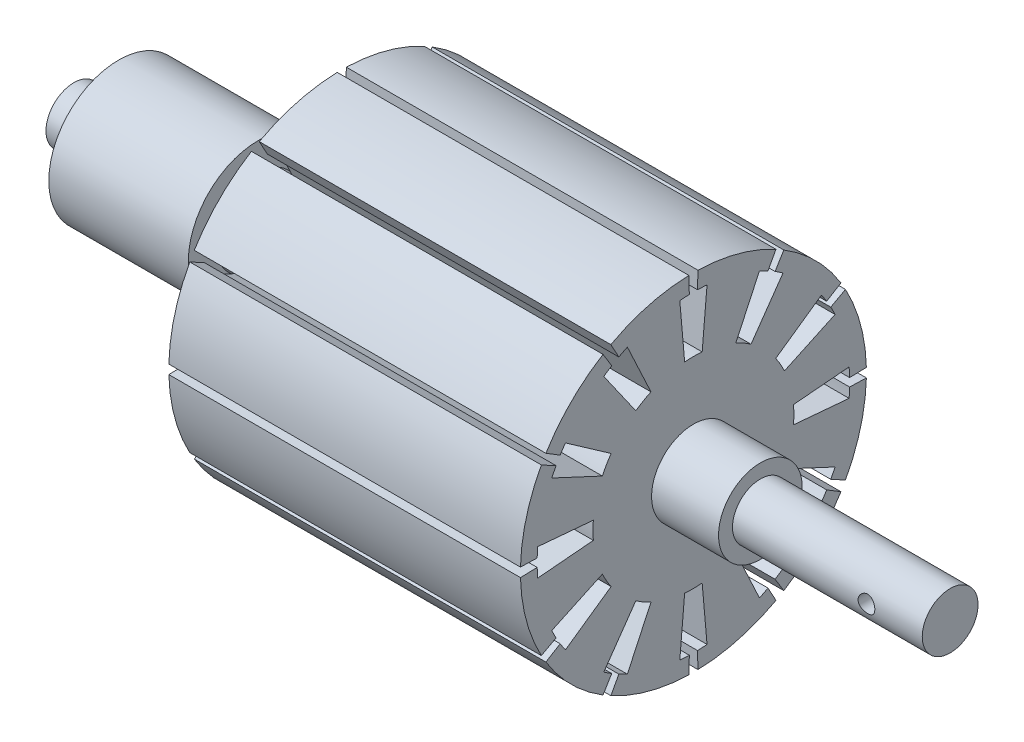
ISO-10303-21;
HEADER;
FILE_DESCRIPTION(('STEP AP214'),'2;1');
FILE_NAME('part.step','',(''),(''),'','','');
FILE_SCHEMA(('AUTOMOTIVE_DESIGN { 1 0 10303 214 1 1 1 1 }'));
ENDSEC;
DATA;
#1=APPLICATION_CONTEXT('core data for automotive mechanical design processes');
#2=APPLICATION_PROTOCOL_DEFINITION('international standard','automotive_design',2000,#1);
#3=PRODUCT_CONTEXT('',#1,'mechanical');
#4=PRODUCT('Part','Part','',(#3));
#5=PRODUCT_RELATED_PRODUCT_CATEGORY('part','',(#4));
#6=PRODUCT_DEFINITION_FORMATION('','',#4);
#7=PRODUCT_DEFINITION_CONTEXT('part definition',#1,'design');
#8=PRODUCT_DEFINITION('design','',#6,#7);
#9=PRODUCT_DEFINITION_SHAPE('','',#8);
#10=(LENGTH_UNIT() NAMED_UNIT(*) SI_UNIT(.MILLI.,.METRE.));
#11=(NAMED_UNIT(*) PLANE_ANGLE_UNIT() SI_UNIT($,.RADIAN.));
#12=(NAMED_UNIT(*) SI_UNIT($,.STERADIAN.) SOLID_ANGLE_UNIT());
#13=UNCERTAINTY_MEASURE_WITH_UNIT(LENGTH_MEASURE(1.E-05),#10,'distance_accuracy_value','');
#14=(GEOMETRIC_REPRESENTATION_CONTEXT(3) GLOBAL_UNCERTAINTY_ASSIGNED_CONTEXT((#13)) GLOBAL_UNIT_ASSIGNED_CONTEXT((#10,
#11,#12)) REPRESENTATION_CONTEXT('',''));
#15=CARTESIAN_POINT('',(0.,0.,0.));
#16=DIRECTION('',(0.,0.,1.));
#17=DIRECTION('',(1.,0.,0.));
#18=AXIS2_PLACEMENT_3D('',#15,#16,#17);
#19=CARTESIAN_POINT('',(-48.,0.,0.));
#20=DIRECTION('',(-1.,0.,0.));
#21=DIRECTION('',(0.,0.,1.));
#22=AXIS2_PLACEMENT_3D('',#19,#20,#21);
#23=CYLINDRICAL_SURFACE('',#22,31.);
#24=CARTESIAN_POINT('',(63.,0.,0.));
#25=DIRECTION('',(-1.,0.,0.));
#26=DIRECTION('',(0.,0.,1.));
#27=AXIS2_PLACEMENT_3D('',#24,#25,#26);
#28=CIRCLE('',#27,31.);
#29=CARTESIAN_POINT('',(63.,16.1974555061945,26.4318450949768));
#30=VERTEX_POINT('',#29);
#31=CARTESIAN_POINT('',(63.,26.4318450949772,16.1974555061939));
#32=VERTEX_POINT('',#31);
#33=EDGE_CURVE('E1787',#30,#32,#28,.T.);
#34=ORIENTED_EDGE('',*,*,#33,.T.);
#35=DIRECTION('',(-1.,0.,0.));
#36=VECTOR('',#35,1.);
#37=CARTESIAN_POINT('',(-48.,26.4318450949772,16.1974555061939));
#38=LINE('',#37,#36);
#39=CARTESIAN_POINT('',(0.,26.4318450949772,16.1974555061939));
#40=VERTEX_POINT('',#39);
#41=EDGE_CURVE('E669',#32,#40,#38,.T.);
#42=ORIENTED_EDGE('',*,*,#41,.T.);
#43=CARTESIAN_POINT('',(0.,0.,0.));
#44=DIRECTION('',(-1.,0.,0.));
#45=DIRECTION('',(0.,0.,1.));
#46=AXIS2_PLACEMENT_3D('',#43,#44,#45);
#47=CIRCLE('',#46,31.);
#48=CARTESIAN_POINT('',(0.,16.1974555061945,26.4318450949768));
#49=VERTEX_POINT('',#48);
#50=EDGE_CURVE('E1853',#49,#40,#47,.T.);
#51=ORIENTED_EDGE('',*,*,#50,.F.);
#52=DIRECTION('',(-1.,0.,0.));
#53=VECTOR('',#52,1.);
#54=CARTESIAN_POINT('',(-48.,16.1974555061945,26.4318450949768));
#55=LINE('',#54,#53);
#56=EDGE_CURVE('E705',#49,#30,#55,.F.);
#57=ORIENTED_EDGE('',*,*,#56,.T.);
#58=EDGE_LOOP('',(#34,#42,#51,#57));
#59=FACE_BOUND('',#58,.T.);
#60=ADVANCED_FACE('F33',(#59),#23,.T.);
#61=CARTESIAN_POINT('',(63.,0.811485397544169,30.9893770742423));
#62=VERTEX_POINT('',#61);
#63=CARTESIAN_POINT('',(63.,14.7919215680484,27.2433304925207));
#64=VERTEX_POINT('',#63);
#65=EDGE_CURVE('E1788',#62,#64,#28,.T.);
#66=ORIENTED_EDGE('',*,*,#65,.T.);
#67=DIRECTION('',(-1.,0.,0.));
#68=VECTOR('',#67,1.);
#69=CARTESIAN_POINT('',(-48.,14.7919215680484,27.2433304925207));
#70=LINE('',#69,#68);
#71=CARTESIAN_POINT('',(0.,14.7919215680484,27.2433304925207));
#72=VERTEX_POINT('',#71);
#73=EDGE_CURVE('E720',#64,#72,#70,.T.);
#74=ORIENTED_EDGE('',*,*,#73,.T.);
#75=CARTESIAN_POINT('',(0.,0.811485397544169,30.9893770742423));
#76=VERTEX_POINT('',#75);
#77=EDGE_CURVE('E1850',#76,#72,#47,.T.);
#78=ORIENTED_EDGE('',*,*,#77,.F.);
#79=DIRECTION('',(-1.,0.,0.));
#80=VECTOR('',#79,1.);
#81=CARTESIAN_POINT('',(-48.,0.811485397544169,30.9893770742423));
#82=LINE('',#81,#80);
#83=EDGE_CURVE('E760',#76,#62,#82,.F.);
#84=ORIENTED_EDGE('',*,*,#83,.T.);
#85=EDGE_LOOP('',(#66,#74,#78,#84));
#86=FACE_BOUND('',#85,.T.);
#87=ADVANCED_FACE('F1729',(#86),#23,.T.);
#88=CARTESIAN_POINT('',(63.,-14.7919215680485,27.2433304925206));
#89=VERTEX_POINT('',#88);
#90=CARTESIAN_POINT('',(63.,-0.811485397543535,30.9893770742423));
#91=VERTEX_POINT('',#90);
#92=EDGE_CURVE('E1791',#89,#91,#28,.T.);
#93=ORIENTED_EDGE('',*,*,#92,.T.);
#94=DIRECTION('',(-1.,0.,0.));
#95=VECTOR('',#94,1.);
#96=CARTESIAN_POINT('',(-48.,-0.811485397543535,30.9893770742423));
#97=LINE('',#96,#95);
#98=CARTESIAN_POINT('',(0.,-0.811485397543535,30.9893770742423));
#99=VERTEX_POINT('',#98);
#100=EDGE_CURVE('E776',#91,#99,#97,.T.);
#101=ORIENTED_EDGE('',*,*,#100,.T.);
#102=CARTESIAN_POINT('',(0.,-14.7919215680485,27.2433304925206));
#103=VERTEX_POINT('',#102);
#104=EDGE_CURVE('E1847',#103,#99,#47,.T.);
#105=ORIENTED_EDGE('',*,*,#104,.F.);
#106=DIRECTION('',(-1.,0.,0.));
#107=VECTOR('',#106,1.);
#108=CARTESIAN_POINT('',(-48.,-14.7919215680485,27.2433304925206));
#109=LINE('',#108,#107);
#110=EDGE_CURVE('E814',#103,#89,#109,.F.);
#111=ORIENTED_EDGE('',*,*,#110,.T.);
#112=EDGE_LOOP('',(#93,#101,#105,#111));
#113=FACE_BOUND('',#112,.T.);
#114=ADVANCED_FACE('F1736',(#113),#23,.T.);
#115=CARTESIAN_POINT('',(63.,-26.4318450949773,16.1974555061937));
#116=VERTEX_POINT('',#115);
#117=CARTESIAN_POINT('',(63.,-16.1974555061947,26.4318450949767));
#118=VERTEX_POINT('',#117);
#119=EDGE_CURVE('E1794',#116,#118,#28,.T.);
#120=ORIENTED_EDGE('',*,*,#119,.T.);
#121=DIRECTION('',(-1.,0.,0.));
#122=VECTOR('',#121,1.);
#123=CARTESIAN_POINT('',(-48.,-16.1974555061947,26.4318450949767));
#124=LINE('',#123,#122);
#125=CARTESIAN_POINT('',(0.,-16.1974555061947,26.4318450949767));
#126=VERTEX_POINT('',#125);
#127=EDGE_CURVE('E832',#118,#126,#124,.T.);
#128=ORIENTED_EDGE('',*,*,#127,.T.);
#129=CARTESIAN_POINT('',(0.,-26.4318450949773,16.1974555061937));
#130=VERTEX_POINT('',#129);
#131=EDGE_CURVE('E1844',#130,#126,#47,.T.);
#132=ORIENTED_EDGE('',*,*,#131,.F.);
#133=DIRECTION('',(-1.,0.,0.));
#134=VECTOR('',#133,1.);
#135=CARTESIAN_POINT('',(-48.,-26.4318450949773,16.1974555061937));
#136=LINE('',#135,#134);
#137=EDGE_CURVE('E872',#130,#116,#136,.F.);
#138=ORIENTED_EDGE('',*,*,#137,.T.);
#139=EDGE_LOOP('',(#120,#128,#132,#138));
#140=FACE_BOUND('',#139,.T.);
#141=ADVANCED_FACE('F1900',(#140),#23,.T.);
#142=CARTESIAN_POINT('',(63.,-30.9893770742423,0.811485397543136));
#143=VERTEX_POINT('',#142);
#144=CARTESIAN_POINT('',(63.,-27.2433304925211,14.7919215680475));
#145=VERTEX_POINT('',#144);
#146=EDGE_CURVE('E1798',#143,#145,#28,.T.);
#147=ORIENTED_EDGE('',*,*,#146,.T.);
#148=DIRECTION('',(-1.,0.,0.));
#149=VECTOR('',#148,1.);
#150=CARTESIAN_POINT('',(-48.,-27.2433304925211,14.7919215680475));
#151=LINE('',#150,#149);
#152=CARTESIAN_POINT('',(0.,-27.2433304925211,14.7919215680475));
#153=VERTEX_POINT('',#152);
#154=EDGE_CURVE('E888',#145,#153,#151,.T.);
#155=ORIENTED_EDGE('',*,*,#154,.T.);
#156=CARTESIAN_POINT('',(0.,-30.9893770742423,0.811485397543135));
#157=VERTEX_POINT('',#156);
#158=EDGE_CURVE('E1841',#157,#153,#47,.T.);
#159=ORIENTED_EDGE('',*,*,#158,.F.);
#160=DIRECTION('',(-1.,0.,0.));
#161=VECTOR('',#160,1.);
#162=CARTESIAN_POINT('',(-48.,-30.9893770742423,0.811485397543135));
#163=LINE('',#162,#161);
#164=EDGE_CURVE('E928',#157,#143,#163,.F.);
#165=ORIENTED_EDGE('',*,*,#164,.T.);
#166=EDGE_LOOP('',(#147,#155,#159,#165));
#167=FACE_BOUND('',#166,.T.);
#168=ADVANCED_FACE('F1904',(#167),#23,.T.);
#169=CARTESIAN_POINT('',(63.,-27.2433304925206,-14.7919215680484));
#170=VERTEX_POINT('',#169);
#171=CARTESIAN_POINT('',(63.,-30.9893770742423,-0.81148539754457));
#172=VERTEX_POINT('',#171);
#173=EDGE_CURVE('E1802',#170,#172,#28,.T.);
#174=ORIENTED_EDGE('',*,*,#173,.T.);
#175=DIRECTION('',(-1.,0.,0.));
#176=VECTOR('',#175,1.);
#177=CARTESIAN_POINT('',(-48.,-30.9893770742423,-0.811485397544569));
#178=LINE('',#177,#176);
#179=CARTESIAN_POINT('',(0.,-30.9893770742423,-0.811485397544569));
#180=VERTEX_POINT('',#179);
#181=EDGE_CURVE('E944',#172,#180,#178,.T.);
#182=ORIENTED_EDGE('',*,*,#181,.T.);
#183=CARTESIAN_POINT('',(0.,-27.2433304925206,-14.7919215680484));
#184=VERTEX_POINT('',#183);
#185=EDGE_CURVE('E1838',#184,#180,#47,.T.);
#186=ORIENTED_EDGE('',*,*,#185,.F.);
#187=DIRECTION('',(-1.,0.,0.));
#188=VECTOR('',#187,1.);
#189=CARTESIAN_POINT('',(-48.,-27.2433304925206,-14.7919215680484));
#190=LINE('',#189,#188);
#191=EDGE_CURVE('E982',#184,#170,#190,.F.);
#192=ORIENTED_EDGE('',*,*,#191,.T.);
#193=EDGE_LOOP('',(#174,#182,#186,#192));
#194=FACE_BOUND('',#193,.T.);
#195=ADVANCED_FACE('F1908',(#194),#23,.T.);
#196=CARTESIAN_POINT('',(63.,-16.1974555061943,-26.4318450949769));
#197=VERTEX_POINT('',#196);
#198=CARTESIAN_POINT('',(63.,-26.4318450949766,-16.1974555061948));
#199=VERTEX_POINT('',#198);
#200=EDGE_CURVE('E1806',#197,#199,#28,.T.);
#201=ORIENTED_EDGE('',*,*,#200,.T.);
#202=DIRECTION('',(-1.,0.,0.));
#203=VECTOR('',#202,1.);
#204=CARTESIAN_POINT('',(-48.,-26.4318450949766,-16.1974555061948));
#205=LINE('',#204,#203);
#206=CARTESIAN_POINT('',(0.,-26.4318450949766,-16.1974555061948));
#207=VERTEX_POINT('',#206);
#208=EDGE_CURVE('E1000',#199,#207,#205,.T.);
#209=ORIENTED_EDGE('',*,*,#208,.T.);
#210=CARTESIAN_POINT('',(0.,-16.1974555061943,-26.4318450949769));
#211=VERTEX_POINT('',#210);
#212=EDGE_CURVE('E1835',#211,#207,#47,.T.);
#213=ORIENTED_EDGE('',*,*,#212,.F.);
#214=DIRECTION('',(-1.,0.,0.));
#215=VECTOR('',#214,1.);
#216=CARTESIAN_POINT('',(-48.,-16.1974555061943,-26.4318450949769));
#217=LINE('',#216,#215);
#218=EDGE_CURVE('E1040',#211,#197,#217,.F.);
#219=ORIENTED_EDGE('',*,*,#218,.T.);
#220=EDGE_LOOP('',(#201,#209,#213,#219));
#221=FACE_BOUND('',#220,.T.);
#222=ADVANCED_FACE('F1912',(#221),#23,.T.);
#223=CARTESIAN_POINT('',(63.,-0.811485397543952,-30.9893770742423));
#224=VERTEX_POINT('',#223);
#225=CARTESIAN_POINT('',(63.,-14.7919215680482,-27.2433304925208));
#226=VERTEX_POINT('',#225);
#227=EDGE_CURVE('E1810',#224,#226,#28,.T.);
#228=ORIENTED_EDGE('',*,*,#227,.T.);
#229=DIRECTION('',(-1.,0.,0.));
#230=VECTOR('',#229,1.);
#231=CARTESIAN_POINT('',(-48.,-14.7919215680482,-27.2433304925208));
#232=LINE('',#231,#230);
#233=CARTESIAN_POINT('',(0.,-14.7919215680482,-27.2433304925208));
#234=VERTEX_POINT('',#233);
#235=EDGE_CURVE('E1056',#226,#234,#232,.T.);
#236=ORIENTED_EDGE('',*,*,#235,.T.);
#237=CARTESIAN_POINT('',(0.,-0.811485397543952,-30.9893770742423));
#238=VERTEX_POINT('',#237);
#239=EDGE_CURVE('E1832',#238,#234,#47,.T.);
#240=ORIENTED_EDGE('',*,*,#239,.F.);
#241=DIRECTION('',(-1.,0.,0.));
#242=VECTOR('',#241,1.);
#243=CARTESIAN_POINT('',(-48.,-0.811485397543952,-30.9893770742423));
#244=LINE('',#243,#242);
#245=EDGE_CURVE('E1096',#238,#224,#244,.F.);
#246=ORIENTED_EDGE('',*,*,#245,.T.);
#247=EDGE_LOOP('',(#228,#236,#240,#246));
#248=FACE_BOUND('',#247,.T.);
#249=ADVANCED_FACE('F1916',(#248),#23,.T.);
#250=CARTESIAN_POINT('',(63.,14.791921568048,-27.2433304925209));
#251=VERTEX_POINT('',#250);
#252=CARTESIAN_POINT('',(63.,0.811485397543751,-30.9893770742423));
#253=VERTEX_POINT('',#252);
#254=EDGE_CURVE('E1814',#251,#253,#28,.T.);
#255=ORIENTED_EDGE('',*,*,#254,.T.);
#256=DIRECTION('',(-1.,0.,0.));
#257=VECTOR('',#256,1.);
#258=CARTESIAN_POINT('',(-48.,0.811485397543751,-30.9893770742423));
#259=LINE('',#258,#257);
#260=CARTESIAN_POINT('',(0.,0.811485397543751,-30.9893770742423));
#261=VERTEX_POINT('',#260);
#262=EDGE_CURVE('E1112',#253,#261,#259,.T.);
#263=ORIENTED_EDGE('',*,*,#262,.T.);
#264=CARTESIAN_POINT('',(0.,14.791921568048,-27.2433304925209));
#265=VERTEX_POINT('',#264);
#266=EDGE_CURVE('E1830',#265,#261,#47,.T.);
#267=ORIENTED_EDGE('',*,*,#266,.F.);
#268=DIRECTION('',(-1.,0.,0.));
#269=VECTOR('',#268,1.);
#270=CARTESIAN_POINT('',(-48.,14.791921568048,-27.2433304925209));
#271=LINE('',#270,#269);
#272=EDGE_CURVE('E1150',#265,#251,#271,.F.);
#273=ORIENTED_EDGE('',*,*,#272,.T.);
#274=EDGE_LOOP('',(#255,#263,#267,#273));
#275=FACE_BOUND('',#274,.T.);
#276=ADVANCED_FACE('F1762',(#275),#23,.T.);
#277=CARTESIAN_POINT('',(63.,26.431845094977,-16.1974555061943));
#278=VERTEX_POINT('',#277);
#279=CARTESIAN_POINT('',(63.,16.1974555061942,-26.431845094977));
#280=VERTEX_POINT('',#279);
#281=EDGE_CURVE('E1318',#278,#280,#28,.T.);
#282=ORIENTED_EDGE('',*,*,#281,.T.);
#283=DIRECTION('',(-1.,0.,0.));
#284=VECTOR('',#283,1.);
#285=CARTESIAN_POINT('',(-48.,16.1974555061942,-26.431845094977));
#286=LINE('',#285,#284);
#287=CARTESIAN_POINT('',(0.,16.1974555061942,-26.431845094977));
#288=VERTEX_POINT('',#287);
#289=EDGE_CURVE('E1168',#280,#288,#286,.T.);
#290=ORIENTED_EDGE('',*,*,#289,.T.);
#291=CARTESIAN_POINT('',(0.,26.431845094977,-16.1974555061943));
#292=VERTEX_POINT('',#291);
#293=EDGE_CURVE('E1323',#292,#288,#47,.T.);
#294=ORIENTED_EDGE('',*,*,#293,.F.);
#295=DIRECTION('',(-1.,0.,0.));
#296=VECTOR('',#295,1.);
#297=CARTESIAN_POINT('',(-48.,26.431845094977,-16.1974555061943));
#298=LINE('',#297,#296);
#299=EDGE_CURVE('E1208',#292,#278,#298,.F.);
#300=ORIENTED_EDGE('',*,*,#299,.T.);
#301=EDGE_LOOP('',(#282,#290,#294,#300));
#302=FACE_BOUND('',#301,.T.);
#303=ADVANCED_FACE('F1754',(#302),#23,.T.);
#304=CARTESIAN_POINT('',(63.,30.9893770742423,-0.811485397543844));
#305=VERTEX_POINT('',#304);
#306=CARTESIAN_POINT('',(63.,27.2433304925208,-14.7919215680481));
#307=VERTEX_POINT('',#306);
#308=EDGE_CURVE('E1314',#305,#307,#28,.T.);
#309=ORIENTED_EDGE('',*,*,#308,.T.);
#310=DIRECTION('',(-1.,0.,0.));
#311=VECTOR('',#310,1.);
#312=CARTESIAN_POINT('',(-48.,27.2433304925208,-14.7919215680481));
#313=LINE('',#312,#311);
#314=CARTESIAN_POINT('',(0.,27.2433304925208,-14.7919215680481));
#315=VERTEX_POINT('',#314);
#316=EDGE_CURVE('E1224',#307,#315,#313,.T.);
#317=ORIENTED_EDGE('',*,*,#316,.T.);
#318=CARTESIAN_POINT('',(0.,30.9893770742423,-0.811485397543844));
#319=VERTEX_POINT('',#318);
#320=EDGE_CURVE('E1319',#319,#315,#47,.T.);
#321=ORIENTED_EDGE('',*,*,#320,.F.);
#322=DIRECTION('',(-1.,0.,0.));
#323=VECTOR('',#322,1.);
#324=CARTESIAN_POINT('',(-48.,30.9893770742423,-0.811485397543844));
#325=LINE('',#324,#323);
#326=EDGE_CURVE('E1264',#319,#305,#325,.F.);
#327=ORIENTED_EDGE('',*,*,#326,.T.);
#328=EDGE_LOOP('',(#309,#317,#321,#327));
#329=FACE_BOUND('',#328,.T.);
#330=ADVANCED_FACE('F1744',(#329),#23,.T.);
#331=CARTESIAN_POINT('',(-48.,0.,0.));
#332=DIRECTION('',(1.,0.,0.));
#333=DIRECTION('',(0.,0.,-1.));
#334=AXIS2_PLACEMENT_3D('',#331,#332,#333);
#335=PLANE('',#334);
#336=CARTESIAN_POINT('',(-48.,0.,0.));
#337=DIRECTION('',(-1.,0.,0.));
#338=DIRECTION('',(0.,0.,1.));
#339=AXIS2_PLACEMENT_3D('',#336,#337,#338);
#340=CIRCLE('',#339,5.);
#341=CARTESIAN_POINT('',(-48.,0.,5.));
#342=VERTEX_POINT('',#341);
#343=EDGE_CURVE('E1338',#342,#342,#340,.T.);
#344=ORIENTED_EDGE('',*,*,#343,.T.);
#345=EDGE_LOOP('',(#344));
#346=FACE_BOUND('',#345,.T.);
#347=ADVANCED_FACE('F35',(#346),#335,.F.);
#348=CARTESIAN_POINT('',(-48.,0.,0.));
#349=DIRECTION('',(-1.,0.,0.));
#350=DIRECTION('',(0.,0.,1.));
#351=AXIS2_PLACEMENT_3D('',#348,#349,#350);
#352=CYLINDRICAL_SURFACE('',#351,5.);
#353=ORIENTED_EDGE('',*,*,#343,.F.);
#354=EDGE_LOOP('',(#353));
#355=FACE_BOUND('',#354,.T.);
#356=CARTESIAN_POINT('',(-40.,0.,0.));
#357=DIRECTION('',(-1.,0.,0.));
#358=DIRECTION('',(0.,0.,1.));
#359=AXIS2_PLACEMENT_3D('',#356,#357,#358);
#360=CIRCLE('',#359,5.);
#361=CARTESIAN_POINT('',(-40.,0.,5.));
#362=VERTEX_POINT('',#361);
#363=EDGE_CURVE('E1335',#362,#362,#360,.T.);
#364=ORIENTED_EDGE('',*,*,#363,.T.);
#365=EDGE_LOOP('',(#364));
#366=FACE_BOUND('',#365,.T.);
#367=ADVANCED_FACE('F1760',(#355,#366),#352,.T.);
#368=CARTESIAN_POINT('',(-40.,5.,0.));
#369=DIRECTION('',(1.,0.,0.));
#370=DIRECTION('',(0.,0.,-1.));
#371=AXIS2_PLACEMENT_3D('',#368,#369,#370);
#372=PLANE('',#371);
#373=ORIENTED_EDGE('',*,*,#363,.F.);
#374=EDGE_LOOP('',(#373));
#375=FACE_BOUND('',#374,.T.);
#376=CARTESIAN_POINT('',(-40.,0.,0.));
#377=DIRECTION('',(-1.,0.,0.));
#378=DIRECTION('',(0.,0.,1.));
#379=AXIS2_PLACEMENT_3D('',#376,#377,#378);
#380=CIRCLE('',#379,12.5);
#381=CARTESIAN_POINT('',(-40.,0.,12.5));
#382=VERTEX_POINT('',#381);
#383=EDGE_CURVE('E1332',#382,#382,#380,.T.);
#384=ORIENTED_EDGE('',*,*,#383,.T.);
#385=EDGE_LOOP('',(#384));
#386=FACE_BOUND('',#385,.T.);
#387=ADVANCED_FACE('F1954',(#375,#386),#372,.F.);
#388=CARTESIAN_POINT('',(-48.,0.,0.));
#389=DIRECTION('',(-1.,0.,0.));
#390=DIRECTION('',(0.,0.,1.));
#391=AXIS2_PLACEMENT_3D('',#388,#389,#390);
#392=CYLINDRICAL_SURFACE('',#391,12.5);
#393=ORIENTED_EDGE('',*,*,#383,.F.);
#394=EDGE_LOOP('',(#393));
#395=FACE_BOUND('',#394,.T.);
#396=CARTESIAN_POINT('',(-15.,0.,0.));
#397=DIRECTION('',(-1.,0.,0.));
#398=DIRECTION('',(0.,0.,1.));
#399=AXIS2_PLACEMENT_3D('',#396,#397,#398);
#400=CIRCLE('',#399,12.5);
#401=CARTESIAN_POINT('',(-15.,0.,12.5));
#402=VERTEX_POINT('',#401);
#403=EDGE_CURVE('E1329',#402,#402,#400,.T.);
#404=ORIENTED_EDGE('',*,*,#403,.T.);
#405=EDGE_LOOP('',(#404));
#406=FACE_BOUND('',#405,.T.);
#407=ADVANCED_FACE('F1963',(#395,#406),#392,.T.);
#408=CARTESIAN_POINT('',(-15.,12.5,0.));
#409=DIRECTION('',(-1.,0.,0.));
#410=DIRECTION('',(0.,0.,1.));
#411=AXIS2_PLACEMENT_3D('',#408,#409,#410);
#412=PLANE('',#411);
#413=ORIENTED_EDGE('',*,*,#403,.F.);
#414=EDGE_LOOP('',(#413));
#415=FACE_BOUND('',#414,.T.);
#416=CARTESIAN_POINT('',(-15.,0.,0.));
#417=DIRECTION('',(-1.,0.,0.));
#418=DIRECTION('',(0.,0.,1.));
#419=AXIS2_PLACEMENT_3D('',#416,#417,#418);
#420=CIRCLE('',#419,7.5);
#421=CARTESIAN_POINT('',(-15.,0.,7.5));
#422=VERTEX_POINT('',#421);
#423=EDGE_CURVE('E1326',#422,#422,#420,.T.);
#424=ORIENTED_EDGE('',*,*,#423,.T.);
#425=EDGE_LOOP('',(#424));
#426=FACE_BOUND('',#425,.T.);
#427=ADVANCED_FACE('F1973',(#415,#426),#412,.F.);
#428=CARTESIAN_POINT('',(-48.,0.,0.));
#429=DIRECTION('',(-1.,0.,0.));
#430=DIRECTION('',(0.,0.,1.));
#431=AXIS2_PLACEMENT_3D('',#428,#429,#430);
#432=CYLINDRICAL_SURFACE('',#431,7.5);
#433=ORIENTED_EDGE('',*,*,#423,.F.);
#434=EDGE_LOOP('',(#433));
#435=FACE_BOUND('',#434,.T.);
#436=CARTESIAN_POINT('',(0.,0.,0.));
#437=DIRECTION('',(-1.,0.,0.));
#438=DIRECTION('',(0.,0.,1.));
#439=AXIS2_PLACEMENT_3D('',#436,#437,#438);
#440=CIRCLE('',#439,7.5);
#441=CARTESIAN_POINT('',(0.,0.,7.5));
#442=VERTEX_POINT('',#441);
#443=EDGE_CURVE('E1322',#442,#442,#440,.T.);
#444=ORIENTED_EDGE('',*,*,#443,.T.);
#445=EDGE_LOOP('',(#444));
#446=FACE_BOUND('',#445,.T.);
#447=ADVANCED_FACE('F1750',(#435,#446),#432,.T.);
#448=CARTESIAN_POINT('',(0.,7.5,0.));
#449=DIRECTION('',(1.,0.,0.));
#450=DIRECTION('',(0.,0.,-1.));
#451=AXIS2_PLACEMENT_3D('',#448,#449,#450);
#452=PLANE('',#451);
#453=ORIENTED_EDGE('',*,*,#443,.F.);
#454=EDGE_LOOP('',(#453));
#455=FACE_BOUND('',#454,.T.);
#456=ORIENTED_EDGE('',*,*,#50,.T.);
#457=DIRECTION('',(0.,-0.852640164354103,-0.522498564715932));
#458=VECTOR('',#457,1.);
#459=CARTESIAN_POINT('',(0.,5.45246437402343,3.34127446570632));
#460=LINE('',#459,#458);
#461=CARTESIAN_POINT('',(0.,23.8739246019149,14.6299598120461));
#462=VERTEX_POINT('',#461);
#463=EDGE_CURVE('E672',#40,#462,#460,.T.);
#464=ORIENTED_EDGE('',*,*,#463,.T.);
#465=CARTESIAN_POINT('',(0.,0.,0.));
#466=DIRECTION('',(1.,0.,0.));
#467=DIRECTION('',(0.,0.,-1.));
#468=AXIS2_PLACEMENT_3D('',#465,#466,#467);
#469=CIRCLE('',#468,28.);
#470=CARTESIAN_POINT('',(0.,22.9362572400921,16.0601402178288));
#471=VERTEX_POINT('',#470);
#472=EDGE_CURVE('E675',#462,#471,#469,.T.);
#473=ORIENTED_EDGE('',*,*,#472,.T.);
#474=DIRECTION('',(0.,-0.819152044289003,-0.57357643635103));
#475=VECTOR('',#474,1.);
#476=CARTESIAN_POINT('',(0.,5.03257553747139,3.52384732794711));
#477=LINE('',#476,#475);
#478=CARTESIAN_POINT('',(0.,14.7447367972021,10.3243758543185));
#479=VERTEX_POINT('',#478);
#480=EDGE_CURVE('E678',#471,#479,#477,.T.);
#481=ORIENTED_EDGE('',*,*,#480,.T.);
#482=CARTESIAN_POINT('',(0.,0.,0.));
#483=DIRECTION('',(1.,0.,0.));
#484=DIRECTION('',(0.,0.,-1.));
#485=AXIS2_PLACEMENT_3D('',#482,#483,#484);
#486=CIRCLE('',#485,18.);
#487=CARTESIAN_POINT('',(0.,16.3135401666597,7.60712871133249));
#488=VERTEX_POINT('',#487);
#489=EDGE_CURVE('E681',#479,#488,#486,.F.);
#490=ORIENTED_EDGE('',*,*,#489,.T.);
#491=DIRECTION('',(0.,0.906307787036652,0.422618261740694));
#492=VECTOR('',#491,1.);
#493=CARTESIAN_POINT('',(0.,6.16045353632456,2.87266666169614));
#494=LINE('',#493,#492);
#495=CARTESIAN_POINT('',(0.,25.3766180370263,11.8333113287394));
#496=VERTEX_POINT('',#495);
#497=EDGE_CURVE('E684',#488,#496,#494,.T.);
#498=ORIENTED_EDGE('',*,*,#497,.T.);
#499=CARTESIAN_POINT('',(0.,0.,0.));
#500=DIRECTION('',(1.,0.,0.));
#501=DIRECTION('',(0.,0.,-1.));
#502=AXIS2_PLACEMENT_3D('',#499,#500,#501);
#503=CIRCLE('',#502,28.);
#504=CARTESIAN_POINT('',(0.,24.6068791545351,13.3604452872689));
#505=VERTEX_POINT('',#504);
#506=EDGE_CURVE('E634',#496,#505,#503,.T.);
#507=ORIENTED_EDGE('',*,*,#506,.T.);
#508=DIRECTION('',(0.,0.878817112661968,0.477158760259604));
#509=VECTOR('',#508,1.);
#510=CARTESIAN_POINT('',(0.,5.79239638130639,3.14501462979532));
#511=LINE('',#510,#509);
#512=CARTESIAN_POINT('',(0.,27.243330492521,14.7919215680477));
#513=VERTEX_POINT('',#512);
#514=EDGE_CURVE('E666',#505,#513,#511,.T.);
#515=ORIENTED_EDGE('',*,*,#514,.T.);
#516=CARTESIAN_POINT('',(0.,30.9893770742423,0.81148539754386));
#517=VERTEX_POINT('',#516);
#518=EDGE_CURVE('E1317',#513,#517,#47,.T.);
#519=ORIENTED_EDGE('',*,*,#518,.T.);
#520=DIRECTION('',(0.,-0.999657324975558,-0.0261769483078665));
#521=VECTOR('',#520,1.);
#522=CARTESIAN_POINT('',(0.,7.49486075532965,0.196259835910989));
#523=LINE('',#522,#521);
#524=CARTESIAN_POINT('',(0.,27.9904050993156,0.73295455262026));
#525=VERTEX_POINT('',#524);
#526=EDGE_CURVE('E1283',#517,#525,#523,.T.);
#527=ORIENTED_EDGE('',*,*,#526,.T.);
#528=CARTESIAN_POINT('',(0.,0.,0.));
#529=DIRECTION('',(1.,0.,0.));
#530=DIRECTION('',(0.,0.,-1.));
#531=AXIS2_PLACEMENT_3D('',#528,#529,#530);
#532=CIRCLE('',#531,28.);
#533=CARTESIAN_POINT('',(0.,27.8934515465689,2.44036079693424));
#534=VERTEX_POINT('',#533);
#535=EDGE_CURVE('E1286',#525,#534,#532,.T.);
#536=ORIENTED_EDGE('',*,*,#535,.T.);
#537=DIRECTION('',(0.,-0.996194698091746,-0.0871557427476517));
#538=VECTOR('',#537,1.);
#539=CARTESIAN_POINT('',(0.,7.44302907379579,0.65118066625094));
#540=LINE('',#539,#538);
#541=CARTESIAN_POINT('',(0.,17.9315045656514,1.56880336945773));
#542=VERTEX_POINT('',#541);
#543=EDGE_CURVE('E1289',#534,#542,#540,.T.);
#544=ORIENTED_EDGE('',*,*,#543,.T.);
#545=CARTESIAN_POINT('',(0.,0.,0.));
#546=DIRECTION('',(1.,0.,0.));
#547=DIRECTION('',(0.,0.,-1.));
#548=AXIS2_PLACEMENT_3D('',#545,#546,#547);
#549=CIRCLE('',#548,18.);
#550=CARTESIAN_POINT('',(0.,17.9315045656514,-1.56880336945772));
#551=VERTEX_POINT('',#550);
#552=EDGE_CURVE('E1292',#542,#551,#549,.F.);
#553=ORIENTED_EDGE('',*,*,#552,.T.);
#554=DIRECTION('',(0.,0.996194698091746,-0.0871557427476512));
#555=VECTOR('',#554,1.);
#556=CARTESIAN_POINT('',(0.,7.44302907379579,-0.651180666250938));
#557=LINE('',#556,#555);
#558=CARTESIAN_POINT('',(0.,27.8934515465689,-2.44036079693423));
#559=VERTEX_POINT('',#558);
#560=EDGE_CURVE('E1295',#551,#559,#557,.T.);
#561=ORIENTED_EDGE('',*,*,#560,.T.);
#562=CARTESIAN_POINT('',(0.,0.,0.));
#563=DIRECTION('',(1.,0.,0.));
#564=DIRECTION('',(0.,0.,-1.));
#565=AXIS2_PLACEMENT_3D('',#562,#563,#564);
#566=CIRCLE('',#565,28.);
#567=CARTESIAN_POINT('',(0.,27.9904050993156,-0.732954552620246));
#568=VERTEX_POINT('',#567);
#569=EDGE_CURVE('E1298',#559,#568,#566,.T.);
#570=ORIENTED_EDGE('',*,*,#569,.T.);
#571=DIRECTION('',(0.,0.999657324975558,-0.026176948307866));
#572=VECTOR('',#571,1.);
#573=CARTESIAN_POINT('',(0.,7.49486075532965,-0.196259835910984));
#574=LINE('',#573,#572);
#575=EDGE_CURVE('E1277',#568,#319,#574,.T.);
#576=ORIENTED_EDGE('',*,*,#575,.T.);
#577=ORIENTED_EDGE('',*,*,#320,.T.);
#578=DIRECTION('',(0.,-0.878817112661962,0.477158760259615));
#579=VECTOR('',#578,1.);
#580=CARTESIAN_POINT('',(0.,5.7923963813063,-3.14501462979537));
#581=LINE('',#580,#579);
#582=CARTESIAN_POINT('',(0.,24.6068791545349,-13.3604452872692));
#583=VERTEX_POINT('',#582);
#584=EDGE_CURVE('E1227',#315,#583,#581,.T.);
#585=ORIENTED_EDGE('',*,*,#584,.T.);
#586=CARTESIAN_POINT('',(0.,0.,0.));
#587=DIRECTION('',(1.,0.,0.));
#588=DIRECTION('',(0.,0.,-1.));
#589=AXIS2_PLACEMENT_3D('',#586,#587,#588);
#590=CIRCLE('',#589,28.);
#591=CARTESIAN_POINT('',(0.,25.3766180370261,-11.8333113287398));
#592=VERTEX_POINT('',#591);
#593=EDGE_CURVE('E1230',#583,#592,#590,.T.);
#594=ORIENTED_EDGE('',*,*,#593,.T.);
#595=DIRECTION('',(0.,-0.906307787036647,0.422618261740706));
#596=VECTOR('',#595,1.);
#597=CARTESIAN_POINT('',(0.,6.16045353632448,-2.87266666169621));
#598=LINE('',#597,#596);
#599=CARTESIAN_POINT('',(0.,16.3135401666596,-7.60712871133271));
#600=VERTEX_POINT('',#599);
#601=EDGE_CURVE('E1233',#592,#600,#598,.T.);
#602=ORIENTED_EDGE('',*,*,#601,.T.);
#603=CARTESIAN_POINT('',(0.,0.,0.));
#604=DIRECTION('',(1.,0.,0.));
#605=DIRECTION('',(0.,0.,-1.));
#606=AXIS2_PLACEMENT_3D('',#603,#604,#605);
#607=CIRCLE('',#606,18.);
#608=CARTESIAN_POINT('',(0.,14.7447367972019,-10.3243758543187));
#609=VERTEX_POINT('',#608);
#610=EDGE_CURVE('E1236',#600,#609,#607,.F.);
#611=ORIENTED_EDGE('',*,*,#610,.T.);
#612=DIRECTION('',(0.,0.819152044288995,-0.573576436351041));
#613=VECTOR('',#612,1.);
#614=CARTESIAN_POINT('',(0.,5.0325755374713,-3.52384732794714));
#615=LINE('',#614,#613);
#616=CARTESIAN_POINT('',(0.,22.9362572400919,-16.0601402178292));
#617=VERTEX_POINT('',#616);
#618=EDGE_CURVE('E1239',#609,#617,#615,.T.);
#619=ORIENTED_EDGE('',*,*,#618,.T.);
#620=CARTESIAN_POINT('',(0.,0.,0.));
#621=DIRECTION('',(1.,0.,0.));
#622=DIRECTION('',(0.,0.,-1.));
#623=AXIS2_PLACEMENT_3D('',#620,#621,#622);
#624=CIRCLE('',#623,28.);
#625=CARTESIAN_POINT('',(0.,23.8739246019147,-14.6299598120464));
#626=VERTEX_POINT('',#625);
#627=EDGE_CURVE('E1242',#617,#626,#624,.T.);
#628=ORIENTED_EDGE('',*,*,#627,.T.);
#629=DIRECTION('',(0.,0.852640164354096,-0.522498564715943));
#630=VECTOR('',#629,1.);
#631=CARTESIAN_POINT('',(0.,5.45246437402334,-3.34127446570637));
#632=LINE('',#631,#630);
#633=EDGE_CURVE('E1221',#626,#292,#632,.T.);
#634=ORIENTED_EDGE('',*,*,#633,.T.);
#635=ORIENTED_EDGE('',*,*,#293,.T.);
#636=DIRECTION('',(0.,-0.522498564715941,0.852640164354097));
#637=VECTOR('',#636,1.);
#638=CARTESIAN_POINT('',(0.,2.04753562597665,-3.34127446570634));
#639=LINE('',#638,#637);
#640=CARTESIAN_POINT('',(0.,14.6299598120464,-23.8739246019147));
#641=VERTEX_POINT('',#640);
#642=EDGE_CURVE('E1171',#288,#641,#639,.T.);
#643=ORIENTED_EDGE('',*,*,#642,.T.);
#644=CARTESIAN_POINT('',(0.,0.,0.));
#645=DIRECTION('',(1.,0.,0.));
#646=DIRECTION('',(0.,0.,-1.));
#647=AXIS2_PLACEMENT_3D('',#644,#645,#646);
#648=CIRCLE('',#647,28.);
#649=CARTESIAN_POINT('',(0.,16.0601402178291,-22.9362572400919));
#650=VERTEX_POINT('',#649);
#651=EDGE_CURVE('E1174',#641,#650,#648,.T.);
#652=ORIENTED_EDGE('',*,*,#651,.T.);
#653=DIRECTION('',(0.,-0.573576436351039,0.819152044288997));
#654=VECTOR('',#653,1.);
#655=CARTESIAN_POINT('',(0.,2.46742446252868,-3.52384732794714));
#656=LINE('',#655,#654);
#657=CARTESIAN_POINT('',(0.,10.3243758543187,-14.7447367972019));
#658=VERTEX_POINT('',#657);
#659=EDGE_CURVE('E1177',#650,#658,#656,.T.);
#660=ORIENTED_EDGE('',*,*,#659,.T.);
#661=CARTESIAN_POINT('',(0.,0.,0.));
#662=DIRECTION('',(1.,0.,0.));
#663=DIRECTION('',(0.,0.,-1.));
#664=AXIS2_PLACEMENT_3D('',#661,#662,#663);
#665=CIRCLE('',#664,18.);
#666=CARTESIAN_POINT('',(0.,7.60712871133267,-16.3135401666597));
#667=VERTEX_POINT('',#666);
#668=EDGE_CURVE('E1180',#658,#667,#665,.F.);
#669=ORIENTED_EDGE('',*,*,#668,.T.);
#670=DIRECTION('',(0.,0.422618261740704,-0.906307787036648));
#671=VECTOR('',#670,1.);
#672=CARTESIAN_POINT('',(0.,1.3395464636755,-2.87266666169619));
#673=LINE('',#672,#671);
#674=CARTESIAN_POINT('',(0.,11.8333113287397,-25.3766180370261));
#675=VERTEX_POINT('',#674);
#676=EDGE_CURVE('E1183',#667,#675,#673,.T.);
#677=ORIENTED_EDGE('',*,*,#676,.T.);
#678=CARTESIAN_POINT('',(0.,0.,0.));
#679=DIRECTION('',(1.,0.,0.));
#680=DIRECTION('',(0.,0.,-1.));
#681=AXIS2_PLACEMENT_3D('',#678,#679,#680);
#682=CIRCLE('',#681,28.);
#683=CARTESIAN_POINT('',(0.,13.3604452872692,-24.606879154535));
#684=VERTEX_POINT('',#683);
#685=EDGE_CURVE('E1186',#675,#684,#682,.T.);
#686=ORIENTED_EDGE('',*,*,#685,.T.);
#687=DIRECTION('',(0.,0.477158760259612,-0.878817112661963));
#688=VECTOR('',#687,1.);
#689=CARTESIAN_POINT('',(0.,1.70760361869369,-3.14501462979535));
#690=LINE('',#689,#688);
#691=EDGE_CURVE('E1165',#684,#265,#690,.T.);
#692=ORIENTED_EDGE('',*,*,#691,.T.);
#693=ORIENTED_EDGE('',*,*,#266,.T.);
#694=DIRECTION('',(0.,-0.026176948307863,0.999657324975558));
#695=VECTOR('',#694,1.);
#696=CARTESIAN_POINT('',(0.,0.00513924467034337,-0.196259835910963));
#697=LINE('',#696,#695);
#698=CARTESIAN_POINT('',(0.,0.732954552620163,-27.9904050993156));
#699=VERTEX_POINT('',#698);
#700=EDGE_CURVE('E1115',#261,#699,#697,.T.);
#701=ORIENTED_EDGE('',*,*,#700,.T.);
#702=CARTESIAN_POINT('',(0.,0.,0.));
#703=DIRECTION('',(1.,0.,0.));
#704=DIRECTION('',(0.,0.,-1.));
#705=AXIS2_PLACEMENT_3D('',#702,#703,#704);
#706=CIRCLE('',#705,28.);
#707=CARTESIAN_POINT('',(0.,2.44036079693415,-27.8934515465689));
#708=VERTEX_POINT('',#707);
#709=EDGE_CURVE('E1118',#699,#708,#706,.T.);
#710=ORIENTED_EDGE('',*,*,#709,.T.);
#711=DIRECTION('',(0.,-0.0871557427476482,0.996194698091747));
#712=VECTOR('',#711,1.);
#713=CARTESIAN_POINT('',(0.,0.0569709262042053,-0.651180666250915));
#714=LINE('',#713,#712);
#715=CARTESIAN_POINT('',(0.,1.56880336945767,-17.9315045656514));
#716=VERTEX_POINT('',#715);
#717=EDGE_CURVE('E1121',#708,#716,#714,.T.);
#718=ORIENTED_EDGE('',*,*,#717,.T.);
#719=CARTESIAN_POINT('',(0.,0.,0.));
#720=DIRECTION('',(1.,0.,0.));
#721=DIRECTION('',(0.,0.,-1.));
#722=AXIS2_PLACEMENT_3D('',#719,#720,#721);
#723=CIRCLE('',#722,18.);
#724=CARTESIAN_POINT('',(0.,-1.56880336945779,-17.9315045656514));
#725=VERTEX_POINT('',#724);
#726=EDGE_CURVE('E1124',#716,#725,#723,.F.);
#727=ORIENTED_EDGE('',*,*,#726,.T.);
#728=DIRECTION('',(0.,-0.0871557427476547,-0.996194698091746));
#729=VECTOR('',#728,1.);
#730=CARTESIAN_POINT('',(0.,0.056970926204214,0.651180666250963));
#731=LINE('',#730,#729);
#732=CARTESIAN_POINT('',(0.,-2.44036079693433,-27.8934515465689));
#733=VERTEX_POINT('',#732);
#734=EDGE_CURVE('E1127',#725,#733,#731,.T.);
#735=ORIENTED_EDGE('',*,*,#734,.T.);
#736=CARTESIAN_POINT('',(0.,0.,0.));
#737=DIRECTION('',(1.,0.,0.));
#738=DIRECTION('',(0.,0.,-1.));
#739=AXIS2_PLACEMENT_3D('',#736,#737,#738);
#740=CIRCLE('',#739,28.);
#741=CARTESIAN_POINT('',(0.,-0.732954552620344,-27.9904050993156));
#742=VERTEX_POINT('',#741);
#743=EDGE_CURVE('E1130',#733,#742,#740,.T.);
#744=ORIENTED_EDGE('',*,*,#743,.T.);
#745=DIRECTION('',(0.,-0.0261769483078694,-0.999657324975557));
#746=VECTOR('',#745,1.);
#747=CARTESIAN_POINT('',(0.,0.00513924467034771,0.196259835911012));
#748=LINE('',#747,#746);
#749=EDGE_CURVE('E1109',#742,#238,#748,.T.);
#750=ORIENTED_EDGE('',*,*,#749,.T.);
#751=ORIENTED_EDGE('',*,*,#239,.T.);
#752=DIRECTION('',(0.,0.477158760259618,0.87881711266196));
#753=VECTOR('',#752,1.);
#754=CARTESIAN_POINT('',(0.,1.70760361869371,3.14501462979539));
#755=LINE('',#754,#753);
#756=CARTESIAN_POINT('',(0.,-13.3604452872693,-24.6068791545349));
#757=VERTEX_POINT('',#756);
#758=EDGE_CURVE('E1059',#234,#757,#755,.T.);
#759=ORIENTED_EDGE('',*,*,#758,.T.);
#760=CARTESIAN_POINT('',(0.,0.,0.));
#761=DIRECTION('',(1.,0.,0.));
#762=DIRECTION('',(0.,0.,-1.));
#763=AXIS2_PLACEMENT_3D('',#760,#761,#762);
#764=CIRCLE('',#763,28.);
#765=CARTESIAN_POINT('',(0.,-11.8333113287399,-25.3766180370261));
#766=VERTEX_POINT('',#765);
#767=EDGE_CURVE('E1062',#757,#766,#764,.T.);
#768=ORIENTED_EDGE('',*,*,#767,.T.);
#769=DIRECTION('',(0.,0.42261826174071,0.906307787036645));
#770=VECTOR('',#769,1.);
#771=CARTESIAN_POINT('',(0.,1.33954646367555,2.87266666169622));
#772=LINE('',#771,#770);
#773=CARTESIAN_POINT('',(0.,-7.60712871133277,-16.3135401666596));
#774=VERTEX_POINT('',#773);
#775=EDGE_CURVE('E1065',#766,#774,#772,.T.);
#776=ORIENTED_EDGE('',*,*,#775,.T.);
#777=CARTESIAN_POINT('',(0.,0.,0.));
#778=DIRECTION('',(1.,0.,0.));
#779=DIRECTION('',(0.,0.,-1.));
#780=AXIS2_PLACEMENT_3D('',#777,#778,#779);
#781=CIRCLE('',#780,18.);
#782=CARTESIAN_POINT('',(0.,-10.3243758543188,-14.7447367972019));
#783=VERTEX_POINT('',#782);
#784=EDGE_CURVE('E1068',#774,#783,#781,.F.);
#785=ORIENTED_EDGE('',*,*,#784,.T.);
#786=DIRECTION('',(0.,-0.573576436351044,-0.819152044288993));
#787=VECTOR('',#786,1.);
#788=CARTESIAN_POINT('',(0.,2.46742446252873,3.52384732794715));
#789=LINE('',#788,#787);
#790=CARTESIAN_POINT('',(0.,-16.0601402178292,-22.9362572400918));
#791=VERTEX_POINT('',#790);
#792=EDGE_CURVE('E1071',#783,#791,#789,.T.);
#793=ORIENTED_EDGE('',*,*,#792,.T.);
#794=CARTESIAN_POINT('',(0.,0.,0.));
#795=DIRECTION('',(1.,0.,0.));
#796=DIRECTION('',(0.,0.,-1.));
#797=AXIS2_PLACEMENT_3D('',#794,#795,#796);
#798=CIRCLE('',#797,28.);
#799=CARTESIAN_POINT('',(0.,-14.6299598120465,-23.8739246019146));
#800=VERTEX_POINT('',#799);
#801=EDGE_CURVE('E1074',#791,#800,#798,.T.);
#802=ORIENTED_EDGE('',*,*,#801,.T.);
#803=DIRECTION('',(0.,-0.522498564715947,-0.852640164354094));
#804=VECTOR('',#803,1.);
#805=CARTESIAN_POINT('',(0.,2.04753562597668,3.34127446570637));
#806=LINE('',#805,#804);
#807=EDGE_CURVE('E1053',#800,#211,#806,.T.);
#808=ORIENTED_EDGE('',*,*,#807,.T.);
#809=ORIENTED_EDGE('',*,*,#212,.T.);
#810=DIRECTION('',(0.,0.852640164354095,0.522498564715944));
#811=VECTOR('',#810,1.);
#812=CARTESIAN_POINT('',(0.,5.45246437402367,3.34127446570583));
#813=LINE('',#812,#811);
#814=CARTESIAN_POINT('',(0.,-23.8739246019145,-14.6299598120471));
#815=VERTEX_POINT('',#814);
#816=EDGE_CURVE('E1003',#207,#815,#813,.T.);
#817=ORIENTED_EDGE('',*,*,#816,.T.);
#818=CARTESIAN_POINT('',(0.,0.,0.));
#819=DIRECTION('',(1.,0.,0.));
#820=DIRECTION('',(0.,0.,-1.));
#821=AXIS2_PLACEMENT_3D('',#818,#819,#820);
#822=CIRCLE('',#821,28.0000000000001);
#823=CARTESIAN_POINT('',(0.,-22.936257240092,-16.0601402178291));
#824=VERTEX_POINT('',#823);
#825=EDGE_CURVE('E1006',#815,#824,#822,.T.);
#826=ORIENTED_EDGE('',*,*,#825,.T.);
#827=DIRECTION('',(0.,0.819152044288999,0.573576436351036));
#828=VECTOR('',#827,1.);
#829=CARTESIAN_POINT('',(0.,5.03257553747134,3.52384732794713));
#830=LINE('',#829,#828);
#831=CARTESIAN_POINT('',(0.,-14.744736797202,-10.3243758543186));
#832=VERTEX_POINT('',#831);
#833=EDGE_CURVE('E1009',#824,#832,#830,.T.);
#834=ORIENTED_EDGE('',*,*,#833,.T.);
#835=CARTESIAN_POINT('',(0.,0.,0.));
#836=DIRECTION('',(1.,0.,0.));
#837=DIRECTION('',(0.,0.,-1.));
#838=AXIS2_PLACEMENT_3D('',#835,#836,#837);
#839=CIRCLE('',#838,18.);
#840=CARTESIAN_POINT('',(0.,-16.3135401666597,-7.60712871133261));
#841=VERTEX_POINT('',#840);
#842=EDGE_CURVE('E1012',#832,#841,#839,.F.);
#843=ORIENTED_EDGE('',*,*,#842,.T.);
#844=DIRECTION('',(0.,-0.906307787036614,-0.422618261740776));
#845=VECTOR('',#844,1.);
#846=CARTESIAN_POINT('',(0.,6.1604535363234,2.87266666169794));
#847=LINE('',#846,#845);
#848=CARTESIAN_POINT('',(0.,-25.3766180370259,-11.8333113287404));
#849=VERTEX_POINT('',#848);
#850=EDGE_CURVE('E1015',#841,#849,#847,.T.);
#851=ORIENTED_EDGE('',*,*,#850,.T.);
#852=CARTESIAN_POINT('',(0.,0.,0.));
#853=DIRECTION('',(1.,0.,0.));
#854=DIRECTION('',(0.,0.,-1.));
#855=AXIS2_PLACEMENT_3D('',#852,#853,#854);
#856=CIRCLE('',#855,28.0000000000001);
#857=CARTESIAN_POINT('',(0.,-24.606879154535,-13.3604452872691));
#858=VERTEX_POINT('',#857);
#859=EDGE_CURVE('E1018',#849,#858,#856,.T.);
#860=ORIENTED_EDGE('',*,*,#859,.T.);
#861=DIRECTION('',(0.,-0.878817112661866,-0.477158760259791));
#862=VECTOR('',#861,1.);
#863=CARTESIAN_POINT('',(0.,5.79239638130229,3.14501462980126));
#864=LINE('',#863,#862);
#865=EDGE_CURVE('E997',#858,#184,#864,.T.);
#866=ORIENTED_EDGE('',*,*,#865,.T.);
#867=ORIENTED_EDGE('',*,*,#185,.T.);
#868=DIRECTION('',(0.,0.999657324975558,0.0261769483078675));
#869=VECTOR('',#868,1.);
#870=CARTESIAN_POINT('',(0.,7.49486075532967,0.196259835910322));
#871=LINE('',#870,#869);
#872=CARTESIAN_POINT('',(0.,-27.9904050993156,-0.732954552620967));
#873=VERTEX_POINT('',#872);
#874=EDGE_CURVE('E947',#180,#873,#871,.T.);
#875=ORIENTED_EDGE('',*,*,#874,.T.);
#876=CARTESIAN_POINT('',(0.,0.,0.));
#877=DIRECTION('',(1.,0.,0.));
#878=DIRECTION('',(0.,0.,-1.));
#879=AXIS2_PLACEMENT_3D('',#876,#877,#878);
#880=CIRCLE('',#879,28.);
#881=CARTESIAN_POINT('',(0.,-27.8934515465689,-2.44036079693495));
#882=VERTEX_POINT('',#881);
#883=EDGE_CURVE('E950',#873,#882,#880,.T.);
#884=ORIENTED_EDGE('',*,*,#883,.T.);
#885=DIRECTION('',(0.,0.996194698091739,0.0871557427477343));
#886=VECTOR('',#885,1.);
#887=CARTESIAN_POINT('',(0.,7.44302907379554,0.651180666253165));
#888=LINE('',#887,#886);
#889=CARTESIAN_POINT('',(0.,-17.9315045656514,-1.5688033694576));
#890=VERTEX_POINT('',#889);
#891=EDGE_CURVE('E953',#882,#890,#888,.T.);
#892=ORIENTED_EDGE('',*,*,#891,.T.);
#893=CARTESIAN_POINT('',(0.,0.,0.));
#894=DIRECTION('',(1.,0.,0.));
#895=DIRECTION('',(0.,0.,-1.));
#896=AXIS2_PLACEMENT_3D('',#893,#894,#895);
#897=CIRCLE('',#896,18.);
#898=CARTESIAN_POINT('',(0.,-17.9315045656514,1.56880336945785));
#899=VERTEX_POINT('',#898);
#900=EDGE_CURVE('E956',#890,#899,#897,.F.);
#901=ORIENTED_EDGE('',*,*,#900,.T.);
#902=DIRECTION('',(0.,-0.996194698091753,0.0871557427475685));
#903=VECTOR('',#902,1.);
#904=CARTESIAN_POINT('',(0.,7.44302907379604,-0.651180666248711));
#905=LINE('',#904,#903);
#906=CARTESIAN_POINT('',(0.,-27.8934515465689,2.44036079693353));
#907=VERTEX_POINT('',#906);
#908=EDGE_CURVE('E959',#899,#907,#905,.T.);
#909=ORIENTED_EDGE('',*,*,#908,.T.);
#910=CARTESIAN_POINT('',(0.,0.,0.));
#911=DIRECTION('',(1.,0.,0.));
#912=DIRECTION('',(0.,0.,-1.));
#913=AXIS2_PLACEMENT_3D('',#910,#911,#912);
#914=CIRCLE('',#913,28.);
#915=CARTESIAN_POINT('',(0.,-27.9904050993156,0.732954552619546));
#916=VERTEX_POINT('',#915);
#917=EDGE_CURVE('E962',#907,#916,#914,.T.);
#918=ORIENTED_EDGE('',*,*,#917,.T.);
#919=DIRECTION('',(0.,-0.999657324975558,0.026176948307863));
#920=VECTOR('',#919,1.);
#921=CARTESIAN_POINT('',(0.,7.49486075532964,-0.196259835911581));
#922=LINE('',#921,#920);
#923=EDGE_CURVE('E941',#916,#157,#922,.T.);
#924=ORIENTED_EDGE('',*,*,#923,.T.);
#925=ORIENTED_EDGE('',*,*,#158,.T.);
#926=DIRECTION('',(0.,0.878817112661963,-0.477158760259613));
#927=VECTOR('',#926,1.);
#928=CARTESIAN_POINT('',(0.,5.79239638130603,-3.1450146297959));
#929=LINE('',#928,#927);
#930=CARTESIAN_POINT('',(0.,-24.6068791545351,13.3604452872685));
#931=VERTEX_POINT('',#930);
#932=EDGE_CURVE('E891',#153,#931,#929,.T.);
#933=ORIENTED_EDGE('',*,*,#932,.T.);
#934=CARTESIAN_POINT('',(0.,0.,0.));
#935=DIRECTION('',(1.,0.,0.));
#936=DIRECTION('',(0.,0.,-1.));
#937=AXIS2_PLACEMENT_3D('',#934,#935,#936);
#938=CIRCLE('',#937,27.9999999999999);
#939=CARTESIAN_POINT('',(0.,-25.3766180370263,11.8333113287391));
#940=VERTEX_POINT('',#939);
#941=EDGE_CURVE('E894',#931,#940,#938,.T.);
#942=ORIENTED_EDGE('',*,*,#941,.T.);
#943=DIRECTION('',(0.,0.906307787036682,-0.422618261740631));
#944=VECTOR('',#943,1.);
#945=CARTESIAN_POINT('',(0.,6.16045353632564,-2.87266666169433));
#946=LINE('',#945,#944);
#947=CARTESIAN_POINT('',(0.,-16.3135401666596,7.60712871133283));
#948=VERTEX_POINT('',#947);
#949=EDGE_CURVE('E897',#940,#948,#946,.T.);
#950=ORIENTED_EDGE('',*,*,#949,.T.);
#951=CARTESIAN_POINT('',(0.,0.,0.));
#952=DIRECTION('',(1.,0.,0.));
#953=DIRECTION('',(0.,0.,-1.));
#954=AXIS2_PLACEMENT_3D('',#951,#952,#953);
#955=CIRCLE('',#954,18.);
#956=CARTESIAN_POINT('',(0.,-14.7447367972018,10.3243758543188));
#957=VERTEX_POINT('',#956);
#958=EDGE_CURVE('E900',#948,#957,#955,.F.);
#959=ORIENTED_EDGE('',*,*,#958,.T.);
#960=DIRECTION('',(0.,-0.819152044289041,0.573576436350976));
#961=VECTOR('',#960,1.);
#962=CARTESIAN_POINT('',(0.,5.03257553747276,-3.52384732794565));
#963=LINE('',#962,#961);
#964=CARTESIAN_POINT('',(0.,-22.9362572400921,16.0601402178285));
#965=VERTEX_POINT('',#964);
#966=EDGE_CURVE('E903',#957,#965,#963,.T.);
#967=ORIENTED_EDGE('',*,*,#966,.T.);
#968=CARTESIAN_POINT('',(0.,0.,0.));
#969=DIRECTION('',(1.,0.,0.));
#970=DIRECTION('',(0.,0.,-1.));
#971=AXIS2_PLACEMENT_3D('',#968,#969,#970);
#972=CIRCLE('',#971,27.9999999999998);
#973=CARTESIAN_POINT('',(0.,-23.8739246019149,14.6299598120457));
#974=VERTEX_POINT('',#973);
#975=EDGE_CURVE('E906',#965,#974,#972,.T.);
#976=ORIENTED_EDGE('',*,*,#975,.T.);
#977=DIRECTION('',(0.,-0.852640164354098,0.522498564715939));
#978=VECTOR('',#977,1.);
#979=CARTESIAN_POINT('',(0.,5.45246437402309,-3.3412744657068));
#980=LINE('',#979,#978);
#981=EDGE_CURVE('E885',#974,#130,#980,.T.);
#982=ORIENTED_EDGE('',*,*,#981,.T.);
#983=ORIENTED_EDGE('',*,*,#131,.T.);
#984=DIRECTION('',(0.,0.522498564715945,-0.852640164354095));
#985=VECTOR('',#984,1.);
#986=CARTESIAN_POINT('',(0.,2.04753562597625,-3.34127446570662));
#987=LINE('',#986,#985);
#988=CARTESIAN_POINT('',(0.,-14.6299598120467,23.8739246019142));
#989=VERTEX_POINT('',#988);
#990=EDGE_CURVE('E835',#126,#989,#987,.T.);
#991=ORIENTED_EDGE('',*,*,#990,.T.);
#992=CARTESIAN_POINT('',(0.,0.,0.));
#993=DIRECTION('',(1.,0.,0.));
#994=DIRECTION('',(0.,0.,-1.));
#995=AXIS2_PLACEMENT_3D('',#992,#993,#994);
#996=CIRCLE('',#995,27.9999999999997);
#997=CARTESIAN_POINT('',(0.,-16.0601402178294,22.9362572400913));
#998=VERTEX_POINT('',#997);
#999=EDGE_CURVE('E838',#989,#998,#996,.T.);
#1000=ORIENTED_EDGE('',*,*,#999,.T.);
#1001=DIRECTION('',(0.,0.5735764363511,-0.819152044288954));
#1002=VECTOR('',#1001,1.);
#1003=CARTESIAN_POINT('',(0.,2.46742446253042,-3.52384732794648));
#1004=LINE('',#1003,#1002);
#1005=CARTESIAN_POINT('',(0.,-10.3243758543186,14.744736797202));
#1006=VERTEX_POINT('',#1005);
#1007=EDGE_CURVE('E841',#998,#1006,#1004,.T.);
#1008=ORIENTED_EDGE('',*,*,#1007,.T.);
#1009=CARTESIAN_POINT('',(0.,0.,0.));
#1010=DIRECTION('',(1.,0.,0.));
#1011=DIRECTION('',(0.,0.,-1.));
#1012=AXIS2_PLACEMENT_3D('',#1009,#1010,#1011);
#1013=CIRCLE('',#1012,18.);
#1014=CARTESIAN_POINT('',(0.,-7.60712871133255,16.3135401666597));
#1015=VERTEX_POINT('',#1014);
#1016=EDGE_CURVE('E844',#1006,#1015,#1013,.F.);
#1017=ORIENTED_EDGE('',*,*,#1016,.T.);
#1018=DIRECTION('',(0.,-0.422618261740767,0.906307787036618));
#1019=VECTOR('',#1018,1.);
#1020=CARTESIAN_POINT('',(0.,1.33954646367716,-2.87266666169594));
#1021=LINE('',#1020,#1019);
#1022=CARTESIAN_POINT('',(0.,-11.8333113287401,25.3766180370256));
#1023=VERTEX_POINT('',#1022);
#1024=EDGE_CURVE('E847',#1015,#1023,#1021,.T.);
#1025=ORIENTED_EDGE('',*,*,#1024,.T.);
#1026=CARTESIAN_POINT('',(0.,0.,0.));
#1027=DIRECTION('',(1.,0.,0.));
#1028=DIRECTION('',(0.,0.,-1.));
#1029=AXIS2_PLACEMENT_3D('',#1026,#1027,#1028);
#1030=CIRCLE('',#1029,27.9999999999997);
#1031=CARTESIAN_POINT('',(0.,-13.3604452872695,24.6068791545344));
#1032=VERTEX_POINT('',#1031);
#1033=EDGE_CURVE('E850',#1023,#1032,#1030,.T.);
#1034=ORIENTED_EDGE('',*,*,#1033,.T.);
#1035=DIRECTION('',(0.,-0.477158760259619,0.87881711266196));
#1036=VECTOR('',#1035,1.);
#1037=CARTESIAN_POINT('',(0.,1.70760361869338,-3.14501462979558));
#1038=LINE('',#1037,#1036);
#1039=EDGE_CURVE('E829',#1032,#103,#1038,.T.);
#1040=ORIENTED_EDGE('',*,*,#1039,.T.);
#1041=ORIENTED_EDGE('',*,*,#104,.T.);
#1042=DIRECTION('',(0.,0.026176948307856,-0.999657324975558));
#1043=VECTOR('',#1042,1.);
#1044=CARTESIAN_POINT('',(0.,0.0051392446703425,-0.196259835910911));
#1045=LINE('',#1044,#1043);
#1046=CARTESIAN_POINT('',(0.,-0.732954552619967,27.9904050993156));
#1047=VERTEX_POINT('',#1046);
#1048=EDGE_CURVE('E779',#99,#1047,#1045,.T.);
#1049=ORIENTED_EDGE('',*,*,#1048,.T.);
#1050=CARTESIAN_POINT('',(0.,0.,0.));
#1051=DIRECTION('',(1.,0.,0.));
#1052=DIRECTION('',(0.,0.,-1.));
#1053=AXIS2_PLACEMENT_3D('',#1050,#1051,#1052);
#1054=CIRCLE('',#1053,28.);
#1055=CARTESIAN_POINT('',(0.,-2.44036079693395,27.8934515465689));
#1056=VERTEX_POINT('',#1055);
#1057=EDGE_CURVE('E782',#1047,#1056,#1054,.T.);
#1058=ORIENTED_EDGE('',*,*,#1057,.T.);
#1059=DIRECTION('',(0.,0.0871557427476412,-0.996194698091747));
#1060=VECTOR('',#1059,1.);
#1061=CARTESIAN_POINT('',(0.,0.0569709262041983,-0.651180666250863));
#1062=LINE('',#1061,#1060);
#1063=CARTESIAN_POINT('',(0.,-1.56880336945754,17.9315045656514));
#1064=VERTEX_POINT('',#1063);
#1065=EDGE_CURVE('E785',#1056,#1064,#1062,.T.);
#1066=ORIENTED_EDGE('',*,*,#1065,.T.);
#1067=CARTESIAN_POINT('',(0.,0.,0.));
#1068=DIRECTION('',(1.,0.,0.));
#1069=DIRECTION('',(0.,0.,-1.));
#1070=AXIS2_PLACEMENT_3D('',#1067,#1068,#1069);
#1071=CIRCLE('',#1070,18.);
#1072=CARTESIAN_POINT('',(0.,1.56880336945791,17.9315045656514));
#1073=VERTEX_POINT('',#1072);
#1074=EDGE_CURVE('E788',#1064,#1073,#1071,.F.);
#1075=ORIENTED_EDGE('',*,*,#1074,.T.);
#1076=DIRECTION('',(0.,0.0871557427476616,0.996194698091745));
#1077=VECTOR('',#1076,1.);
#1078=CARTESIAN_POINT('',(0.,0.0569709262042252,0.651180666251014));
#1079=LINE('',#1078,#1077);
#1080=CARTESIAN_POINT('',(0.,2.44036079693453,27.8934515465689));
#1081=VERTEX_POINT('',#1080);
#1082=EDGE_CURVE('E791',#1073,#1081,#1079,.T.);
#1083=ORIENTED_EDGE('',*,*,#1082,.T.);
#1084=CARTESIAN_POINT('',(0.,0.,0.));
#1085=DIRECTION('',(1.,0.,0.));
#1086=DIRECTION('',(0.,0.,-1.));
#1087=AXIS2_PLACEMENT_3D('',#1084,#1085,#1086);
#1088=CIRCLE('',#1087,28.);
#1089=CARTESIAN_POINT('',(0.,0.73295455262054,27.9904050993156));
#1090=VERTEX_POINT('',#1089);
#1091=EDGE_CURVE('E794',#1081,#1090,#1088,.T.);
#1092=ORIENTED_EDGE('',*,*,#1091,.T.);
#1093=DIRECTION('',(0.,0.0261769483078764,0.999657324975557));
#1094=VECTOR('',#1093,1.);
#1095=CARTESIAN_POINT('',(0.,0.00513924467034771,0.196259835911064));
#1096=LINE('',#1095,#1094);
#1097=EDGE_CURVE('E773',#1090,#76,#1096,.T.);
#1098=ORIENTED_EDGE('',*,*,#1097,.T.);
#1099=ORIENTED_EDGE('',*,*,#77,.T.);
#1100=DIRECTION('',(0.,-0.477158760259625,-0.878817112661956));
#1101=VECTOR('',#1100,1.);
#1102=CARTESIAN_POINT('',(0.,1.70760361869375,3.14501462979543));
#1103=LINE('',#1102,#1101);
#1104=CARTESIAN_POINT('',(0.,13.3604452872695,24.6068791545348));
#1105=VERTEX_POINT('',#1104);
#1106=EDGE_CURVE('E723',#72,#1105,#1103,.T.);
#1107=ORIENTED_EDGE('',*,*,#1106,.T.);
#1108=CARTESIAN_POINT('',(0.,0.,0.));
#1109=DIRECTION('',(1.,0.,0.));
#1110=DIRECTION('',(0.,0.,-1.));
#1111=AXIS2_PLACEMENT_3D('',#1108,#1109,#1110);
#1112=CIRCLE('',#1111,28.);
#1113=CARTESIAN_POINT('',(0.,11.8333113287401,25.376618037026));
#1114=VERTEX_POINT('',#1113);
#1115=EDGE_CURVE('E726',#1105,#1114,#1112,.T.);
#1116=ORIENTED_EDGE('',*,*,#1115,.T.);
#1117=DIRECTION('',(0.,-0.422618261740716,-0.906307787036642));
#1118=VECTOR('',#1117,1.);
#1119=CARTESIAN_POINT('',(0.,1.33954646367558,2.87266666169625));
#1120=LINE('',#1119,#1118);
#1121=CARTESIAN_POINT('',(0.,7.60712871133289,16.3135401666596));
#1122=VERTEX_POINT('',#1121);
#1123=EDGE_CURVE('E729',#1114,#1122,#1120,.T.);
#1124=ORIENTED_EDGE('',*,*,#1123,.T.);
#1125=CARTESIAN_POINT('',(0.,0.,0.));
#1126=DIRECTION('',(1.,0.,0.));
#1127=DIRECTION('',(0.,0.,-1.));
#1128=AXIS2_PLACEMENT_3D('',#1125,#1126,#1127);
#1129=CIRCLE('',#1128,18.);
#1130=CARTESIAN_POINT('',(0.,10.3243758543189,14.7447367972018));
#1131=VERTEX_POINT('',#1130);
#1132=EDGE_CURVE('E732',#1122,#1131,#1129,.F.);
#1133=ORIENTED_EDGE('',*,*,#1132,.T.);
#1134=DIRECTION('',(0.,0.57357643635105,0.819152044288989));
#1135=VECTOR('',#1134,1.);
#1136=CARTESIAN_POINT('',(0.,2.46742446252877,3.52384732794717));
#1137=LINE('',#1136,#1135);
#1138=CARTESIAN_POINT('',(0.,16.0601402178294,22.9362572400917));
#1139=VERTEX_POINT('',#1138);
#1140=EDGE_CURVE('E735',#1131,#1139,#1137,.T.);
#1141=ORIENTED_EDGE('',*,*,#1140,.T.);
#1142=CARTESIAN_POINT('',(0.,0.,0.));
#1143=DIRECTION('',(1.,0.,0.));
#1144=DIRECTION('',(0.,0.,-1.));
#1145=AXIS2_PLACEMENT_3D('',#1142,#1143,#1144);
#1146=CIRCLE('',#1145,28.);
#1147=CARTESIAN_POINT('',(0.,14.6299598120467,23.8739246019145));
#1148=VERTEX_POINT('',#1147);
#1149=EDGE_CURVE('E738',#1139,#1148,#1146,.T.);
#1150=ORIENTED_EDGE('',*,*,#1149,.T.);
#1151=DIRECTION('',(0.,0.522498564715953,0.85264016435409));
#1152=VECTOR('',#1151,1.);
#1153=CARTESIAN_POINT('',(0.,2.04753562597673,3.34127446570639));
#1154=LINE('',#1153,#1152);
#1155=EDGE_CURVE('E717',#1148,#49,#1154,.T.);
#1156=ORIENTED_EDGE('',*,*,#1155,.T.);
#1157=EDGE_LOOP('',(#456,#464,#473,#481,#490,#498,#507,#515,#519,#527,#536,#544,#553,#561,#570,
#576,#577,#585,#594,#602,#611,#619,#628,#634,#635,#643,#652,#660,#669,#677,#686,#692,#693,#701,
#710,#718,#727,#735,#744,#750,#751,#759,#768,#776,#785,#793,#802,#808,#809,#817,#826,#834,#843,
#851,#860,#866,#867,#875,#884,#892,#901,#909,#918,#924,#925,#933,#942,#950,#959,#967,#976,#982,
#983,#991,#1000,#1008,#1017,#1025,#1034,#1040,#1041,#1049,#1058,#1066,#1075,#1083,#1092,#1098,
#1099,#1107,#1116,#1124,#1133,#1141,#1150,#1156));
#1158=FACE_BOUND('',#1157,.T.);
#1159=ADVANCED_FACE('F1742',(#455,#1158),#452,.F.);
#1160=ORIENTED_EDGE('',*,*,#518,.F.);
#1161=DIRECTION('',(-1.,0.,0.));
#1162=VECTOR('',#1161,1.);
#1163=CARTESIAN_POINT('',(-48.,27.243330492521,14.7919215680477));
#1164=LINE('',#1163,#1162);
#1165=CARTESIAN_POINT('',(63.,27.243330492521,14.7919215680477));
#1166=VERTEX_POINT('',#1165);
#1167=EDGE_CURVE('E647',#513,#1166,#1164,.F.);
#1168=ORIENTED_EDGE('',*,*,#1167,.T.);
#1169=CARTESIAN_POINT('',(63.,30.9893770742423,0.81148539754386));
#1170=VERTEX_POINT('',#1169);
#1171=EDGE_CURVE('E1313',#1166,#1170,#28,.T.);
#1172=ORIENTED_EDGE('',*,*,#1171,.T.);
#1173=DIRECTION('',(-1.,0.,0.));
#1174=VECTOR('',#1173,1.);
#1175=CARTESIAN_POINT('',(-48.,30.9893770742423,0.81148539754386));
#1176=LINE('',#1175,#1174);
#1177=EDGE_CURVE('E1280',#1170,#517,#1176,.T.);
#1178=ORIENTED_EDGE('',*,*,#1177,.T.);
#1179=EDGE_LOOP('',(#1160,#1168,#1172,#1178));
#1180=FACE_BOUND('',#1179,.T.);
#1181=ADVANCED_FACE('F1732',(#1180),#23,.T.);
#1182=CARTESIAN_POINT('',(63.,31.,0.));
#1183=DIRECTION('',(-1.,0.,0.));
#1184=DIRECTION('',(0.,0.,1.));
#1185=AXIS2_PLACEMENT_3D('',#1182,#1183,#1184);
#1186=PLANE('',#1185);
#1187=CARTESIAN_POINT('',(63.,0.,0.));
#1188=DIRECTION('',(1.,0.,0.));
#1189=DIRECTION('',(0.,0.,-1.));
#1190=AXIS2_PLACEMENT_3D('',#1187,#1188,#1189);
#1191=CIRCLE('',#1190,28.);
#1192=CARTESIAN_POINT('',(63.,23.8739246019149,14.6299598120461));
#1193=VERTEX_POINT('',#1192);
#1194=CARTESIAN_POINT('',(63.,22.9362572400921,16.0601402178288));
#1195=VERTEX_POINT('',#1194);
#1196=EDGE_CURVE('E658',#1193,#1195,#1191,.T.);
#1197=ORIENTED_EDGE('',*,*,#1196,.F.);
#1198=DIRECTION('',(0.,0.852640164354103,0.522498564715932));
#1199=VECTOR('',#1198,1.);
#1200=CARTESIAN_POINT('',(63.,22.5368527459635,13.8106011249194));
#1201=LINE('',#1200,#1199);
#1202=EDGE_CURVE('E1374',#1193,#32,#1201,.T.);
#1203=ORIENTED_EDGE('',*,*,#1202,.T.);
#1204=ORIENTED_EDGE('',*,*,#33,.F.);
#1205=DIRECTION('',(0.,0.522498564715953,0.85264016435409));
#1206=VECTOR('',#1205,1.);
#1207=CARTESIAN_POINT('',(63.,16.8004841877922,27.4158984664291));
#1208=LINE('',#1207,#1206);
#1209=CARTESIAN_POINT('',(63.,14.6299598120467,23.8739246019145));
#1210=VERTEX_POINT('',#1209);
#1211=EDGE_CURVE('E688',#1210,#30,#1208,.T.);
#1212=ORIENTED_EDGE('',*,*,#1211,.F.);
#1213=CARTESIAN_POINT('',(63.,0.,0.));
#1214=DIRECTION('',(1.,0.,0.));
#1215=DIRECTION('',(0.,0.,-1.));
#1216=AXIS2_PLACEMENT_3D('',#1213,#1214,#1215);
#1217=CIRCLE('',#1216,28.);
#1218=CARTESIAN_POINT('',(63.,16.0601402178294,22.9362572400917));
#1219=VERTEX_POINT('',#1218);
#1220=EDGE_CURVE('E60',#1219,#1210,#1217,.T.);
#1221=ORIENTED_EDGE('',*,*,#1220,.F.);
#1222=DIRECTION('',(0.,0.57357643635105,0.819152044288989));
#1223=VECTOR('',#1222,1.);
#1224=CARTESIAN_POINT('',(63.,10.3243758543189,14.7447367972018));
#1225=LINE('',#1224,#1223);
#1226=CARTESIAN_POINT('',(63.,10.3243758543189,14.7447367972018));
#1227=VERTEX_POINT('',#1226);
#1228=EDGE_CURVE('E699',#1227,#1219,#1225,.T.);
#1229=ORIENTED_EDGE('',*,*,#1228,.F.);
#1230=CARTESIAN_POINT('',(63.,0.,0.));
#1231=DIRECTION('',(-1.,0.,0.));
#1232=DIRECTION('',(0.,0.,-1.));
#1233=AXIS2_PLACEMENT_3D('',#1230,#1231,#1232);
#1234=CIRCLE('',#1233,18.);
#1235=CARTESIAN_POINT('',(63.,7.60712871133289,16.3135401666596));
#1236=VERTEX_POINT('',#1235);
#1237=EDGE_CURVE('E696',#1236,#1227,#1234,.T.);
#1238=ORIENTED_EDGE('',*,*,#1237,.F.);
#1239=DIRECTION('',(0.,-0.422618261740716,-0.906307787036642));
#1240=VECTOR('',#1239,1.);
#1241=CARTESIAN_POINT('',(63.,7.60712871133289,16.3135401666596));
#1242=LINE('',#1241,#1240);
#1243=CARTESIAN_POINT('',(63.,11.8333113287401,25.376618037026));
#1244=VERTEX_POINT('',#1243);
#1245=EDGE_CURVE('E693',#1244,#1236,#1242,.T.);
#1246=ORIENTED_EDGE('',*,*,#1245,.F.);
#1247=CARTESIAN_POINT('',(63.,0.,0.));
#1248=DIRECTION('',(1.,0.,0.));
#1249=DIRECTION('',(0.,0.,-1.));
#1250=AXIS2_PLACEMENT_3D('',#1247,#1248,#1249);
#1251=CIRCLE('',#1250,28.);
#1252=CARTESIAN_POINT('',(63.,13.3604452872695,24.6068791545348));
#1253=VERTEX_POINT('',#1252);
#1254=EDGE_CURVE('E690',#1253,#1244,#1251,.T.);
#1255=ORIENTED_EDGE('',*,*,#1254,.F.);
#1256=DIRECTION('',(0.,0.477158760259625,0.878817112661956));
#1257=VECTOR('',#1256,1.);
#1258=CARTESIAN_POINT('',(63.,7.05809495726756,12.9993938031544));
#1259=LINE('',#1258,#1257);
#1260=EDGE_CURVE('E1371',#1253,#64,#1259,.T.);
#1261=ORIENTED_EDGE('',*,*,#1260,.T.);
#1262=ORIENTED_EDGE('',*,*,#65,.F.);
#1263=DIRECTION('',(0.,0.0261769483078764,0.999657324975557));
#1264=VECTOR('',#1263,1.);
#1265=CARTESIAN_POINT('',(63.,0.841696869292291,32.1431066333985));
#1266=LINE('',#1265,#1264);
#1267=CARTESIAN_POINT('',(63.,0.732954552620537,27.9904050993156));
#1268=VERTEX_POINT('',#1267);
#1269=EDGE_CURVE('E743',#1268,#62,#1266,.T.);
#1270=ORIENTED_EDGE('',*,*,#1269,.F.);
#1271=CARTESIAN_POINT('',(63.,0.,0.));
#1272=DIRECTION('',(1.,0.,0.));
#1273=DIRECTION('',(0.,0.,-1.));
#1274=AXIS2_PLACEMENT_3D('',#1271,#1272,#1273);
#1275=CIRCLE('',#1274,28.);
#1276=CARTESIAN_POINT('',(63.,2.44036079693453,27.8934515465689));
#1277=VERTEX_POINT('',#1276);
#1278=EDGE_CURVE('E741',#1277,#1268,#1275,.T.);
#1279=ORIENTED_EDGE('',*,*,#1278,.F.);
#1280=DIRECTION('',(0.,0.0871557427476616,0.996194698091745));
#1281=VECTOR('',#1280,1.);
#1282=CARTESIAN_POINT('',(63.,1.56880336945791,17.9315045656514));
#1283=LINE('',#1282,#1281);
#1284=CARTESIAN_POINT('',(63.,1.56880336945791,17.9315045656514));
#1285=VERTEX_POINT('',#1284);
#1286=EDGE_CURVE('E754',#1285,#1277,#1283,.T.);
#1287=ORIENTED_EDGE('',*,*,#1286,.F.);
#1288=CARTESIAN_POINT('',(63.,0.,0.));
#1289=DIRECTION('',(-1.,0.,0.));
#1290=DIRECTION('',(0.,0.,-1.));
#1291=AXIS2_PLACEMENT_3D('',#1288,#1289,#1290);
#1292=CIRCLE('',#1291,18.);
#1293=CARTESIAN_POINT('',(63.,-1.56880336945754,17.9315045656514));
#1294=VERTEX_POINT('',#1293);
#1295=EDGE_CURVE('E751',#1294,#1285,#1292,.T.);
#1296=ORIENTED_EDGE('',*,*,#1295,.F.);
#1297=DIRECTION('',(0.,0.0871557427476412,-0.996194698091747));
#1298=VECTOR('',#1297,1.);
#1299=CARTESIAN_POINT('',(63.,-1.56880336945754,17.9315045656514));
#1300=LINE('',#1299,#1298);
#1301=CARTESIAN_POINT('',(63.,-2.44036079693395,27.8934515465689));
#1302=VERTEX_POINT('',#1301);
#1303=EDGE_CURVE('E748',#1302,#1294,#1300,.T.);
#1304=ORIENTED_EDGE('',*,*,#1303,.F.);
#1305=CARTESIAN_POINT('',(63.,0.,0.));
#1306=DIRECTION('',(1.,0.,0.));
#1307=DIRECTION('',(0.,0.,-1.));
#1308=AXIS2_PLACEMENT_3D('',#1305,#1306,#1307);
#1309=CIRCLE('',#1308,28.);
#1310=CARTESIAN_POINT('',(63.,-0.732954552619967,27.9904050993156));
#1311=VERTEX_POINT('',#1310);
#1312=EDGE_CURVE('E745',#1311,#1302,#1309,.T.);
#1313=ORIENTED_EDGE('',*,*,#1312,.F.);
#1314=DIRECTION('',(0.,-0.026176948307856,0.999657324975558));
#1315=VECTOR('',#1314,1.);
#1316=CARTESIAN_POINT('',(63.,0.0212422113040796,-0.811207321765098));
#1317=LINE('',#1316,#1315);
#1318=EDGE_CURVE('E1368',#1311,#91,#1317,.T.);
#1319=ORIENTED_EDGE('',*,*,#1318,.T.);
#1320=ORIENTED_EDGE('',*,*,#92,.F.);
#1321=DIRECTION('',(0.,-0.477158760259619,0.87881711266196));
#1322=VECTOR('',#1321,1.);
#1323=CARTESIAN_POINT('',(63.,-15.3426224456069,28.2575953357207));
#1324=LINE('',#1323,#1322);
#1325=CARTESIAN_POINT('',(63.,-13.3604452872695,24.6068791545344));
#1326=VERTEX_POINT('',#1325);
#1327=EDGE_CURVE('E824',#1326,#89,#1324,.T.);
#1328=ORIENTED_EDGE('',*,*,#1327,.F.);
#1329=CARTESIAN_POINT('',(63.,0.,0.));
#1330=DIRECTION('',(1.,0.,0.));
#1331=DIRECTION('',(0.,0.,-1.));
#1332=AXIS2_PLACEMENT_3D('',#1329,#1330,#1331);
#1333=CIRCLE('',#1332,27.9999999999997);
#1334=CARTESIAN_POINT('',(63.,-11.8333113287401,25.3766180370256));
#1335=VERTEX_POINT('',#1334);
#1336=EDGE_CURVE('E803',#1335,#1326,#1333,.T.);
#1337=ORIENTED_EDGE('',*,*,#1336,.F.);
#1338=DIRECTION('',(0.,-0.422618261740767,0.906307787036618));
#1339=VECTOR('',#1338,1.);
#1340=CARTESIAN_POINT('',(63.,-7.60712871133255,16.3135401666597));
#1341=LINE('',#1340,#1339);
#1342=CARTESIAN_POINT('',(63.,-7.60712871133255,16.3135401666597));
#1343=VERTEX_POINT('',#1342);
#1344=EDGE_CURVE('E811',#1343,#1335,#1341,.T.);
#1345=ORIENTED_EDGE('',*,*,#1344,.F.);
#1346=CARTESIAN_POINT('',(63.,0.,0.));
#1347=DIRECTION('',(-1.,0.,0.));
#1348=DIRECTION('',(0.,0.,-1.));
#1349=AXIS2_PLACEMENT_3D('',#1346,#1347,#1348);
#1350=CIRCLE('',#1349,18.);
#1351=CARTESIAN_POINT('',(63.,-10.3243758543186,14.744736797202));
#1352=VERTEX_POINT('',#1351);
#1353=EDGE_CURVE('E815',#1352,#1343,#1350,.T.);
#1354=ORIENTED_EDGE('',*,*,#1353,.F.);
#1355=DIRECTION('',(0.,0.5735764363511,-0.819152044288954));
#1356=VECTOR('',#1355,1.);
#1357=CARTESIAN_POINT('',(63.,-10.3243758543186,14.744736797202));
#1358=LINE('',#1357,#1356);
#1359=CARTESIAN_POINT('',(63.,-16.0601402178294,22.9362572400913));
#1360=VERTEX_POINT('',#1359);
#1361=EDGE_CURVE('E818',#1360,#1352,#1358,.T.);
#1362=ORIENTED_EDGE('',*,*,#1361,.F.);
#1363=CARTESIAN_POINT('',(63.,0.,0.));
#1364=DIRECTION('',(1.,0.,0.));
#1365=DIRECTION('',(0.,0.,-1.));
#1366=AXIS2_PLACEMENT_3D('',#1363,#1364,#1365);
#1367=CIRCLE('',#1366,27.9999999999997);
#1368=CARTESIAN_POINT('',(63.,-14.6299598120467,23.8739246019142));
#1369=VERTEX_POINT('',#1368);
#1370=EDGE_CURVE('E821',#1369,#1360,#1367,.T.);
#1371=ORIENTED_EDGE('',*,*,#1370,.F.);
#1372=DIRECTION('',(0.,-0.522498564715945,0.852640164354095));
#1373=VECTOR('',#1372,1.);
#1374=CARTESIAN_POINT('',(63.,8.46314725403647,-13.8106011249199));
#1375=LINE('',#1374,#1373);
#1376=EDGE_CURVE('E1365',#1369,#118,#1375,.T.);
#1377=ORIENTED_EDGE('',*,*,#1376,.T.);
#1378=ORIENTED_EDGE('',*,*,#119,.F.);
#1379=DIRECTION('',(0.,-0.852640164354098,0.522498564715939));
#1380=VECTOR('',#1379,1.);
#1381=CARTESIAN_POINT('',(63.,-27.4158984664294,16.8004841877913));
#1382=LINE('',#1381,#1380);
#1383=CARTESIAN_POINT('',(63.,-23.8739246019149,14.6299598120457));
#1384=VERTEX_POINT('',#1383);
#1385=EDGE_CURVE('E855',#1384,#116,#1382,.T.);
#1386=ORIENTED_EDGE('',*,*,#1385,.F.);
#1387=CARTESIAN_POINT('',(63.,0.,0.));
#1388=DIRECTION('',(1.,0.,0.));
#1389=DIRECTION('',(0.,0.,-1.));
#1390=AXIS2_PLACEMENT_3D('',#1387,#1388,#1389);
#1391=CIRCLE('',#1390,27.9999999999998);
#1392=CARTESIAN_POINT('',(63.,-22.9362572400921,16.0601402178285));
#1393=VERTEX_POINT('',#1392);
#1394=EDGE_CURVE('E853',#1393,#1384,#1391,.T.);
#1395=ORIENTED_EDGE('',*,*,#1394,.F.);
#1396=DIRECTION('',(0.,-0.819152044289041,0.573576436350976));
#1397=VECTOR('',#1396,1.);
#1398=CARTESIAN_POINT('',(63.,-14.7447367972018,10.3243758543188));
#1399=LINE('',#1398,#1397);
#1400=CARTESIAN_POINT('',(63.,-14.7447367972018,10.3243758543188));
#1401=VERTEX_POINT('',#1400);
#1402=EDGE_CURVE('E866',#1401,#1393,#1399,.T.);
#1403=ORIENTED_EDGE('',*,*,#1402,.F.);
#1404=CARTESIAN_POINT('',(63.,0.,0.));
#1405=DIRECTION('',(-1.,0.,0.));
#1406=DIRECTION('',(0.,0.,-1.));
#1407=AXIS2_PLACEMENT_3D('',#1404,#1405,#1406);
#1408=CIRCLE('',#1407,18.);
#1409=CARTESIAN_POINT('',(63.,-16.3135401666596,7.60712871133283));
#1410=VERTEX_POINT('',#1409);
#1411=EDGE_CURVE('E863',#1410,#1401,#1408,.T.);
#1412=ORIENTED_EDGE('',*,*,#1411,.F.);
#1413=DIRECTION('',(0.,0.906307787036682,-0.422618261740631));
#1414=VECTOR('',#1413,1.);
#1415=CARTESIAN_POINT('',(63.,-16.3135401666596,7.60712871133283));
#1416=LINE('',#1415,#1414);
#1417=CARTESIAN_POINT('',(63.,-25.3766180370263,11.8333113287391));
#1418=VERTEX_POINT('',#1417);
#1419=EDGE_CURVE('E860',#1418,#1410,#1416,.T.);
#1420=ORIENTED_EDGE('',*,*,#1419,.F.);
#1421=CARTESIAN_POINT('',(63.,0.,0.));
#1422=DIRECTION('',(1.,0.,0.));
#1423=DIRECTION('',(0.,0.,-1.));
#1424=AXIS2_PLACEMENT_3D('',#1421,#1422,#1423);
#1425=CIRCLE('',#1424,27.9999999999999);
#1426=CARTESIAN_POINT('',(63.,-24.6068791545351,13.3604452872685));
#1427=VERTEX_POINT('',#1426);
#1428=EDGE_CURVE('E857',#1427,#1418,#1425,.T.);
#1429=ORIENTED_EDGE('',*,*,#1428,.F.);
#1430=DIRECTION('',(0.,-0.878817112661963,0.477158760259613));
#1431=VECTOR('',#1430,1.);
#1432=CARTESIAN_POINT('',(63.,23.9419050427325,-12.9993938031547));
#1433=LINE('',#1432,#1431);
#1434=EDGE_CURVE('E1362',#1427,#145,#1433,.T.);
#1435=ORIENTED_EDGE('',*,*,#1434,.T.);
#1436=ORIENTED_EDGE('',*,*,#146,.F.);
#1437=DIRECTION('',(0.,-0.999657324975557,0.026176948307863));
#1438=VECTOR('',#1437,1.);
#1439=CARTESIAN_POINT('',(63.,-32.1431066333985,0.841696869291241));
#1440=LINE('',#1439,#1438);
#1441=CARTESIAN_POINT('',(63.,-27.9904050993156,0.732954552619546));
#1442=VERTEX_POINT('',#1441);
#1443=EDGE_CURVE('E911',#1442,#143,#1440,.T.);
#1444=ORIENTED_EDGE('',*,*,#1443,.F.);
#1445=CARTESIAN_POINT('',(63.,0.,0.));
#1446=DIRECTION('',(1.,0.,0.));
#1447=DIRECTION('',(0.,0.,-1.));
#1448=AXIS2_PLACEMENT_3D('',#1445,#1446,#1447);
#1449=CIRCLE('',#1448,28.);
#1450=CARTESIAN_POINT('',(63.,-27.8934515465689,2.44036079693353));
#1451=VERTEX_POINT('',#1450);
#1452=EDGE_CURVE('E909',#1451,#1442,#1449,.T.);
#1453=ORIENTED_EDGE('',*,*,#1452,.F.);
#1454=DIRECTION('',(0.,-0.996194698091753,0.0871557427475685));
#1455=VECTOR('',#1454,1.);
#1456=CARTESIAN_POINT('',(63.,-17.9315045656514,1.56880336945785));
#1457=LINE('',#1456,#1455);
#1458=CARTESIAN_POINT('',(63.,-17.9315045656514,1.56880336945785));
#1459=VERTEX_POINT('',#1458);
#1460=EDGE_CURVE('E922',#1459,#1451,#1457,.T.);
#1461=ORIENTED_EDGE('',*,*,#1460,.F.);
#1462=CARTESIAN_POINT('',(63.,0.,0.));
#1463=DIRECTION('',(-1.,0.,0.));
#1464=DIRECTION('',(0.,0.,-1.));
#1465=AXIS2_PLACEMENT_3D('',#1462,#1463,#1464);
#1466=CIRCLE('',#1465,18.);
#1467=CARTESIAN_POINT('',(63.,-17.9315045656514,-1.5688033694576));
#1468=VERTEX_POINT('',#1467);
#1469=EDGE_CURVE('E919',#1468,#1459,#1466,.T.);
#1470=ORIENTED_EDGE('',*,*,#1469,.F.);
#1471=DIRECTION('',(0.,0.996194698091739,0.0871557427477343));
#1472=VECTOR('',#1471,1.);
#1473=CARTESIAN_POINT('',(63.,-17.9315045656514,-1.5688033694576));
#1474=LINE('',#1473,#1472);
#1475=CARTESIAN_POINT('',(63.,-27.8934515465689,-2.44036079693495));
#1476=VERTEX_POINT('',#1475);
#1477=EDGE_CURVE('E916',#1476,#1468,#1474,.T.);
#1478=ORIENTED_EDGE('',*,*,#1477,.F.);
#1479=CARTESIAN_POINT('',(63.,0.,0.));
#1480=DIRECTION('',(1.,0.,0.));
#1481=DIRECTION('',(0.,0.,-1.));
#1482=AXIS2_PLACEMENT_3D('',#1479,#1480,#1481);
#1483=CIRCLE('',#1482,28.);
#1484=CARTESIAN_POINT('',(63.,-27.9904050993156,-0.732954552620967));
#1485=VERTEX_POINT('',#1484);
#1486=EDGE_CURVE('E913',#1485,#1476,#1483,.T.);
#1487=ORIENTED_EDGE('',*,*,#1486,.F.);
#1488=DIRECTION('',(0.,-0.999657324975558,-0.0261769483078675));
#1489=VECTOR('',#1488,1.);
#1490=CARTESIAN_POINT('',(63.,30.9787577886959,0.81120732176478));
#1491=LINE('',#1490,#1489);
#1492=EDGE_CURVE('E1359',#1485,#172,#1491,.T.);
#1493=ORIENTED_EDGE('',*,*,#1492,.T.);
#1494=ORIENTED_EDGE('',*,*,#173,.F.);
#1495=DIRECTION('',(0.,-0.878817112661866,-0.477158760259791));
#1496=VECTOR('',#1495,1.);
#1497=CARTESIAN_POINT('',(63.,-28.257595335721,-15.3426224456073));
#1498=LINE('',#1497,#1496);
#1499=CARTESIAN_POINT('',(63.,-24.606879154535,-13.3604452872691));
#1500=VERTEX_POINT('',#1499);
#1501=EDGE_CURVE('E992',#1500,#170,#1498,.T.);
#1502=ORIENTED_EDGE('',*,*,#1501,.F.);
#1503=CARTESIAN_POINT('',(63.,0.,0.));
#1504=DIRECTION('',(1.,0.,0.));
#1505=DIRECTION('',(0.,0.,-1.));
#1506=AXIS2_PLACEMENT_3D('',#1503,#1504,#1505);
#1507=CIRCLE('',#1506,28.0000000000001);
#1508=CARTESIAN_POINT('',(63.,-25.3766180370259,-11.8333113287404));
#1509=VERTEX_POINT('',#1508);
#1510=EDGE_CURVE('E971',#1509,#1500,#1507,.T.);
#1511=ORIENTED_EDGE('',*,*,#1510,.F.);
#1512=DIRECTION('',(0.,-0.906307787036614,-0.422618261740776));
#1513=VECTOR('',#1512,1.);
#1514=CARTESIAN_POINT('',(63.,-16.3135401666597,-7.60712871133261));
#1515=LINE('',#1514,#1513);
#1516=CARTESIAN_POINT('',(63.,-16.3135401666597,-7.60712871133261));
#1517=VERTEX_POINT('',#1516);
#1518=EDGE_CURVE('E979',#1517,#1509,#1515,.T.);
#1519=ORIENTED_EDGE('',*,*,#1518,.F.);
#1520=CARTESIAN_POINT('',(63.,0.,0.));
#1521=DIRECTION('',(-1.,0.,0.));
#1522=DIRECTION('',(0.,0.,-1.));
#1523=AXIS2_PLACEMENT_3D('',#1520,#1521,#1522);
#1524=CIRCLE('',#1523,18.);
#1525=CARTESIAN_POINT('',(63.,-14.744736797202,-10.3243758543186));
#1526=VERTEX_POINT('',#1525);
#1527=EDGE_CURVE('E983',#1526,#1517,#1524,.T.);
#1528=ORIENTED_EDGE('',*,*,#1527,.F.);
#1529=DIRECTION('',(0.,0.819152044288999,0.573576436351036));
#1530=VECTOR('',#1529,1.);
#1531=CARTESIAN_POINT('',(63.,-14.744736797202,-10.3243758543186));
#1532=LINE('',#1531,#1530);
#1533=CARTESIAN_POINT('',(63.,-22.936257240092,-16.0601402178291));
#1534=VERTEX_POINT('',#1533);
#1535=EDGE_CURVE('E986',#1534,#1526,#1532,.T.);
#1536=ORIENTED_EDGE('',*,*,#1535,.F.);
#1537=CARTESIAN_POINT('',(63.,0.,0.));
#1538=DIRECTION('',(1.,0.,0.));
#1539=DIRECTION('',(0.,0.,-1.));
#1540=AXIS2_PLACEMENT_3D('',#1537,#1538,#1539);
#1541=CIRCLE('',#1540,28.0000000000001);
#1542=CARTESIAN_POINT('',(63.,-23.8739246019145,-14.6299598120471));
#1543=VERTEX_POINT('',#1542);
#1544=EDGE_CURVE('E989',#1543,#1534,#1541,.T.);
#1545=ORIENTED_EDGE('',*,*,#1544,.F.);
#1546=DIRECTION('',(0.,-0.852640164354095,-0.522498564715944));
#1547=VECTOR('',#1546,1.);
#1548=CARTESIAN_POINT('',(63.,22.5368527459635,13.8106011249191));
#1549=LINE('',#1548,#1547);
#1550=EDGE_CURVE('E1356',#1543,#199,#1549,.T.);
#1551=ORIENTED_EDGE('',*,*,#1550,.T.);
#1552=ORIENTED_EDGE('',*,*,#200,.F.);
#1553=DIRECTION('',(0.,-0.522498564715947,-0.852640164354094));
#1554=VECTOR('',#1553,1.);
#1555=CARTESIAN_POINT('',(63.,-16.8004841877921,-27.4158984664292));
#1556=LINE('',#1555,#1554);
#1557=CARTESIAN_POINT('',(63.,-14.6299598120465,-23.8739246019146));
#1558=VERTEX_POINT('',#1557);
#1559=EDGE_CURVE('E1023',#1558,#197,#1556,.T.);
#1560=ORIENTED_EDGE('',*,*,#1559,.F.);
#1561=CARTESIAN_POINT('',(63.,0.,0.));
#1562=DIRECTION('',(1.,0.,0.));
#1563=DIRECTION('',(0.,0.,-1.));
#1564=AXIS2_PLACEMENT_3D('',#1561,#1562,#1563);
#1565=CIRCLE('',#1564,28.);
#1566=CARTESIAN_POINT('',(63.,-16.0601402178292,-22.9362572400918));
#1567=VERTEX_POINT('',#1566);
#1568=EDGE_CURVE('E1021',#1567,#1558,#1565,.T.);
#1569=ORIENTED_EDGE('',*,*,#1568,.F.);
#1570=DIRECTION('',(0.,-0.573576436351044,-0.819152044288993));
#1571=VECTOR('',#1570,1.);
#1572=CARTESIAN_POINT('',(63.,-10.3243758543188,-14.7447367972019));
#1573=LINE('',#1572,#1571);
#1574=CARTESIAN_POINT('',(63.,-10.3243758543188,-14.7447367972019));
#1575=VERTEX_POINT('',#1574);
#1576=EDGE_CURVE('E1034',#1575,#1567,#1573,.T.);
#1577=ORIENTED_EDGE('',*,*,#1576,.F.);
#1578=CARTESIAN_POINT('',(63.,0.,0.));
#1579=DIRECTION('',(-1.,0.,0.));
#1580=DIRECTION('',(0.,0.,-1.));
#1581=AXIS2_PLACEMENT_3D('',#1578,#1579,#1580);
#1582=CIRCLE('',#1581,18.);
#1583=CARTESIAN_POINT('',(63.,-7.60712871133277,-16.3135401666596));
#1584=VERTEX_POINT('',#1583);
#1585=EDGE_CURVE('E1031',#1584,#1575,#1582,.T.);
#1586=ORIENTED_EDGE('',*,*,#1585,.F.);
#1587=DIRECTION('',(0.,0.42261826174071,0.906307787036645));
#1588=VECTOR('',#1587,1.);
#1589=CARTESIAN_POINT('',(63.,-7.60712871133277,-16.3135401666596));
#1590=LINE('',#1589,#1588);
#1591=CARTESIAN_POINT('',(63.,-11.8333113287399,-25.3766180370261));
#1592=VERTEX_POINT('',#1591);
#1593=EDGE_CURVE('E1028',#1592,#1584,#1590,.T.);
#1594=ORIENTED_EDGE('',*,*,#1593,.F.);
#1595=CARTESIAN_POINT('',(63.,0.,0.));
#1596=DIRECTION('',(1.,0.,0.));
#1597=DIRECTION('',(0.,0.,-1.));
#1598=AXIS2_PLACEMENT_3D('',#1595,#1596,#1597);
#1599=CIRCLE('',#1598,28.);
#1600=CARTESIAN_POINT('',(63.,-13.3604452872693,-24.6068791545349));
#1601=VERTEX_POINT('',#1600);
#1602=EDGE_CURVE('E1025',#1601,#1592,#1599,.T.);
#1603=ORIENTED_EDGE('',*,*,#1602,.F.);
#1604=DIRECTION('',(0.,-0.477158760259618,-0.87881711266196));
#1605=VECTOR('',#1604,1.);
#1606=CARTESIAN_POINT('',(63.,7.05809495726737,12.9993938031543));
#1607=LINE('',#1606,#1605);
#1608=EDGE_CURVE('E1353',#1601,#226,#1607,.T.);
#1609=ORIENTED_EDGE('',*,*,#1608,.T.);
#1610=ORIENTED_EDGE('',*,*,#227,.F.);
#1611=DIRECTION('',(0.,-0.0261769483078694,-0.999657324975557));
#1612=VECTOR('',#1611,1.);
#1613=CARTESIAN_POINT('',(63.,-0.841696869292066,-32.1431066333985));
#1614=LINE('',#1613,#1612);
#1615=CARTESIAN_POINT('',(63.,-0.732954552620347,-27.9904050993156));
#1616=VERTEX_POINT('',#1615);
#1617=EDGE_CURVE('E1079',#1616,#224,#1614,.T.);
#1618=ORIENTED_EDGE('',*,*,#1617,.F.);
#1619=CARTESIAN_POINT('',(63.,0.,0.));
#1620=DIRECTION('',(1.,0.,0.));
#1621=DIRECTION('',(0.,0.,-1.));
#1622=AXIS2_PLACEMENT_3D('',#1619,#1620,#1621);
#1623=CIRCLE('',#1622,28.);
#1624=CARTESIAN_POINT('',(63.,-2.44036079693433,-27.8934515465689));
#1625=VERTEX_POINT('',#1624);
#1626=EDGE_CURVE('E1077',#1625,#1616,#1623,.T.);
#1627=ORIENTED_EDGE('',*,*,#1626,.F.);
#1628=DIRECTION('',(0.,-0.0871557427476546,-0.996194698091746));
#1629=VECTOR('',#1628,1.);
#1630=CARTESIAN_POINT('',(63.,-1.56880336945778,-17.9315045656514));
#1631=LINE('',#1630,#1629);
#1632=CARTESIAN_POINT('',(63.,-1.56880336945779,-17.9315045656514));
#1633=VERTEX_POINT('',#1632);
#1634=EDGE_CURVE('E1090',#1633,#1625,#1631,.T.);
#1635=ORIENTED_EDGE('',*,*,#1634,.F.);
#1636=CARTESIAN_POINT('',(63.,0.,0.));
#1637=DIRECTION('',(-1.,0.,0.));
#1638=DIRECTION('',(0.,0.,-1.));
#1639=AXIS2_PLACEMENT_3D('',#1636,#1637,#1638);
#1640=CIRCLE('',#1639,18.);
#1641=CARTESIAN_POINT('',(63.,1.56880336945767,-17.9315045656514));
#1642=VERTEX_POINT('',#1641);
#1643=EDGE_CURVE('E1087',#1642,#1633,#1640,.T.);
#1644=ORIENTED_EDGE('',*,*,#1643,.F.);
#1645=DIRECTION('',(0.,-0.0871557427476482,0.996194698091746));
#1646=VECTOR('',#1645,1.);
#1647=CARTESIAN_POINT('',(63.,1.56880336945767,-17.9315045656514));
#1648=LINE('',#1647,#1646);
#1649=CARTESIAN_POINT('',(63.,2.44036079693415,-27.8934515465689));
#1650=VERTEX_POINT('',#1649);
#1651=EDGE_CURVE('E1084',#1650,#1642,#1648,.T.);
#1652=ORIENTED_EDGE('',*,*,#1651,.F.);
#1653=CARTESIAN_POINT('',(63.,0.,0.));
#1654=DIRECTION('',(1.,0.,0.));
#1655=DIRECTION('',(0.,0.,-1.));
#1656=AXIS2_PLACEMENT_3D('',#1653,#1654,#1655);
#1657=CIRCLE('',#1656,28.);
#1658=CARTESIAN_POINT('',(63.,0.732954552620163,-27.9904050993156));
#1659=VERTEX_POINT('',#1658);
#1660=EDGE_CURVE('E1081',#1659,#1650,#1657,.T.);
#1661=ORIENTED_EDGE('',*,*,#1660,.F.);
#1662=DIRECTION('',(0.,0.026176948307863,-0.999657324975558));
#1663=VECTOR('',#1662,1.);
#1664=CARTESIAN_POINT('',(63.,0.02124221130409,-0.811207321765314));
#1665=LINE('',#1664,#1663);
#1666=EDGE_CURVE('E1350',#1659,#253,#1665,.T.);
#1667=ORIENTED_EDGE('',*,*,#1666,.T.);
#1668=ORIENTED_EDGE('',*,*,#254,.F.);
#1669=DIRECTION('',(0.,0.477158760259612,-0.878817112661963));
#1670=VECTOR('',#1669,1.);
#1671=CARTESIAN_POINT('',(63.,15.3426224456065,-28.2575953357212));
#1672=LINE('',#1671,#1670);
#1673=CARTESIAN_POINT('',(63.,13.3604452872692,-24.606879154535));
#1674=VERTEX_POINT('',#1673);
#1675=EDGE_CURVE('E1160',#1674,#251,#1672,.T.);
#1676=ORIENTED_EDGE('',*,*,#1675,.F.);
#1677=CARTESIAN_POINT('',(63.,0.,0.));
#1678=DIRECTION('',(1.,0.,0.));
#1679=DIRECTION('',(0.,0.,-1.));
#1680=AXIS2_PLACEMENT_3D('',#1677,#1678,#1679);
#1681=CIRCLE('',#1680,28.);
#1682=CARTESIAN_POINT('',(63.,11.8333113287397,-25.3766180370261));
#1683=VERTEX_POINT('',#1682);
#1684=EDGE_CURVE('E1139',#1683,#1674,#1681,.T.);
#1685=ORIENTED_EDGE('',*,*,#1684,.F.);
#1686=DIRECTION('',(0.,0.422618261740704,-0.906307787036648));
#1687=VECTOR('',#1686,1.);
#1688=CARTESIAN_POINT('',(63.,7.60712871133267,-16.3135401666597));
#1689=LINE('',#1688,#1687);
#1690=CARTESIAN_POINT('',(63.,7.60712871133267,-16.3135401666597));
#1691=VERTEX_POINT('',#1690);
#1692=EDGE_CURVE('E1147',#1691,#1683,#1689,.T.);
#1693=ORIENTED_EDGE('',*,*,#1692,.F.);
#1694=CARTESIAN_POINT('',(63.,0.,0.));
#1695=DIRECTION('',(-1.,0.,0.));
#1696=DIRECTION('',(0.,0.,-1.));
#1697=AXIS2_PLACEMENT_3D('',#1694,#1695,#1696);
#1698=CIRCLE('',#1697,18.);
#1699=CARTESIAN_POINT('',(63.,10.3243758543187,-14.7447367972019));
#1700=VERTEX_POINT('',#1699);
#1701=EDGE_CURVE('E1151',#1700,#1691,#1698,.T.);
#1702=ORIENTED_EDGE('',*,*,#1701,.F.);
#1703=DIRECTION('',(0.,-0.573576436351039,0.819152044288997));
#1704=VECTOR('',#1703,1.);
#1705=CARTESIAN_POINT('',(63.,10.3243758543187,-14.7447367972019));
#1706=LINE('',#1705,#1704);
#1707=CARTESIAN_POINT('',(63.,16.0601402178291,-22.9362572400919));
#1708=VERTEX_POINT('',#1707);
#1709=EDGE_CURVE('E1154',#1708,#1700,#1706,.T.);
#1710=ORIENTED_EDGE('',*,*,#1709,.F.);
#1711=CARTESIAN_POINT('',(63.,0.,0.));
#1712=DIRECTION('',(1.,0.,0.));
#1713=DIRECTION('',(0.,0.,-1.));
#1714=AXIS2_PLACEMENT_3D('',#1711,#1712,#1713);
#1715=CIRCLE('',#1714,28.);
#1716=CARTESIAN_POINT('',(63.,14.6299598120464,-23.8739246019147));
#1717=VERTEX_POINT('',#1716);
#1718=EDGE_CURVE('E1157',#1717,#1708,#1715,.T.);
#1719=ORIENTED_EDGE('',*,*,#1718,.F.);
#1720=DIRECTION('',(0.,0.522498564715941,-0.852640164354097));
#1721=VECTOR('',#1720,1.);
#1722=CARTESIAN_POINT('',(63.,8.46314725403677,-13.8106011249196));
#1723=LINE('',#1722,#1721);
#1724=EDGE_CURVE('E1347',#1717,#280,#1723,.T.);
#1725=ORIENTED_EDGE('',*,*,#1724,.T.);
#1726=ORIENTED_EDGE('',*,*,#281,.F.);
#1727=DIRECTION('',(0.,0.852640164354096,-0.522498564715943));
#1728=VECTOR('',#1727,1.);
#1729=CARTESIAN_POINT('',(63.,27.4158984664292,-16.800484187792));
#1730=LINE('',#1729,#1728);
#1731=CARTESIAN_POINT('',(63.,23.8739246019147,-14.6299598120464));
#1732=VERTEX_POINT('',#1731);
#1733=EDGE_CURVE('E1191',#1732,#278,#1730,.T.);
#1734=ORIENTED_EDGE('',*,*,#1733,.F.);
#1735=CARTESIAN_POINT('',(63.,0.,0.));
#1736=DIRECTION('',(1.,0.,0.));
#1737=DIRECTION('',(0.,0.,-1.));
#1738=AXIS2_PLACEMENT_3D('',#1735,#1736,#1737);
#1739=CIRCLE('',#1738,28.);
#1740=CARTESIAN_POINT('',(63.,22.9362572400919,-16.0601402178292));
#1741=VERTEX_POINT('',#1740);
#1742=EDGE_CURVE('E1189',#1741,#1732,#1739,.T.);
#1743=ORIENTED_EDGE('',*,*,#1742,.F.);
#1744=DIRECTION('',(0.,0.819152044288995,-0.573576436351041));
#1745=VECTOR('',#1744,1.);
#1746=CARTESIAN_POINT('',(63.,14.7447367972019,-10.3243758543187));
#1747=LINE('',#1746,#1745);
#1748=CARTESIAN_POINT('',(63.,14.7447367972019,-10.3243758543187));
#1749=VERTEX_POINT('',#1748);
#1750=EDGE_CURVE('E1202',#1749,#1741,#1747,.T.);
#1751=ORIENTED_EDGE('',*,*,#1750,.F.);
#1752=CARTESIAN_POINT('',(63.,0.,0.));
#1753=DIRECTION('',(-1.,0.,0.));
#1754=DIRECTION('',(0.,0.,-1.));
#1755=AXIS2_PLACEMENT_3D('',#1752,#1753,#1754);
#1756=CIRCLE('',#1755,18.);
#1757=CARTESIAN_POINT('',(63.,16.3135401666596,-7.60712871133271));
#1758=VERTEX_POINT('',#1757);
#1759=EDGE_CURVE('E1199',#1758,#1749,#1756,.T.);
#1760=ORIENTED_EDGE('',*,*,#1759,.F.);
#1761=DIRECTION('',(0.,-0.906307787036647,0.422618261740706));
#1762=VECTOR('',#1761,1.);
#1763=CARTESIAN_POINT('',(63.,16.3135401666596,-7.60712871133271));
#1764=LINE('',#1763,#1762);
#1765=CARTESIAN_POINT('',(63.,25.3766180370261,-11.8333113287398));
#1766=VERTEX_POINT('',#1765);
#1767=EDGE_CURVE('E1196',#1766,#1758,#1764,.T.);
#1768=ORIENTED_EDGE('',*,*,#1767,.F.);
#1769=CARTESIAN_POINT('',(63.,0.,0.));
#1770=DIRECTION('',(1.,0.,0.));
#1771=DIRECTION('',(0.,0.,-1.));
#1772=AXIS2_PLACEMENT_3D('',#1769,#1770,#1771);
#1773=CIRCLE('',#1772,28.);
#1774=CARTESIAN_POINT('',(63.,24.6068791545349,-13.3604452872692));
#1775=VERTEX_POINT('',#1774);
#1776=EDGE_CURVE('E1193',#1775,#1766,#1773,.T.);
#1777=ORIENTED_EDGE('',*,*,#1776,.F.);
#1778=DIRECTION('',(0.,0.878817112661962,-0.477158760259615));
#1779=VECTOR('',#1778,1.);
#1780=CARTESIAN_POINT('',(63.,23.9419050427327,-12.9993938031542));
#1781=LINE('',#1780,#1779);
#1782=EDGE_CURVE('E1344',#1775,#307,#1781,.T.);
#1783=ORIENTED_EDGE('',*,*,#1782,.T.);
#1784=ORIENTED_EDGE('',*,*,#308,.F.);
#1785=DIRECTION('',(0.,0.999657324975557,-0.026176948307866));
#1786=VECTOR('',#1785,1.);
#1787=CARTESIAN_POINT('',(63.,32.1431066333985,-0.841696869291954));
#1788=LINE('',#1787,#1786);
#1789=CARTESIAN_POINT('',(63.,27.9904050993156,-0.732954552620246));
#1790=VERTEX_POINT('',#1789);
#1791=EDGE_CURVE('E1247',#1790,#305,#1788,.T.);
#1792=ORIENTED_EDGE('',*,*,#1791,.F.);
#1793=CARTESIAN_POINT('',(63.,0.,0.));
#1794=DIRECTION('',(1.,0.,0.));
#1795=DIRECTION('',(0.,0.,-1.));
#1796=AXIS2_PLACEMENT_3D('',#1793,#1794,#1795);
#1797=CIRCLE('',#1796,28.);
#1798=CARTESIAN_POINT('',(63.,27.8934515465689,-2.44036079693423));
#1799=VERTEX_POINT('',#1798);
#1800=EDGE_CURVE('E1245',#1799,#1790,#1797,.T.);
#1801=ORIENTED_EDGE('',*,*,#1800,.F.);
#1802=DIRECTION('',(0.,0.996194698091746,-0.0871557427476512));
#1803=VECTOR('',#1802,1.);
#1804=CARTESIAN_POINT('',(63.,17.9315045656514,-1.56880336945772));
#1805=LINE('',#1804,#1803);
#1806=CARTESIAN_POINT('',(63.,17.9315045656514,-1.56880336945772));
#1807=VERTEX_POINT('',#1806);
#1808=EDGE_CURVE('E1258',#1807,#1799,#1805,.T.);
#1809=ORIENTED_EDGE('',*,*,#1808,.F.);
#1810=CARTESIAN_POINT('',(63.,0.,0.));
#1811=DIRECTION('',(-1.,0.,0.));
#1812=DIRECTION('',(0.,0.,-1.));
#1813=AXIS2_PLACEMENT_3D('',#1810,#1811,#1812);
#1814=CIRCLE('',#1813,18.);
#1815=CARTESIAN_POINT('',(63.,17.9315045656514,1.56880336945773));
#1816=VERTEX_POINT('',#1815);
#1817=EDGE_CURVE('E1255',#1816,#1807,#1814,.T.);
#1818=ORIENTED_EDGE('',*,*,#1817,.F.);
#1819=DIRECTION('',(0.,-0.996194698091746,-0.0871557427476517));
#1820=VECTOR('',#1819,1.);
#1821=CARTESIAN_POINT('',(63.,17.9315045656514,1.56880336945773));
#1822=LINE('',#1821,#1820);
#1823=CARTESIAN_POINT('',(63.,27.8934515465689,2.44036079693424));
#1824=VERTEX_POINT('',#1823);
#1825=EDGE_CURVE('E1252',#1824,#1816,#1822,.T.);
#1826=ORIENTED_EDGE('',*,*,#1825,.F.);
#1827=CARTESIAN_POINT('',(63.,0.,0.));
#1828=DIRECTION('',(1.,0.,0.));
#1829=DIRECTION('',(0.,0.,-1.));
#1830=AXIS2_PLACEMENT_3D('',#1827,#1828,#1829);
#1831=CIRCLE('',#1830,28.);
#1832=CARTESIAN_POINT('',(63.,27.9904050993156,0.73295455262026));
#1833=VERTEX_POINT('',#1832);
#1834=EDGE_CURVE('E1249',#1833,#1824,#1831,.T.);
#1835=ORIENTED_EDGE('',*,*,#1834,.F.);
#1836=DIRECTION('',(0.,0.999657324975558,0.0261769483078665));
#1837=VECTOR('',#1836,1.);
#1838=CARTESIAN_POINT('',(63.,30.9787577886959,0.811207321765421));
#1839=LINE('',#1838,#1837);
#1840=EDGE_CURVE('E1341',#1833,#1170,#1839,.T.);
#1841=ORIENTED_EDGE('',*,*,#1840,.T.);
#1842=ORIENTED_EDGE('',*,*,#1171,.F.);
#1843=DIRECTION('',(0.,0.878817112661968,0.477158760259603));
#1844=VECTOR('',#1843,1.);
#1845=CARTESIAN_POINT('',(63.,28.2575953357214,15.3426224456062));
#1846=LINE('',#1845,#1844);
#1847=CARTESIAN_POINT('',(63.,24.6068791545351,13.3604452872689));
#1848=VERTEX_POINT('',#1847);
#1849=EDGE_CURVE('E655',#1848,#1166,#1846,.T.);
#1850=ORIENTED_EDGE('',*,*,#1849,.F.);
#1851=CARTESIAN_POINT('',(63.,0.,0.));
#1852=DIRECTION('',(1.,0.,0.));
#1853=DIRECTION('',(0.,0.,-1.));
#1854=AXIS2_PLACEMENT_3D('',#1851,#1852,#1853);
#1855=CIRCLE('',#1854,28.);
#1856=CARTESIAN_POINT('',(63.,25.3766180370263,11.8333113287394));
#1857=VERTEX_POINT('',#1856);
#1858=EDGE_CURVE('E52',#1857,#1848,#1855,.T.);
#1859=ORIENTED_EDGE('',*,*,#1858,.F.);
#1860=DIRECTION('',(0.,0.906307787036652,0.422618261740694));
#1861=VECTOR('',#1860,1.);
#1862=CARTESIAN_POINT('',(63.,16.3135401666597,7.60712871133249));
#1863=LINE('',#1862,#1861);
#1864=CARTESIAN_POINT('',(63.,16.3135401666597,7.60712871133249));
#1865=VERTEX_POINT('',#1864);
#1866=EDGE_CURVE('E641',#1865,#1857,#1863,.T.);
#1867=ORIENTED_EDGE('',*,*,#1866,.F.);
#1868=CARTESIAN_POINT('',(63.,0.,0.));
#1869=DIRECTION('',(-1.,0.,0.));
#1870=DIRECTION('',(0.,0.,-1.));
#1871=AXIS2_PLACEMENT_3D('',#1868,#1869,#1870);
#1872=CIRCLE('',#1871,18.);
#1873=CARTESIAN_POINT('',(63.,14.7447367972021,10.3243758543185));
#1874=VERTEX_POINT('',#1873);
#1875=EDGE_CURVE('E648',#1874,#1865,#1872,.T.);
#1876=ORIENTED_EDGE('',*,*,#1875,.F.);
#1877=DIRECTION('',(0.,-0.819152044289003,-0.57357643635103));
#1878=VECTOR('',#1877,1.);
#1879=CARTESIAN_POINT('',(63.,14.7447367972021,10.3243758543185));
#1880=LINE('',#1879,#1878);
#1881=EDGE_CURVE('E1863',#1195,#1874,#1880,.T.);
#1882=ORIENTED_EDGE('',*,*,#1881,.F.);
#1883=EDGE_LOOP('',(#1197,#1203,#1204,#1212,#1221,#1229,#1238,#1246,#1255,#1261,#1262,#1270,
#1279,#1287,#1296,#1304,#1313,#1319,#1320,#1328,#1337,#1345,#1354,#1362,#1371,#1377,#1378,#1386,
#1395,#1403,#1412,#1420,#1429,#1435,#1436,#1444,#1453,#1461,#1470,#1478,#1487,#1493,#1494,#1502,
#1511,#1519,#1528,#1536,#1545,#1551,#1552,#1560,#1569,#1577,#1586,#1594,#1603,#1609,#1610,#1618,
#1627,#1635,#1644,#1652,#1661,#1667,#1668,#1676,#1685,#1693,#1702,#1710,#1719,#1725,#1726,#1734,
#1743,#1751,#1760,#1768,#1777,#1783,#1784,#1792,#1801,#1809,#1818,#1826,#1835,#1841,#1842,#1850,
#1859,#1867,#1876,#1882));
#1884=FACE_BOUND('',#1883,.T.);
#1885=CARTESIAN_POINT('',(63.,0.,0.));
#1886=DIRECTION('',(-1.,0.,0.));
#1887=DIRECTION('',(0.,0.,1.));
#1888=AXIS2_PLACEMENT_3D('',#1885,#1886,#1887);
#1889=CIRCLE('',#1888,7.50000000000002);
#1890=CARTESIAN_POINT('',(63.,0.,7.50000000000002));
#1891=VERTEX_POINT('',#1890);
#1892=EDGE_CURVE('E1310',#1891,#1891,#1889,.T.);
#1893=ORIENTED_EDGE('',*,*,#1892,.T.);
#1894=EDGE_LOOP('',(#1893));
#1895=FACE_BOUND('',#1894,.T.);
#1896=ADVANCED_FACE('F652',(#1884,#1895),#1186,.F.);
#1897=CARTESIAN_POINT('',(-48.,0.,0.));
#1898=DIRECTION('',(-1.,0.,0.));
#1899=DIRECTION('',(0.,0.,1.));
#1900=AXIS2_PLACEMENT_3D('',#1897,#1898,#1899);
#1901=CYLINDRICAL_SURFACE('',#1900,7.50000000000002);
#1902=ORIENTED_EDGE('',*,*,#1892,.F.);
#1903=EDGE_LOOP('',(#1902));
#1904=FACE_BOUND('',#1903,.T.);
#1905=CARTESIAN_POINT('',(75.,0.,0.));
#1906=DIRECTION('',(-1.,0.,0.));
#1907=DIRECTION('',(0.,0.,1.));
#1908=AXIS2_PLACEMENT_3D('',#1905,#1906,#1907);
#1909=CIRCLE('',#1908,7.50000000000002);
#1910=CARTESIAN_POINT('',(75.,0.,7.50000000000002));
#1911=VERTEX_POINT('',#1910);
#1912=EDGE_CURVE('E1307',#1911,#1911,#1909,.T.);
#1913=ORIENTED_EDGE('',*,*,#1912,.T.);
#1914=EDGE_LOOP('',(#1913));
#1915=FACE_BOUND('',#1914,.T.);
#1916=ADVANCED_FACE('F1749',(#1904,#1915),#1901,.T.);
#1917=CARTESIAN_POINT('',(75.,7.50000000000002,0.));
#1918=DIRECTION('',(-1.,0.,0.));
#1919=DIRECTION('',(0.,0.,1.));
#1920=AXIS2_PLACEMENT_3D('',#1917,#1918,#1919);
#1921=PLANE('',#1920);
#1922=ORIENTED_EDGE('',*,*,#1912,.F.);
#1923=EDGE_LOOP('',(#1922));
#1924=FACE_BOUND('',#1923,.T.);
#1925=CARTESIAN_POINT('',(75.,0.,0.));
#1926=DIRECTION('',(-1.,0.,0.));
#1927=DIRECTION('',(0.,0.,1.));
#1928=AXIS2_PLACEMENT_3D('',#1925,#1926,#1927);
#1929=CIRCLE('',#1928,5.);
#1930=CARTESIAN_POINT('',(75.,0.,5.));
#1931=VERTEX_POINT('',#1930);
#1932=EDGE_CURVE('E1304',#1931,#1931,#1929,.T.);
#1933=ORIENTED_EDGE('',*,*,#1932,.T.);
#1934=EDGE_LOOP('',(#1933));
#1935=FACE_BOUND('',#1934,.T.);
#1936=ADVANCED_FACE('F1725',(#1924,#1935),#1921,.F.);
#1937=CARTESIAN_POINT('',(-48.,0.,0.));
#1938=DIRECTION('',(-1.,0.,0.));
#1939=DIRECTION('',(0.,0.,1.));
#1940=AXIS2_PLACEMENT_3D('',#1937,#1938,#1939);
#1941=CYLINDRICAL_SURFACE('',#1940,5.);
#1942=CARTESIAN_POINT('',(100.5,0.,-5.));
#1943=CARTESIAN_POINT('',(100.499999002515,0.0822886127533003,-4.9999992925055));
#1944=CARTESIAN_POINT('',(100.493206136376,0.16458731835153,-4.99794915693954));
#1945=CARTESIAN_POINT('',(100.466278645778,0.326788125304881,-4.98997105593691));
#1946=CARTESIAN_POINT('',(100.446140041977,0.406689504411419,-4.98404193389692));
#1947=CARTESIAN_POINT('',(100.39325398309,0.561732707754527,-4.96895552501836));
#1948=CARTESIAN_POINT('',(100.360525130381,0.636881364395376,-4.95980300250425));
#1949=CARTESIAN_POINT('',(100.283463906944,0.780624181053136,-4.93922109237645));
#1950=CARTESIAN_POINT('',(100.239129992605,0.849217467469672,-4.92779140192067));
#1951=CARTESIAN_POINT('',(100.138775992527,0.979871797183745,-4.90350737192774));
#1952=CARTESIAN_POINT('',(100.082483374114,1.04171807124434,-4.89062383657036));
#1953=CARTESIAN_POINT('',(99.9603907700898,1.15524920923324,-4.86505834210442));
#1954=CARTESIAN_POINT('',(99.894589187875,1.20693236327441,-4.85237641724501));
#1955=CARTESIAN_POINT('',(99.7535292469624,1.29980037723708,-4.82834113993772));
#1956=CARTESIAN_POINT('',(99.6780915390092,1.34072309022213,-4.81702406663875));
#1957=CARTESIAN_POINT('',(99.5210107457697,1.4092139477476,-4.79743620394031));
#1958=CARTESIAN_POINT('',(99.439369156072,1.43678529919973,-4.78916468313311));
#1959=CARTESIAN_POINT('',(99.2746097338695,1.47701633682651,-4.77690870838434));
#1960=CARTESIAN_POINT('',(99.1915972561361,1.49007196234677,-4.77281069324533));
#1961=CARTESIAN_POINT('',(99.0244668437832,1.50213730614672,-4.76902789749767));
#1962=CARTESIAN_POINT('',(98.9403491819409,1.50115042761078,-4.76934204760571));
#1963=CARTESIAN_POINT('',(98.7766160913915,1.48546977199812,-4.77424744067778));
#1964=CARTESIAN_POINT('',(98.6969477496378,1.47127205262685,-4.77868388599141));
#1965=CARTESIAN_POINT('',(98.5411802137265,1.43037420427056,-4.79108356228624));
#1966=CARTESIAN_POINT('',(98.4650813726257,1.40367284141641,-4.79904714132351));
#1967=CARTESIAN_POINT('',(98.3173996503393,1.33816026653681,-4.81772733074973));
#1968=CARTESIAN_POINT('',(98.2458929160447,1.29918816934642,-4.82848016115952));
#1969=CARTESIAN_POINT('',(98.1102679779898,1.21035222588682,-4.85150987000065));
#1970=CARTESIAN_POINT('',(98.0461515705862,1.16048574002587,-4.86378711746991));
#1971=CARTESIAN_POINT('',(97.924313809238,1.04881290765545,-4.88911011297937));
#1972=CARTESIAN_POINT('',(97.8669713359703,0.986594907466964,-4.90216654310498));
#1973=CARTESIAN_POINT('',(97.7634460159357,0.853263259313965,-4.92712244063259));
#1974=CARTESIAN_POINT('',(97.7172638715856,0.782149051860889,-4.9390218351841));
#1975=CARTESIAN_POINT('',(97.6371400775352,0.632355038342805,-4.9604316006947));
#1976=CARTESIAN_POINT('',(97.6032824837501,0.553627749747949,-4.96992543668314));
#1977=CARTESIAN_POINT('',(97.5494004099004,0.391245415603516,-4.98533521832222));
#1978=CARTESIAN_POINT('',(97.5293720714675,0.307591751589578,-4.99125216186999));
#1979=CARTESIAN_POINT('',(97.5043478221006,0.140952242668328,-4.99868364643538));
#1980=CARTESIAN_POINT('',(97.4988384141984,0.0580500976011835,-5.0003485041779));
#1981=CARTESIAN_POINT('',(97.5015691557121,-0.107499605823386,-4.9995292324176));
#1982=CARTESIAN_POINT('',(97.5098074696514,-0.190147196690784,-4.99704565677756));
#1983=CARTESIAN_POINT('',(97.5393846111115,-0.3509036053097,-4.98830696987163));
#1984=CARTESIAN_POINT('',(97.5604233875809,-0.429072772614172,-4.98213829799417));
#1985=CARTESIAN_POINT('',(97.6146432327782,-0.580754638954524,-4.96674347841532));
#1986=CARTESIAN_POINT('',(97.6478257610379,-0.654266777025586,-4.95751696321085));
#1987=CARTESIAN_POINT('',(97.7262531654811,-0.796437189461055,-4.93669654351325));
#1988=CARTESIAN_POINT('',(97.771759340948,-0.86494382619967,-4.92505280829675));
#1989=CARTESIAN_POINT('',(97.8732247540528,-0.993523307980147,-4.90073468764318));
#1990=CARTESIAN_POINT('',(97.9291866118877,-1.05359403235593,-4.8880600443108));
#1991=CARTESIAN_POINT('',(98.0523873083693,-1.16585744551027,-4.86253171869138));
#1992=CARTESIAN_POINT('',(98.1199618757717,-1.21768481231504,-4.84968825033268));
#1993=CARTESIAN_POINT('',(98.2631279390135,-1.30928995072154,-4.82576515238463));
#1994=CARTESIAN_POINT('',(98.3387192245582,-1.34906803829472,-4.81468547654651));
#1995=CARTESIAN_POINT('',(98.4955324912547,-1.41517347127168,-4.79567189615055));
#1996=CARTESIAN_POINT('',(98.5767261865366,-1.4415634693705,-4.78772337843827));
#1997=CARTESIAN_POINT('',(98.7426879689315,-1.48021730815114,-4.77591594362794));
#1998=CARTESIAN_POINT('',(98.8274548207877,-1.49248598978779,-4.772055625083));
#1999=CARTESIAN_POINT('',(98.9943615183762,-1.50221984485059,-4.76899972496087));
#2000=CARTESIAN_POINT('',(99.0764636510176,-1.5002805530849,-4.76961647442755));
#2001=CARTESIAN_POINT('',(99.2391141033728,-1.48307505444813,-4.77499401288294));
#2002=CARTESIAN_POINT('',(99.3196624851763,-1.46780938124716,-4.77975463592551));
#2003=CARTESIAN_POINT('',(99.4759453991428,-1.42476888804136,-4.79275763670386));
#2004=CARTESIAN_POINT('',(99.5517272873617,-1.39715175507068,-4.80095604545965));
#2005=CARTESIAN_POINT('',(99.6976424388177,-1.33031507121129,-4.81990278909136));
#2006=CARTESIAN_POINT('',(99.7677746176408,-1.29109329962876,-4.83065161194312));
#2007=CARTESIAN_POINT('',(99.9031631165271,-1.20048763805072,-4.85397676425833));
#2008=CARTESIAN_POINT('',(99.9681487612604,-1.14871276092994,-4.86660540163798));
#2009=CARTESIAN_POINT('',(100.088702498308,-1.03517434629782,-4.89201320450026));
#2010=CARTESIAN_POINT('',(100.144268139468,-0.973408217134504,-4.90479240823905));
#2011=CARTESIAN_POINT('',(100.246023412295,-0.839465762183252,-4.92950936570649));
#2012=CARTESIAN_POINT('',(100.291891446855,-0.767037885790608,-4.94141159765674));
#2013=CARTESIAN_POINT('',(100.370735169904,-0.615141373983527,-4.96260680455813));
#2014=CARTESIAN_POINT('',(100.403716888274,-0.535676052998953,-4.97190099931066));
#2015=CARTESIAN_POINT('',(100.452895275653,-0.380757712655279,-4.98602174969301));
#2016=CARTESIAN_POINT('',(100.470511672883,-0.305786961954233,-4.99122027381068));
#2017=CARTESIAN_POINT('',(100.494063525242,-0.153880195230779,-4.99820944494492));
#2018=CARTESIAN_POINT('',(100.500000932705,-0.0769445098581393,-5.0000006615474));
#2019=CARTESIAN_POINT('',(100.5,0.,-5.));
#2020=B_SPLINE_CURVE_WITH_KNOTS('',3,(#1942,#1943,#1944,#1945,#1946,#1947,#1948,#1949,#1950,
#1951,#1952,#1953,#1954,#1955,#1956,#1957,#1958,#1959,#1960,#1961,#1962,#1963,#1964,#1965,#1966,
#1967,#1968,#1969,#1970,#1971,#1972,#1973,#1974,#1975,#1976,#1977,#1978,#1979,#1980,#1981,#1982,
#1983,#1984,#1985,#1986,#1987,#1988,#1989,#1990,#1991,#1992,#1993,#1994,#1995,#1996,#1997,#1998,
#1999,#2000,#2001,#2002,#2003,#2004,#2005,#2006,#2007,#2008,#2009,#2010,#2011,#2012,#2013,#2014,
#2015,#2016,#2017,#2018,#2019),.UNSPECIFIED.,.T.,.F.,(4,2,2,2,2,2,2,2,2,2,2,2,2,2,2,2,2,2,2,2,2,
2,2,2,2,2,2,2,2,2,2,2,2,2,2,2,2,2,4),(0.,0.246583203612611,0.493239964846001,0.739533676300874,
0.985860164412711,1.23855602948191,1.49129437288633,1.74971481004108,2.00807314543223,
2.25919689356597,2.51025978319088,2.75226016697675,2.99428443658,3.23962426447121,
3.48502360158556,3.74067104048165,3.99633456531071,4.25371046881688,4.51101453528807,
4.75908809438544,5.00712853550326,5.24956746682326,5.49203554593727,5.74011305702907,
5.98825282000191,6.24540400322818,6.5025484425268,6.75847814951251,7.01432009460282,
7.2595015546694,7.50467319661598,7.7468004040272,7.98897397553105,8.23996925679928,
8.491029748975,8.74942996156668,9.00770911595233,9.23831691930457,9.46888616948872),.UNSPECIFIED.);
#2021=CARTESIAN_POINT('',(100.5,0.,-5.));
#2022=VERTEX_POINT('',#2021);
#2023=EDGE_CURVE('E11',#2022,#2022,#2020,.T.);
#2024=ORIENTED_EDGE('',*,*,#2023,.T.);
#2025=EDGE_LOOP('',(#2024));
#2026=FACE_BOUND('',#2025,.T.);
#2027=CARTESIAN_POINT('',(100.5,0.,5.));
#2028=CARTESIAN_POINT('',(100.499999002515,-0.0822886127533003,4.9999992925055));
#2029=CARTESIAN_POINT('',(100.493206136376,-0.16458731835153,4.99794915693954));
#2030=CARTESIAN_POINT('',(100.466278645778,-0.326788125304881,4.98997105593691));
#2031=CARTESIAN_POINT('',(100.446140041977,-0.406689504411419,4.98404193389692));
#2032=CARTESIAN_POINT('',(100.39325398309,-0.561732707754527,4.96895552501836));
#2033=CARTESIAN_POINT('',(100.360525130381,-0.636881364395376,4.95980300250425));
#2034=CARTESIAN_POINT('',(100.283463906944,-0.780624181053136,4.93922109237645));
#2035=CARTESIAN_POINT('',(100.239129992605,-0.849217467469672,4.92779140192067));
#2036=CARTESIAN_POINT('',(100.138775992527,-0.979871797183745,4.90350737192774));
#2037=CARTESIAN_POINT('',(100.082483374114,-1.04171807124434,4.89062383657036));
#2038=CARTESIAN_POINT('',(99.9603907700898,-1.15524920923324,4.86505834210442));
#2039=CARTESIAN_POINT('',(99.894589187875,-1.20693236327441,4.85237641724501));
#2040=CARTESIAN_POINT('',(99.7535292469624,-1.29980037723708,4.82834113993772));
#2041=CARTESIAN_POINT('',(99.6780915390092,-1.34072309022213,4.81702406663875));
#2042=CARTESIAN_POINT('',(99.5210107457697,-1.4092139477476,4.79743620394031));
#2043=CARTESIAN_POINT('',(99.439369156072,-1.43678529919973,4.78916468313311));
#2044=CARTESIAN_POINT('',(99.2746097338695,-1.47701633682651,4.77690870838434));
#2045=CARTESIAN_POINT('',(99.1915972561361,-1.49007196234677,4.77281069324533));
#2046=CARTESIAN_POINT('',(99.0244668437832,-1.50213730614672,4.76902789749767));
#2047=CARTESIAN_POINT('',(98.9403491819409,-1.50115042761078,4.76934204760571));
#2048=CARTESIAN_POINT('',(98.7766160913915,-1.48546977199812,4.77424744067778));
#2049=CARTESIAN_POINT('',(98.6969477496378,-1.47127205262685,4.77868388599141));
#2050=CARTESIAN_POINT('',(98.5411802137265,-1.43037420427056,4.79108356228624));
#2051=CARTESIAN_POINT('',(98.4650813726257,-1.40367284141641,4.79904714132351));
#2052=CARTESIAN_POINT('',(98.3173996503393,-1.33816026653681,4.81772733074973));
#2053=CARTESIAN_POINT('',(98.2458929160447,-1.29918816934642,4.82848016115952));
#2054=CARTESIAN_POINT('',(98.1102679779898,-1.21035222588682,4.85150987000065));
#2055=CARTESIAN_POINT('',(98.0461515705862,-1.16048574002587,4.86378711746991));
#2056=CARTESIAN_POINT('',(97.924313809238,-1.04881290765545,4.88911011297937));
#2057=CARTESIAN_POINT('',(97.8669713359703,-0.986594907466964,4.90216654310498));
#2058=CARTESIAN_POINT('',(97.7634460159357,-0.853263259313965,4.92712244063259));
#2059=CARTESIAN_POINT('',(97.7172638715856,-0.782149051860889,4.9390218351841));
#2060=CARTESIAN_POINT('',(97.6371400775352,-0.632355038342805,4.9604316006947));
#2061=CARTESIAN_POINT('',(97.6032824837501,-0.553627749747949,4.96992543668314));
#2062=CARTESIAN_POINT('',(97.5494004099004,-0.391245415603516,4.98533521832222));
#2063=CARTESIAN_POINT('',(97.5293720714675,-0.307591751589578,4.99125216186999));
#2064=CARTESIAN_POINT('',(97.5043478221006,-0.140952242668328,4.99868364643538));
#2065=CARTESIAN_POINT('',(97.4988384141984,-0.0580500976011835,5.0003485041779));
#2066=CARTESIAN_POINT('',(97.5015691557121,0.107499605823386,4.9995292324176));
#2067=CARTESIAN_POINT('',(97.5098074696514,0.190147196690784,4.99704565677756));
#2068=CARTESIAN_POINT('',(97.5393846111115,0.3509036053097,4.98830696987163));
#2069=CARTESIAN_POINT('',(97.5604233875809,0.429072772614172,4.98213829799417));
#2070=CARTESIAN_POINT('',(97.6146432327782,0.580754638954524,4.96674347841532));
#2071=CARTESIAN_POINT('',(97.6478257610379,0.654266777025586,4.95751696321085));
#2072=CARTESIAN_POINT('',(97.7262531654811,0.796437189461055,4.93669654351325));
#2073=CARTESIAN_POINT('',(97.771759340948,0.86494382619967,4.92505280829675));
#2074=CARTESIAN_POINT('',(97.8732247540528,0.993523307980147,4.90073468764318));
#2075=CARTESIAN_POINT('',(97.9291866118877,1.05359403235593,4.8880600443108));
#2076=CARTESIAN_POINT('',(98.0523873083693,1.16585744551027,4.86253171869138));
#2077=CARTESIAN_POINT('',(98.1199618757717,1.21768481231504,4.84968825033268));
#2078=CARTESIAN_POINT('',(98.2631279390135,1.30928995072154,4.82576515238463));
#2079=CARTESIAN_POINT('',(98.3387192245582,1.34906803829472,4.81468547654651));
#2080=CARTESIAN_POINT('',(98.4955324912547,1.41517347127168,4.79567189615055));
#2081=CARTESIAN_POINT('',(98.5767261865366,1.4415634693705,4.78772337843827));
#2082=CARTESIAN_POINT('',(98.7426879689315,1.48021730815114,4.77591594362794));
#2083=CARTESIAN_POINT('',(98.8274548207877,1.49248598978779,4.772055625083));
#2084=CARTESIAN_POINT('',(98.9943615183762,1.50221984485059,4.76899972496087));
#2085=CARTESIAN_POINT('',(99.0764636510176,1.5002805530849,4.76961647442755));
#2086=CARTESIAN_POINT('',(99.2391141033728,1.48307505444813,4.77499401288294));
#2087=CARTESIAN_POINT('',(99.3196624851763,1.46780938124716,4.77975463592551));
#2088=CARTESIAN_POINT('',(99.4759453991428,1.42476888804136,4.79275763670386));
#2089=CARTESIAN_POINT('',(99.5517272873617,1.39715175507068,4.80095604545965));
#2090=CARTESIAN_POINT('',(99.6976424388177,1.33031507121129,4.81990278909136));
#2091=CARTESIAN_POINT('',(99.7677746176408,1.29109329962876,4.83065161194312));
#2092=CARTESIAN_POINT('',(99.9031631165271,1.20048763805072,4.85397676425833));
#2093=CARTESIAN_POINT('',(99.9681487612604,1.14871276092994,4.86660540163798));
#2094=CARTESIAN_POINT('',(100.088702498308,1.03517434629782,4.89201320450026));
#2095=CARTESIAN_POINT('',(100.144268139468,0.973408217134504,4.90479240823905));
#2096=CARTESIAN_POINT('',(100.246023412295,0.839465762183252,4.92950936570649));
#2097=CARTESIAN_POINT('',(100.291891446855,0.767037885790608,4.94141159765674));
#2098=CARTESIAN_POINT('',(100.370735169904,0.615141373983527,4.96260680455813));
#2099=CARTESIAN_POINT('',(100.403716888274,0.535676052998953,4.97190099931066));
#2100=CARTESIAN_POINT('',(100.452895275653,0.380757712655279,4.98602174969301));
#2101=CARTESIAN_POINT('',(100.470511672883,0.305786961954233,4.99122027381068));
#2102=CARTESIAN_POINT('',(100.494063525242,0.153880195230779,4.99820944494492));
#2103=CARTESIAN_POINT('',(100.500000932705,0.0769445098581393,5.0000006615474));
#2104=CARTESIAN_POINT('',(100.5,0.,5.));
#2105=B_SPLINE_CURVE_WITH_KNOTS('',3,(#2027,#2028,#2029,#2030,#2031,#2032,#2033,#2034,#2035,
#2036,#2037,#2038,#2039,#2040,#2041,#2042,#2043,#2044,#2045,#2046,#2047,#2048,#2049,#2050,#2051,
#2052,#2053,#2054,#2055,#2056,#2057,#2058,#2059,#2060,#2061,#2062,#2063,#2064,#2065,#2066,#2067,
#2068,#2069,#2070,#2071,#2072,#2073,#2074,#2075,#2076,#2077,#2078,#2079,#2080,#2081,#2082,#2083,
#2084,#2085,#2086,#2087,#2088,#2089,#2090,#2091,#2092,#2093,#2094,#2095,#2096,#2097,#2098,#2099,
#2100,#2101,#2102,#2103,#2104),.UNSPECIFIED.,.T.,.F.,(4,2,2,2,2,2,2,2,2,2,2,2,2,2,2,2,2,2,2,2,2,
2,2,2,2,2,2,2,2,2,2,2,2,2,2,2,2,2,4),(0.,0.246583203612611,0.493239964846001,0.739533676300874,
0.985860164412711,1.23855602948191,1.49129437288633,1.74971481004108,2.00807314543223,
2.25919689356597,2.51025978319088,2.75226016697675,2.99428443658,3.23962426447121,
3.48502360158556,3.74067104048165,3.99633456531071,4.25371046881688,4.51101453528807,
4.75908809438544,5.00712853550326,5.24956746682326,5.49203554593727,5.74011305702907,
5.98825282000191,6.24540400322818,6.5025484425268,6.75847814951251,7.01432009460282,
7.2595015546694,7.50467319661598,7.7468004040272,7.98897397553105,8.23996925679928,
8.491029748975,8.74942996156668,9.00770911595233,9.23831691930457,9.46888616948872),.UNSPECIFIED.);
#2106=CARTESIAN_POINT('',(100.5,0.,5.));
#2107=VERTEX_POINT('',#2106);
#2108=EDGE_CURVE('E45',#2107,#2107,#2105,.T.);
#2109=ORIENTED_EDGE('',*,*,#2108,.T.);
#2110=EDGE_LOOP('',(#2109));
#2111=FACE_BOUND('',#2110,.T.);
#2112=ORIENTED_EDGE('',*,*,#1932,.F.);
#2113=EDGE_LOOP('',(#2112));
#2114=FACE_BOUND('',#2113,.T.);
#2115=CARTESIAN_POINT('',(109.,0.,0.));
#2116=DIRECTION('',(-1.,0.,0.));
#2117=DIRECTION('',(0.,0.,1.));
#2118=AXIS2_PLACEMENT_3D('',#2115,#2116,#2117);
#2119=CIRCLE('',#2118,5.);
#2120=CARTESIAN_POINT('',(109.,0.,5.));
#2121=VERTEX_POINT('',#2120);
#2122=EDGE_CURVE('E1301',#2121,#2121,#2119,.T.);
#2123=ORIENTED_EDGE('',*,*,#2122,.T.);
#2124=EDGE_LOOP('',(#2123));
#2125=FACE_BOUND('',#2124,.T.);
#2126=ADVANCED_FACE('F1379',(#2026,#2111,#2114,#2125),#1941,.T.);
#2127=CARTESIAN_POINT('',(109.,5.,0.));
#2128=DIRECTION('',(-1.,0.,0.));
#2129=DIRECTION('',(0.,0.,1.));
#2130=AXIS2_PLACEMENT_3D('',#2127,#2128,#2129);
#2131=PLANE('',#2130);
#2132=ORIENTED_EDGE('',*,*,#2122,.F.);
#2133=EDGE_LOOP('',(#2132));
#2134=FACE_BOUND('',#2133,.T.);
#2135=ADVANCED_FACE('F1718',(#2134),#2131,.F.);
#2136=CARTESIAN_POINT('',(-1.998441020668,0.,0.));
#2137=DIRECTION('',(1.,0.,0.));
#2138=DIRECTION('',(0.,0.,-1.));
#2139=AXIS2_PLACEMENT_3D('',#2136,#2137,#2138);
#2140=CYLINDRICAL_SURFACE('',#2139,28.);
#2141=DIRECTION('',(1.,0.,0.));
#2142=VECTOR('',#2141,1.);
#2143=CARTESIAN_POINT('',(-1.998441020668,27.8934515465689,-2.44036079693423));
#2144=LINE('',#2143,#2142);
#2145=EDGE_CURVE('E1262',#559,#1799,#2144,.T.);
#2146=ORIENTED_EDGE('',*,*,#2145,.T.);
#2147=ORIENTED_EDGE('',*,*,#1800,.T.);
#2148=DIRECTION('',(1.,0.,0.));
#2149=VECTOR('',#2148,1.);
#2150=CARTESIAN_POINT('',(-1.998441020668,27.9904050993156,-0.732954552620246));
#2151=LINE('',#2150,#2149);
#2152=EDGE_CURVE('E1261',#568,#1790,#2151,.T.);
#2153=ORIENTED_EDGE('',*,*,#2152,.F.);
#2154=ORIENTED_EDGE('',*,*,#569,.F.);
#2155=EDGE_LOOP('',(#2146,#2147,#2153,#2154));
#2156=FACE_BOUND('',#2155,.T.);
#2157=ADVANCED_FACE('F1697',(#2156),#2140,.F.);
#2158=CARTESIAN_POINT('',(-1.998441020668,17.9315045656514,-1.56880336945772));
#2159=DIRECTION('',(0.,-0.0871557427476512,-0.996194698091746));
#2160=DIRECTION('',(0.,0.996194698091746,-0.0871557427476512));
#2161=AXIS2_PLACEMENT_3D('',#2158,#2159,#2160);
#2162=PLANE('',#2161);
#2163=DIRECTION('',(1.,0.,0.));
#2164=VECTOR('',#2163,1.);
#2165=CARTESIAN_POINT('',(-1.998441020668,17.9315045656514,-1.56880336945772));
#2166=LINE('',#2165,#2164);
#2167=EDGE_CURVE('E1265',#551,#1807,#2166,.T.);
#2168=ORIENTED_EDGE('',*,*,#2167,.T.);
#2169=ORIENTED_EDGE('',*,*,#1808,.T.);
#2170=ORIENTED_EDGE('',*,*,#2145,.F.);
#2171=ORIENTED_EDGE('',*,*,#560,.F.);
#2172=EDGE_LOOP('',(#2168,#2169,#2170,#2171));
#2173=FACE_BOUND('',#2172,.T.);
#2174=ADVANCED_FACE('F1693',(#2173),#2162,.F.);
#2175=CARTESIAN_POINT('',(-1.998441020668,0.,0.));
#2176=DIRECTION('',(1.,0.,0.));
#2177=DIRECTION('',(0.,0.,-1.));
#2178=AXIS2_PLACEMENT_3D('',#2175,#2176,#2177);
#2179=CYLINDRICAL_SURFACE('',#2178,18.);
#2180=DIRECTION('',(1.,0.,0.));
#2181=VECTOR('',#2180,1.);
#2182=CARTESIAN_POINT('',(-1.998441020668,17.9315045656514,1.56880336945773));
#2183=LINE('',#2182,#2181);
#2184=EDGE_CURVE('E1267',#542,#1816,#2183,.T.);
#2185=ORIENTED_EDGE('',*,*,#2184,.T.);
#2186=ORIENTED_EDGE('',*,*,#1817,.T.);
#2187=ORIENTED_EDGE('',*,*,#2167,.F.);
#2188=ORIENTED_EDGE('',*,*,#552,.F.);
#2189=EDGE_LOOP('',(#2185,#2186,#2187,#2188));
#2190=FACE_BOUND('',#2189,.T.);
#2191=ADVANCED_FACE('F1696',(#2190),#2179,.T.);
#2192=CARTESIAN_POINT('',(-1.998441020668,17.9315045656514,1.56880336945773));
#2193=DIRECTION('',(0.,-0.0871557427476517,0.996194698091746));
#2194=DIRECTION('',(0.,-0.996194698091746,-0.0871557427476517));
#2195=AXIS2_PLACEMENT_3D('',#2192,#2193,#2194);
#2196=PLANE('',#2195);
#2197=DIRECTION('',(1.,0.,0.));
#2198=VECTOR('',#2197,1.);
#2199=CARTESIAN_POINT('',(-1.998441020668,27.8934515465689,2.44036079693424));
#2200=LINE('',#2199,#2198);
#2201=EDGE_CURVE('E1269',#534,#1824,#2200,.T.);
#2202=ORIENTED_EDGE('',*,*,#2201,.T.);
#2203=ORIENTED_EDGE('',*,*,#1825,.T.);
#2204=ORIENTED_EDGE('',*,*,#2184,.F.);
#2205=ORIENTED_EDGE('',*,*,#543,.F.);
#2206=EDGE_LOOP('',(#2202,#2203,#2204,#2205));
#2207=FACE_BOUND('',#2206,.T.);
#2208=ADVANCED_FACE('F1701',(#2207),#2196,.F.);
#2209=CARTESIAN_POINT('',(-1.998441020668,0.,0.));
#2210=DIRECTION('',(1.,0.,0.));
#2211=DIRECTION('',(0.,0.,-1.));
#2212=AXIS2_PLACEMENT_3D('',#2209,#2210,#2211);
#2213=CYLINDRICAL_SURFACE('',#2212,28.);
#2214=DIRECTION('',(1.,0.,0.));
#2215=VECTOR('',#2214,1.);
#2216=CARTESIAN_POINT('',(-1.998441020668,27.9904050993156,0.73295455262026));
#2217=LINE('',#2216,#2215);
#2218=EDGE_CURVE('E1271',#525,#1833,#2217,.T.);
#2219=ORIENTED_EDGE('',*,*,#2218,.T.);
#2220=ORIENTED_EDGE('',*,*,#1834,.T.);
#2221=ORIENTED_EDGE('',*,*,#2201,.F.);
#2222=ORIENTED_EDGE('',*,*,#535,.F.);
#2223=EDGE_LOOP('',(#2219,#2220,#2221,#2222));
#2224=FACE_BOUND('',#2223,.T.);
#2225=ADVANCED_FACE('F1705',(#2224),#2213,.F.);
#2226=CARTESIAN_POINT('',(-1.998441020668,27.9904050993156,0.73295455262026));
#2227=DIRECTION('',(0.,-0.0261769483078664,0.999657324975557));
#2228=DIRECTION('',(0.,-0.999657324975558,-0.0261769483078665));
#2229=AXIS2_PLACEMENT_3D('',#2226,#2227,#2228);
#2230=PLANE('',#2229);
#2231=ORIENTED_EDGE('',*,*,#1177,.F.);
#2232=ORIENTED_EDGE('',*,*,#1840,.F.);
#2233=ORIENTED_EDGE('',*,*,#2218,.F.);
#2234=ORIENTED_EDGE('',*,*,#526,.F.);
#2235=EDGE_LOOP('',(#2231,#2232,#2233,#2234));
#2236=FACE_BOUND('',#2235,.T.);
#2237=ADVANCED_FACE('F1709',(#2236),#2230,.F.);
#2238=CARTESIAN_POINT('',(-1.998441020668,32.1431066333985,-0.841696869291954));
#2239=DIRECTION('',(0.,-0.026176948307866,-0.999657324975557));
#2240=DIRECTION('',(0.,0.999657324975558,-0.026176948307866));
#2241=AXIS2_PLACEMENT_3D('',#2238,#2239,#2240);
#2242=PLANE('',#2241);
#2243=ORIENTED_EDGE('',*,*,#2152,.T.);
#2244=ORIENTED_EDGE('',*,*,#1791,.T.);
#2245=ORIENTED_EDGE('',*,*,#326,.F.);
#2246=ORIENTED_EDGE('',*,*,#575,.F.);
#2247=EDGE_LOOP('',(#2243,#2244,#2245,#2246));
#2248=FACE_BOUND('',#2247,.T.);
#2249=ADVANCED_FACE('F1691',(#2248),#2242,.F.);
#2250=CARTESIAN_POINT('',(-1.998441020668,0.,0.));
#2251=DIRECTION('',(1.,0.,0.));
#2252=DIRECTION('',(0.,0.,-1.));
#2253=AXIS2_PLACEMENT_3D('',#2250,#2251,#2252);
#2254=CYLINDRICAL_SURFACE('',#2253,28.);
#2255=DIRECTION('',(1.,0.,0.));
#2256=VECTOR('',#2255,1.);
#2257=CARTESIAN_POINT('',(-1.998441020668,22.9362572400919,-16.0601402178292));
#2258=LINE('',#2257,#2256);
#2259=EDGE_CURVE('E1206',#617,#1741,#2258,.T.);
#2260=ORIENTED_EDGE('',*,*,#2259,.T.);
#2261=ORIENTED_EDGE('',*,*,#1742,.T.);
#2262=DIRECTION('',(1.,0.,0.));
#2263=VECTOR('',#2262,1.);
#2264=CARTESIAN_POINT('',(-1.998441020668,23.8739246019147,-14.6299598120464));
#2265=LINE('',#2264,#2263);
#2266=EDGE_CURVE('E1205',#626,#1732,#2265,.T.);
#2267=ORIENTED_EDGE('',*,*,#2266,.F.);
#2268=ORIENTED_EDGE('',*,*,#627,.F.);
#2269=EDGE_LOOP('',(#2260,#2261,#2267,#2268));
#2270=FACE_BOUND('',#2269,.T.);
#2271=ADVANCED_FACE('F1669',(#2270),#2254,.F.);
#2272=CARTESIAN_POINT('',(-1.998441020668,14.7447367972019,-10.3243758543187));
#2273=DIRECTION('',(0.,-0.573576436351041,-0.819152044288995));
#2274=DIRECTION('',(0.,0.819152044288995,-0.573576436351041));
#2275=AXIS2_PLACEMENT_3D('',#2272,#2273,#2274);
#2276=PLANE('',#2275);
#2277=DIRECTION('',(1.,0.,0.));
#2278=VECTOR('',#2277,1.);
#2279=CARTESIAN_POINT('',(-1.998441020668,14.7447367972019,-10.3243758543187));
#2280=LINE('',#2279,#2278);
#2281=EDGE_CURVE('E1209',#609,#1749,#2280,.T.);
#2282=ORIENTED_EDGE('',*,*,#2281,.T.);
#2283=ORIENTED_EDGE('',*,*,#1750,.T.);
#2284=ORIENTED_EDGE('',*,*,#2259,.F.);
#2285=ORIENTED_EDGE('',*,*,#618,.F.);
#2286=EDGE_LOOP('',(#2282,#2283,#2284,#2285));
#2287=FACE_BOUND('',#2286,.T.);
#2288=ADVANCED_FACE('F1665',(#2287),#2276,.F.);
#2289=CARTESIAN_POINT('',(-1.998441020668,0.,0.));
#2290=DIRECTION('',(1.,0.,0.));
#2291=DIRECTION('',(0.,0.,-1.));
#2292=AXIS2_PLACEMENT_3D('',#2289,#2290,#2291);
#2293=CYLINDRICAL_SURFACE('',#2292,18.);
#2294=DIRECTION('',(1.,0.,0.));
#2295=VECTOR('',#2294,1.);
#2296=CARTESIAN_POINT('',(-1.998441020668,16.3135401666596,-7.60712871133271));
#2297=LINE('',#2296,#2295);
#2298=EDGE_CURVE('E1211',#600,#1758,#2297,.T.);
#2299=ORIENTED_EDGE('',*,*,#2298,.T.);
#2300=ORIENTED_EDGE('',*,*,#1759,.T.);
#2301=ORIENTED_EDGE('',*,*,#2281,.F.);
#2302=ORIENTED_EDGE('',*,*,#610,.F.);
#2303=EDGE_LOOP('',(#2299,#2300,#2301,#2302));
#2304=FACE_BOUND('',#2303,.T.);
#2305=ADVANCED_FACE('F1668',(#2304),#2293,.T.);
#2306=CARTESIAN_POINT('',(-1.998441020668,16.3135401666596,-7.60712871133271));
#2307=DIRECTION('',(0.,0.422618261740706,0.906307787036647));
#2308=DIRECTION('',(0.,-0.906307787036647,0.422618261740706));
#2309=AXIS2_PLACEMENT_3D('',#2306,#2307,#2308);
#2310=PLANE('',#2309);
#2311=DIRECTION('',(1.,0.,0.));
#2312=VECTOR('',#2311,1.);
#2313=CARTESIAN_POINT('',(-1.998441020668,25.3766180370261,-11.8333113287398));
#2314=LINE('',#2313,#2312);
#2315=EDGE_CURVE('E1213',#592,#1766,#2314,.T.);
#2316=ORIENTED_EDGE('',*,*,#2315,.T.);
#2317=ORIENTED_EDGE('',*,*,#1767,.T.);
#2318=ORIENTED_EDGE('',*,*,#2298,.F.);
#2319=ORIENTED_EDGE('',*,*,#601,.F.);
#2320=EDGE_LOOP('',(#2316,#2317,#2318,#2319));
#2321=FACE_BOUND('',#2320,.T.);
#2322=ADVANCED_FACE('F1673',(#2321),#2310,.F.);
#2323=CARTESIAN_POINT('',(-1.998441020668,0.,0.));
#2324=DIRECTION('',(1.,0.,0.));
#2325=DIRECTION('',(0.,0.,-1.));
#2326=AXIS2_PLACEMENT_3D('',#2323,#2324,#2325);
#2327=CYLINDRICAL_SURFACE('',#2326,28.);
#2328=DIRECTION('',(1.,0.,0.));
#2329=VECTOR('',#2328,1.);
#2330=CARTESIAN_POINT('',(-1.998441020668,24.6068791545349,-13.3604452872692));
#2331=LINE('',#2330,#2329);
#2332=EDGE_CURVE('E1215',#583,#1775,#2331,.T.);
#2333=ORIENTED_EDGE('',*,*,#2332,.T.);
#2334=ORIENTED_EDGE('',*,*,#1776,.T.);
#2335=ORIENTED_EDGE('',*,*,#2315,.F.);
#2336=ORIENTED_EDGE('',*,*,#593,.F.);
#2337=EDGE_LOOP('',(#2333,#2334,#2335,#2336));
#2338=FACE_BOUND('',#2337,.T.);
#2339=ADVANCED_FACE('F1677',(#2338),#2327,.F.);
#2340=CARTESIAN_POINT('',(-1.998441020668,24.6068791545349,-13.3604452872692));
#2341=DIRECTION('',(0.,0.477158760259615,0.878817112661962));
#2342=DIRECTION('',(0.,-0.878817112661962,0.477158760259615));
#2343=AXIS2_PLACEMENT_3D('',#2340,#2341,#2342);
#2344=PLANE('',#2343);
#2345=ORIENTED_EDGE('',*,*,#316,.F.);
#2346=ORIENTED_EDGE('',*,*,#1782,.F.);
#2347=ORIENTED_EDGE('',*,*,#2332,.F.);
#2348=ORIENTED_EDGE('',*,*,#584,.F.);
#2349=EDGE_LOOP('',(#2345,#2346,#2347,#2348));
#2350=FACE_BOUND('',#2349,.T.);
#2351=ADVANCED_FACE('F1681',(#2350),#2344,.F.);
#2352=CARTESIAN_POINT('',(-1.998441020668,27.4158984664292,-16.800484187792));
#2353=DIRECTION('',(0.,-0.522498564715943,-0.852640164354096));
#2354=DIRECTION('',(0.,0.852640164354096,-0.522498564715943));
#2355=AXIS2_PLACEMENT_3D('',#2352,#2353,#2354);
#2356=PLANE('',#2355);
#2357=ORIENTED_EDGE('',*,*,#2266,.T.);
#2358=ORIENTED_EDGE('',*,*,#1733,.T.);
#2359=ORIENTED_EDGE('',*,*,#299,.F.);
#2360=ORIENTED_EDGE('',*,*,#633,.F.);
#2361=EDGE_LOOP('',(#2357,#2358,#2359,#2360));
#2362=FACE_BOUND('',#2361,.T.);
#2363=ADVANCED_FACE('F1641',(#2362),#2356,.F.);
#2364=CARTESIAN_POINT('',(-1.998441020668,0.,0.));
#2365=DIRECTION('',(1.,0.,0.));
#2366=DIRECTION('',(0.,0.,-1.));
#2367=AXIS2_PLACEMENT_3D('',#2364,#2365,#2366);
#2368=CYLINDRICAL_SURFACE('',#2367,28.);
#2369=DIRECTION('',(1.,0.,0.));
#2370=VECTOR('',#2369,1.);
#2371=CARTESIAN_POINT('',(-1.998441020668,11.8333113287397,-25.3766180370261));
#2372=LINE('',#2371,#2370);
#2373=EDGE_CURVE('E1136',#675,#1683,#2372,.T.);
#2374=ORIENTED_EDGE('',*,*,#2373,.T.);
#2375=ORIENTED_EDGE('',*,*,#1684,.T.);
#2376=DIRECTION('',(1.,0.,0.));
#2377=VECTOR('',#2376,1.);
#2378=CARTESIAN_POINT('',(-1.998441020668,13.3604452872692,-24.606879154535));
#2379=LINE('',#2378,#2377);
#2380=EDGE_CURVE('E1133',#684,#1674,#2379,.T.);
#2381=ORIENTED_EDGE('',*,*,#2380,.F.);
#2382=ORIENTED_EDGE('',*,*,#685,.F.);
#2383=EDGE_LOOP('',(#2374,#2375,#2381,#2382));
#2384=FACE_BOUND('',#2383,.T.);
#2385=ADVANCED_FACE('F1637',(#2384),#2368,.F.);
#2386=CARTESIAN_POINT('',(-1.998441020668,7.60712871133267,-16.3135401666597));
#2387=DIRECTION('',(0.,-0.906307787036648,-0.422618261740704));
#2388=DIRECTION('',(0.,0.422618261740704,-0.906307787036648));
#2389=AXIS2_PLACEMENT_3D('',#2386,#2387,#2388);
#2390=PLANE('',#2389);
#2391=DIRECTION('',(1.,0.,0.));
#2392=VECTOR('',#2391,1.);
#2393=CARTESIAN_POINT('',(-1.998441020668,7.60712871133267,-16.3135401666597));
#2394=LINE('',#2393,#2392);
#2395=EDGE_CURVE('E1144',#667,#1691,#2394,.T.);
#2396=ORIENTED_EDGE('',*,*,#2395,.T.);
#2397=ORIENTED_EDGE('',*,*,#1692,.T.);
#2398=ORIENTED_EDGE('',*,*,#2373,.F.);
#2399=ORIENTED_EDGE('',*,*,#676,.F.);
#2400=EDGE_LOOP('',(#2396,#2397,#2398,#2399));
#2401=FACE_BOUND('',#2400,.T.);
#2402=ADVANCED_FACE('F1640',(#2401),#2390,.F.);
#2403=CARTESIAN_POINT('',(-1.998441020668,0.,0.));
#2404=DIRECTION('',(1.,0.,0.));
#2405=DIRECTION('',(0.,0.,-1.));
#2406=AXIS2_PLACEMENT_3D('',#2403,#2404,#2405);
#2407=CYLINDRICAL_SURFACE('',#2406,18.);
#2408=DIRECTION('',(1.,0.,0.));
#2409=VECTOR('',#2408,1.);
#2410=CARTESIAN_POINT('',(-1.998441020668,10.3243758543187,-14.7447367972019));
#2411=LINE('',#2410,#2409);
#2412=EDGE_CURVE('E1142',#658,#1700,#2411,.T.);
#2413=ORIENTED_EDGE('',*,*,#2412,.T.);
#2414=ORIENTED_EDGE('',*,*,#1701,.T.);
#2415=ORIENTED_EDGE('',*,*,#2395,.F.);
#2416=ORIENTED_EDGE('',*,*,#668,.F.);
#2417=EDGE_LOOP('',(#2413,#2414,#2415,#2416));
#2418=FACE_BOUND('',#2417,.T.);
#2419=ADVANCED_FACE('F1657',(#2418),#2407,.T.);
#2420=CARTESIAN_POINT('',(-1.998441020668,10.3243758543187,-14.7447367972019));
#2421=DIRECTION('',(0.,0.819152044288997,0.573576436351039));
#2422=DIRECTION('',(0.,-0.573576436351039,0.819152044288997));
#2423=AXIS2_PLACEMENT_3D('',#2420,#2421,#2422);
#2424=PLANE('',#2423);
#2425=DIRECTION('',(1.,0.,0.));
#2426=VECTOR('',#2425,1.);
#2427=CARTESIAN_POINT('',(-1.998441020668,16.0601402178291,-22.9362572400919));
#2428=LINE('',#2427,#2426);
#2429=EDGE_CURVE('E1140',#650,#1708,#2428,.T.);
#2430=ORIENTED_EDGE('',*,*,#2429,.T.);
#2431=ORIENTED_EDGE('',*,*,#1709,.T.);
#2432=ORIENTED_EDGE('',*,*,#2412,.F.);
#2433=ORIENTED_EDGE('',*,*,#659,.F.);
#2434=EDGE_LOOP('',(#2430,#2431,#2432,#2433));
#2435=FACE_BOUND('',#2434,.T.);
#2436=ADVANCED_FACE('F1653',(#2435),#2424,.F.);
#2437=CARTESIAN_POINT('',(-1.998441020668,0.,0.));
#2438=DIRECTION('',(1.,0.,0.));
#2439=DIRECTION('',(0.,0.,-1.));
#2440=AXIS2_PLACEMENT_3D('',#2437,#2438,#2439);
#2441=CYLINDRICAL_SURFACE('',#2440,28.);
#2442=DIRECTION('',(1.,0.,0.));
#2443=VECTOR('',#2442,1.);
#2444=CARTESIAN_POINT('',(-1.998441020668,14.6299598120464,-23.8739246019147));
#2445=LINE('',#2444,#2443);
#2446=EDGE_CURVE('E1137',#641,#1717,#2445,.T.);
#2447=ORIENTED_EDGE('',*,*,#2446,.T.);
#2448=ORIENTED_EDGE('',*,*,#1718,.T.);
#2449=ORIENTED_EDGE('',*,*,#2429,.F.);
#2450=ORIENTED_EDGE('',*,*,#651,.F.);
#2451=EDGE_LOOP('',(#2447,#2448,#2449,#2450));
#2452=FACE_BOUND('',#2451,.T.);
#2453=ADVANCED_FACE('F1649',(#2452),#2441,.F.);
#2454=CARTESIAN_POINT('',(-1.998441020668,14.6299598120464,-23.8739246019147));
#2455=DIRECTION('',(0.,0.852640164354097,0.522498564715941));
#2456=DIRECTION('',(0.,-0.522498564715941,0.852640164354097));
#2457=AXIS2_PLACEMENT_3D('',#2454,#2455,#2456);
#2458=PLANE('',#2457);
#2459=ORIENTED_EDGE('',*,*,#289,.F.);
#2460=ORIENTED_EDGE('',*,*,#1724,.F.);
#2461=ORIENTED_EDGE('',*,*,#2446,.F.);
#2462=ORIENTED_EDGE('',*,*,#642,.F.);
#2463=EDGE_LOOP('',(#2459,#2460,#2461,#2462));
#2464=FACE_BOUND('',#2463,.T.);
#2465=ADVANCED_FACE('F1645',(#2464),#2458,.F.);
#2466=CARTESIAN_POINT('',(-1.998441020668,15.3426224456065,-28.2575953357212));
#2467=DIRECTION('',(0.,-0.878817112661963,-0.477158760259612));
#2468=DIRECTION('',(0.,0.477158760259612,-0.878817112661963));
#2469=AXIS2_PLACEMENT_3D('',#2466,#2467,#2468);
#2470=PLANE('',#2469);
#2471=ORIENTED_EDGE('',*,*,#2380,.T.);
#2472=ORIENTED_EDGE('',*,*,#1675,.T.);
#2473=ORIENTED_EDGE('',*,*,#272,.F.);
#2474=ORIENTED_EDGE('',*,*,#691,.F.);
#2475=EDGE_LOOP('',(#2471,#2472,#2473,#2474));
#2476=FACE_BOUND('',#2475,.T.);
#2477=ADVANCED_FACE('F1635',(#2476),#2470,.F.);
#2478=CARTESIAN_POINT('',(-1.998441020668,0.,0.));
#2479=DIRECTION('',(1.,0.,0.));
#2480=DIRECTION('',(0.,0.,-1.));
#2481=AXIS2_PLACEMENT_3D('',#2478,#2479,#2480);
#2482=CYLINDRICAL_SURFACE('',#2481,28.);
#2483=DIRECTION('',(1.,0.,0.));
#2484=VECTOR('',#2483,1.);
#2485=CARTESIAN_POINT('',(-1.998441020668,-2.44036079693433,-27.8934515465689));
#2486=LINE('',#2485,#2484);
#2487=EDGE_CURVE('E1094',#733,#1625,#2486,.T.);
#2488=ORIENTED_EDGE('',*,*,#2487,.T.);
#2489=ORIENTED_EDGE('',*,*,#1626,.T.);
#2490=DIRECTION('',(1.,0.,0.));
#2491=VECTOR('',#2490,1.);
#2492=CARTESIAN_POINT('',(-1.998441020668,-0.732954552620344,-27.9904050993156));
#2493=LINE('',#2492,#2491);
#2494=EDGE_CURVE('E1093',#742,#1616,#2493,.T.);
#2495=ORIENTED_EDGE('',*,*,#2494,.F.);
#2496=ORIENTED_EDGE('',*,*,#743,.F.);
#2497=EDGE_LOOP('',(#2488,#2489,#2495,#2496));
#2498=FACE_BOUND('',#2497,.T.);
#2499=ADVANCED_FACE('F1613',(#2498),#2482,.F.);
#2500=CARTESIAN_POINT('',(-1.998441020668,-1.56880336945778,-17.9315045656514));
#2501=DIRECTION('',(0.,-0.996194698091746,0.0871557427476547));
#2502=DIRECTION('',(0.,-0.0871557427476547,-0.996194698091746));
#2503=AXIS2_PLACEMENT_3D('',#2500,#2501,#2502);
#2504=PLANE('',#2503);
#2505=DIRECTION('',(1.,0.,0.));
#2506=VECTOR('',#2505,1.);
#2507=CARTESIAN_POINT('',(-1.998441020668,-1.56880336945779,-17.9315045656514));
#2508=LINE('',#2507,#2506);
#2509=EDGE_CURVE('E1097',#725,#1633,#2508,.T.);
#2510=ORIENTED_EDGE('',*,*,#2509,.T.);
#2511=ORIENTED_EDGE('',*,*,#1634,.T.);
#2512=ORIENTED_EDGE('',*,*,#2487,.F.);
#2513=ORIENTED_EDGE('',*,*,#734,.F.);
#2514=EDGE_LOOP('',(#2510,#2511,#2512,#2513));
#2515=FACE_BOUND('',#2514,.T.);
#2516=ADVANCED_FACE('F1609',(#2515),#2504,.F.);
#2517=CARTESIAN_POINT('',(-1.998441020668,0.,0.));
#2518=DIRECTION('',(1.,0.,0.));
#2519=DIRECTION('',(0.,0.,-1.));
#2520=AXIS2_PLACEMENT_3D('',#2517,#2518,#2519);
#2521=CYLINDRICAL_SURFACE('',#2520,18.);
#2522=DIRECTION('',(1.,0.,0.));
#2523=VECTOR('',#2522,1.);
#2524=CARTESIAN_POINT('',(-1.998441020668,1.56880336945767,-17.9315045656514));
#2525=LINE('',#2524,#2523);
#2526=EDGE_CURVE('E1099',#716,#1642,#2525,.T.);
#2527=ORIENTED_EDGE('',*,*,#2526,.T.);
#2528=ORIENTED_EDGE('',*,*,#1643,.T.);
#2529=ORIENTED_EDGE('',*,*,#2509,.F.);
#2530=ORIENTED_EDGE('',*,*,#726,.F.);
#2531=EDGE_LOOP('',(#2527,#2528,#2529,#2530));
#2532=FACE_BOUND('',#2531,.T.);
#2533=ADVANCED_FACE('F1612',(#2532),#2521,.T.);
#2534=CARTESIAN_POINT('',(-1.998441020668,1.56880336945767,-17.9315045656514));
#2535=DIRECTION('',(0.,0.996194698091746,0.0871557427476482));
#2536=DIRECTION('',(0.,-0.0871557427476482,0.996194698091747));
#2537=AXIS2_PLACEMENT_3D('',#2534,#2535,#2536);
#2538=PLANE('',#2537);
#2539=DIRECTION('',(1.,0.,0.));
#2540=VECTOR('',#2539,1.);
#2541=CARTESIAN_POINT('',(-1.998441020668,2.44036079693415,-27.8934515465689));
#2542=LINE('',#2541,#2540);
#2543=EDGE_CURVE('E1101',#708,#1650,#2542,.T.);
#2544=ORIENTED_EDGE('',*,*,#2543,.T.);
#2545=ORIENTED_EDGE('',*,*,#1651,.T.);
#2546=ORIENTED_EDGE('',*,*,#2526,.F.);
#2547=ORIENTED_EDGE('',*,*,#717,.F.);
#2548=EDGE_LOOP('',(#2544,#2545,#2546,#2547));
#2549=FACE_BOUND('',#2548,.T.);
#2550=ADVANCED_FACE('F1617',(#2549),#2538,.F.);
#2551=CARTESIAN_POINT('',(-1.998441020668,0.,0.));
#2552=DIRECTION('',(1.,0.,0.));
#2553=DIRECTION('',(0.,0.,-1.));
#2554=AXIS2_PLACEMENT_3D('',#2551,#2552,#2553);
#2555=CYLINDRICAL_SURFACE('',#2554,28.);
#2556=DIRECTION('',(1.,0.,0.));
#2557=VECTOR('',#2556,1.);
#2558=CARTESIAN_POINT('',(-1.998441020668,0.732954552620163,-27.9904050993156));
#2559=LINE('',#2558,#2557);
#2560=EDGE_CURVE('E1103',#699,#1659,#2559,.T.);
#2561=ORIENTED_EDGE('',*,*,#2560,.T.);
#2562=ORIENTED_EDGE('',*,*,#1660,.T.);
#2563=ORIENTED_EDGE('',*,*,#2543,.F.);
#2564=ORIENTED_EDGE('',*,*,#709,.F.);
#2565=EDGE_LOOP('',(#2561,#2562,#2563,#2564));
#2566=FACE_BOUND('',#2565,.T.);
#2567=ADVANCED_FACE('F1621',(#2566),#2555,.F.);
#2568=CARTESIAN_POINT('',(-1.998441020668,0.732954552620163,-27.9904050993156));
#2569=DIRECTION('',(0.,0.999657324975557,0.026176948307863));
#2570=DIRECTION('',(0.,-0.026176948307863,0.999657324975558));
#2571=AXIS2_PLACEMENT_3D('',#2568,#2569,#2570);
#2572=PLANE('',#2571);
#2573=ORIENTED_EDGE('',*,*,#262,.F.);
#2574=ORIENTED_EDGE('',*,*,#1666,.F.);
#2575=ORIENTED_EDGE('',*,*,#2560,.F.);
#2576=ORIENTED_EDGE('',*,*,#700,.F.);
#2577=EDGE_LOOP('',(#2573,#2574,#2575,#2576));
#2578=FACE_BOUND('',#2577,.T.);
#2579=ADVANCED_FACE('F1625',(#2578),#2572,.F.);
#2580=CARTESIAN_POINT('',(-1.998441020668,-0.841696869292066,-32.1431066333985));
#2581=DIRECTION('',(0.,-0.999657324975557,0.0261769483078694));
#2582=DIRECTION('',(0.,-0.0261769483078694,-0.999657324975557));
#2583=AXIS2_PLACEMENT_3D('',#2580,#2581,#2582);
#2584=PLANE('',#2583);
#2585=ORIENTED_EDGE('',*,*,#2494,.T.);
#2586=ORIENTED_EDGE('',*,*,#1617,.T.);
#2587=ORIENTED_EDGE('',*,*,#245,.F.);
#2588=ORIENTED_EDGE('',*,*,#749,.F.);
#2589=EDGE_LOOP('',(#2585,#2586,#2587,#2588));
#2590=FACE_BOUND('',#2589,.T.);
#2591=ADVANCED_FACE('F1607',(#2590),#2584,.F.);
#2592=CARTESIAN_POINT('',(-1.998441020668,0.,0.));
#2593=DIRECTION('',(1.,0.,0.));
#2594=DIRECTION('',(0.,0.,-1.));
#2595=AXIS2_PLACEMENT_3D('',#2592,#2593,#2594);
#2596=CYLINDRICAL_SURFACE('',#2595,28.);
#2597=DIRECTION('',(1.,0.,0.));
#2598=VECTOR('',#2597,1.);
#2599=CARTESIAN_POINT('',(-1.998441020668,-16.0601402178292,-22.9362572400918));
#2600=LINE('',#2599,#2598);
#2601=EDGE_CURVE('E1038',#791,#1567,#2600,.T.);
#2602=ORIENTED_EDGE('',*,*,#2601,.T.);
#2603=ORIENTED_EDGE('',*,*,#1568,.T.);
#2604=DIRECTION('',(1.,0.,0.));
#2605=VECTOR('',#2604,1.);
#2606=CARTESIAN_POINT('',(-1.998441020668,-14.6299598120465,-23.8739246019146));
#2607=LINE('',#2606,#2605);
#2608=EDGE_CURVE('E1037',#800,#1558,#2607,.T.);
#2609=ORIENTED_EDGE('',*,*,#2608,.F.);
#2610=ORIENTED_EDGE('',*,*,#801,.F.);
#2611=EDGE_LOOP('',(#2602,#2603,#2609,#2610));
#2612=FACE_BOUND('',#2611,.T.);
#2613=ADVANCED_FACE('F1585',(#2612),#2596,.F.);
#2614=CARTESIAN_POINT('',(-1.998441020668,-10.3243758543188,-14.7447367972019));
#2615=DIRECTION('',(0.,-0.819152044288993,0.573576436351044));
#2616=DIRECTION('',(0.,-0.573576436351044,-0.819152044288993));
#2617=AXIS2_PLACEMENT_3D('',#2614,#2615,#2616);
#2618=PLANE('',#2617);
#2619=DIRECTION('',(1.,0.,0.));
#2620=VECTOR('',#2619,1.);
#2621=CARTESIAN_POINT('',(-1.998441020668,-10.3243758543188,-14.7447367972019));
#2622=LINE('',#2621,#2620);
#2623=EDGE_CURVE('E1041',#783,#1575,#2622,.T.);
#2624=ORIENTED_EDGE('',*,*,#2623,.T.);
#2625=ORIENTED_EDGE('',*,*,#1576,.T.);
#2626=ORIENTED_EDGE('',*,*,#2601,.F.);
#2627=ORIENTED_EDGE('',*,*,#792,.F.);
#2628=EDGE_LOOP('',(#2624,#2625,#2626,#2627));
#2629=FACE_BOUND('',#2628,.T.);
#2630=ADVANCED_FACE('F1581',(#2629),#2618,.F.);
#2631=CARTESIAN_POINT('',(-1.998441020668,0.,0.));
#2632=DIRECTION('',(1.,0.,0.));
#2633=DIRECTION('',(0.,0.,-1.));
#2634=AXIS2_PLACEMENT_3D('',#2631,#2632,#2633);
#2635=CYLINDRICAL_SURFACE('',#2634,18.);
#2636=DIRECTION('',(1.,0.,0.));
#2637=VECTOR('',#2636,1.);
#2638=CARTESIAN_POINT('',(-1.998441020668,-7.60712871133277,-16.3135401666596));
#2639=LINE('',#2638,#2637);
#2640=EDGE_CURVE('E1043',#774,#1584,#2639,.T.);
#2641=ORIENTED_EDGE('',*,*,#2640,.T.);
#2642=ORIENTED_EDGE('',*,*,#1585,.T.);
#2643=ORIENTED_EDGE('',*,*,#2623,.F.);
#2644=ORIENTED_EDGE('',*,*,#784,.F.);
#2645=EDGE_LOOP('',(#2641,#2642,#2643,#2644));
#2646=FACE_BOUND('',#2645,.T.);
#2647=ADVANCED_FACE('F1584',(#2646),#2635,.T.);
#2648=CARTESIAN_POINT('',(-1.998441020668,-7.60712871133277,-16.3135401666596));
#2649=DIRECTION('',(0.,0.906307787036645,-0.42261826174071));
#2650=DIRECTION('',(0.,0.42261826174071,0.906307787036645));
#2651=AXIS2_PLACEMENT_3D('',#2648,#2649,#2650);
#2652=PLANE('',#2651);
#2653=DIRECTION('',(1.,0.,0.));
#2654=VECTOR('',#2653,1.);
#2655=CARTESIAN_POINT('',(-1.998441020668,-11.8333113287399,-25.3766180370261));
#2656=LINE('',#2655,#2654);
#2657=EDGE_CURVE('E1045',#766,#1592,#2656,.T.);
#2658=ORIENTED_EDGE('',*,*,#2657,.T.);
#2659=ORIENTED_EDGE('',*,*,#1593,.T.);
#2660=ORIENTED_EDGE('',*,*,#2640,.F.);
#2661=ORIENTED_EDGE('',*,*,#775,.F.);
#2662=EDGE_LOOP('',(#2658,#2659,#2660,#2661));
#2663=FACE_BOUND('',#2662,.T.);
#2664=ADVANCED_FACE('F1589',(#2663),#2652,.F.);
#2665=CARTESIAN_POINT('',(-1.998441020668,0.,0.));
#2666=DIRECTION('',(1.,0.,0.));
#2667=DIRECTION('',(0.,0.,-1.));
#2668=AXIS2_PLACEMENT_3D('',#2665,#2666,#2667);
#2669=CYLINDRICAL_SURFACE('',#2668,28.);
#2670=DIRECTION('',(1.,0.,0.));
#2671=VECTOR('',#2670,1.);
#2672=CARTESIAN_POINT('',(-1.998441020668,-13.3604452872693,-24.6068791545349));
#2673=LINE('',#2672,#2671);
#2674=EDGE_CURVE('E1047',#757,#1601,#2673,.T.);
#2675=ORIENTED_EDGE('',*,*,#2674,.T.);
#2676=ORIENTED_EDGE('',*,*,#1602,.T.);
#2677=ORIENTED_EDGE('',*,*,#2657,.F.);
#2678=ORIENTED_EDGE('',*,*,#767,.F.);
#2679=EDGE_LOOP('',(#2675,#2676,#2677,#2678));
#2680=FACE_BOUND('',#2679,.T.);
#2681=ADVANCED_FACE('F1593',(#2680),#2669,.F.);
#2682=CARTESIAN_POINT('',(-1.998441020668,-13.3604452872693,-24.6068791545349));
#2683=DIRECTION('',(0.,0.87881711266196,-0.477158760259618));
#2684=DIRECTION('',(0.,0.477158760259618,0.87881711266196));
#2685=AXIS2_PLACEMENT_3D('',#2682,#2683,#2684);
#2686=PLANE('',#2685);
#2687=ORIENTED_EDGE('',*,*,#235,.F.);
#2688=ORIENTED_EDGE('',*,*,#1608,.F.);
#2689=ORIENTED_EDGE('',*,*,#2674,.F.);
#2690=ORIENTED_EDGE('',*,*,#758,.F.);
#2691=EDGE_LOOP('',(#2687,#2688,#2689,#2690));
#2692=FACE_BOUND('',#2691,.T.);
#2693=ADVANCED_FACE('F1597',(#2692),#2686,.F.);
#2694=CARTESIAN_POINT('',(-1.998441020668,-16.8004841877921,-27.4158984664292));
#2695=DIRECTION('',(0.,-0.852640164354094,0.522498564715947));
#2696=DIRECTION('',(0.,-0.522498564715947,-0.852640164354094));
#2697=AXIS2_PLACEMENT_3D('',#2694,#2695,#2696);
#2698=PLANE('',#2697);
#2699=ORIENTED_EDGE('',*,*,#2608,.T.);
#2700=ORIENTED_EDGE('',*,*,#1559,.T.);
#2701=ORIENTED_EDGE('',*,*,#218,.F.);
#2702=ORIENTED_EDGE('',*,*,#807,.F.);
#2703=EDGE_LOOP('',(#2699,#2700,#2701,#2702));
#2704=FACE_BOUND('',#2703,.T.);
#2705=ADVANCED_FACE('F1557',(#2704),#2698,.F.);
#2706=CARTESIAN_POINT('',(-1.998441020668,0.,0.));
#2707=DIRECTION('',(1.,0.,0.));
#2708=DIRECTION('',(0.,0.,-1.));
#2709=AXIS2_PLACEMENT_3D('',#2706,#2707,#2708);
#2710=CYLINDRICAL_SURFACE('',#2709,28.0000000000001);
#2711=DIRECTION('',(1.,0.,0.));
#2712=VECTOR('',#2711,1.);
#2713=CARTESIAN_POINT('',(-1.998441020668,-25.3766180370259,-11.8333113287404));
#2714=LINE('',#2713,#2712);
#2715=EDGE_CURVE('E968',#849,#1509,#2714,.T.);
#2716=ORIENTED_EDGE('',*,*,#2715,.T.);
#2717=ORIENTED_EDGE('',*,*,#1510,.T.);
#2718=DIRECTION('',(1.,0.,0.));
#2719=VECTOR('',#2718,1.);
#2720=CARTESIAN_POINT('',(-1.998441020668,-24.606879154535,-13.3604452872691));
#2721=LINE('',#2720,#2719);
#2722=EDGE_CURVE('E965',#858,#1500,#2721,.T.);
#2723=ORIENTED_EDGE('',*,*,#2722,.F.);
#2724=ORIENTED_EDGE('',*,*,#859,.F.);
#2725=EDGE_LOOP('',(#2716,#2717,#2723,#2724));
#2726=FACE_BOUND('',#2725,.T.);
#2727=ADVANCED_FACE('F1553',(#2726),#2710,.F.);
#2728=CARTESIAN_POINT('',(-1.998441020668,-16.3135401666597,-7.60712871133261));
#2729=DIRECTION('',(0.,-0.422618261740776,0.906307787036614));
#2730=DIRECTION('',(0.,-0.906307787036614,-0.422618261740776));
#2731=AXIS2_PLACEMENT_3D('',#2728,#2729,#2730);
#2732=PLANE('',#2731);
#2733=DIRECTION('',(1.,0.,0.));
#2734=VECTOR('',#2733,1.);
#2735=CARTESIAN_POINT('',(-1.998441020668,-16.3135401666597,-7.60712871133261));
#2736=LINE('',#2735,#2734);
#2737=EDGE_CURVE('E976',#841,#1517,#2736,.T.);
#2738=ORIENTED_EDGE('',*,*,#2737,.T.);
#2739=ORIENTED_EDGE('',*,*,#1518,.T.);
#2740=ORIENTED_EDGE('',*,*,#2715,.F.);
#2741=ORIENTED_EDGE('',*,*,#850,.F.);
#2742=EDGE_LOOP('',(#2738,#2739,#2740,#2741));
#2743=FACE_BOUND('',#2742,.T.);
#2744=ADVANCED_FACE('F1556',(#2743),#2732,.F.);
#2745=CARTESIAN_POINT('',(-1.998441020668,0.,0.));
#2746=DIRECTION('',(1.,0.,0.));
#2747=DIRECTION('',(0.,0.,-1.));
#2748=AXIS2_PLACEMENT_3D('',#2745,#2746,#2747);
#2749=CYLINDRICAL_SURFACE('',#2748,18.);
#2750=DIRECTION('',(1.,0.,0.));
#2751=VECTOR('',#2750,1.);
#2752=CARTESIAN_POINT('',(-1.998441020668,-14.744736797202,-10.3243758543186));
#2753=LINE('',#2752,#2751);
#2754=EDGE_CURVE('E974',#832,#1526,#2753,.T.);
#2755=ORIENTED_EDGE('',*,*,#2754,.T.);
#2756=ORIENTED_EDGE('',*,*,#1527,.T.);
#2757=ORIENTED_EDGE('',*,*,#2737,.F.);
#2758=ORIENTED_EDGE('',*,*,#842,.F.);
#2759=EDGE_LOOP('',(#2755,#2756,#2757,#2758));
#2760=FACE_BOUND('',#2759,.T.);
#2761=ADVANCED_FACE('F1573',(#2760),#2749,.T.);
#2762=CARTESIAN_POINT('',(-1.998441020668,-14.744736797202,-10.3243758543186));
#2763=DIRECTION('',(0.,0.573576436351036,-0.819152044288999));
#2764=DIRECTION('',(0.,0.819152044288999,0.573576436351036));
#2765=AXIS2_PLACEMENT_3D('',#2762,#2763,#2764);
#2766=PLANE('',#2765);
#2767=DIRECTION('',(1.,0.,0.));
#2768=VECTOR('',#2767,1.);
#2769=CARTESIAN_POINT('',(-1.998441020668,-22.936257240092,-16.0601402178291));
#2770=LINE('',#2769,#2768);
#2771=EDGE_CURVE('E972',#824,#1534,#2770,.T.);
#2772=ORIENTED_EDGE('',*,*,#2771,.T.);
#2773=ORIENTED_EDGE('',*,*,#1535,.T.);
#2774=ORIENTED_EDGE('',*,*,#2754,.F.);
#2775=ORIENTED_EDGE('',*,*,#833,.F.);
#2776=EDGE_LOOP('',(#2772,#2773,#2774,#2775));
#2777=FACE_BOUND('',#2776,.T.);
#2778=ADVANCED_FACE('F1569',(#2777),#2766,.F.);
#2779=CARTESIAN_POINT('',(-1.998441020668,0.,0.));
#2780=DIRECTION('',(1.,0.,0.));
#2781=DIRECTION('',(0.,0.,-1.));
#2782=AXIS2_PLACEMENT_3D('',#2779,#2780,#2781);
#2783=CYLINDRICAL_SURFACE('',#2782,28.0000000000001);
#2784=DIRECTION('',(1.,0.,0.));
#2785=VECTOR('',#2784,1.);
#2786=CARTESIAN_POINT('',(-1.998441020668,-23.8739246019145,-14.6299598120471));
#2787=LINE('',#2786,#2785);
#2788=EDGE_CURVE('E969',#815,#1543,#2787,.T.);
#2789=ORIENTED_EDGE('',*,*,#2788,.T.);
#2790=ORIENTED_EDGE('',*,*,#1544,.T.);
#2791=ORIENTED_EDGE('',*,*,#2771,.F.);
#2792=ORIENTED_EDGE('',*,*,#825,.F.);
#2793=EDGE_LOOP('',(#2789,#2790,#2791,#2792));
#2794=FACE_BOUND('',#2793,.T.);
#2795=ADVANCED_FACE('F1565',(#2794),#2783,.F.);
#2796=CARTESIAN_POINT('',(-1.998441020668,-23.8739246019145,-14.6299598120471));
#2797=DIRECTION('',(0.,0.522498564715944,-0.852640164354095));
#2798=DIRECTION('',(0.,0.852640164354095,0.522498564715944));
#2799=AXIS2_PLACEMENT_3D('',#2796,#2797,#2798);
#2800=PLANE('',#2799);
#2801=ORIENTED_EDGE('',*,*,#208,.F.);
#2802=ORIENTED_EDGE('',*,*,#1550,.F.);
#2803=ORIENTED_EDGE('',*,*,#2788,.F.);
#2804=ORIENTED_EDGE('',*,*,#816,.F.);
#2805=EDGE_LOOP('',(#2801,#2802,#2803,#2804));
#2806=FACE_BOUND('',#2805,.T.);
#2807=ADVANCED_FACE('F1561',(#2806),#2800,.F.);
#2808=CARTESIAN_POINT('',(-1.998441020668,-28.257595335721,-15.3426224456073));
#2809=DIRECTION('',(0.,-0.477158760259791,0.878817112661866));
#2810=DIRECTION('',(0.,-0.878817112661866,-0.477158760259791));
#2811=AXIS2_PLACEMENT_3D('',#2808,#2809,#2810);
#2812=PLANE('',#2811);
#2813=ORIENTED_EDGE('',*,*,#2722,.T.);
#2814=ORIENTED_EDGE('',*,*,#1501,.T.);
#2815=ORIENTED_EDGE('',*,*,#191,.F.);
#2816=ORIENTED_EDGE('',*,*,#865,.F.);
#2817=EDGE_LOOP('',(#2813,#2814,#2815,#2816));
#2818=FACE_BOUND('',#2817,.T.);
#2819=ADVANCED_FACE('F1551',(#2818),#2812,.F.);
#2820=CARTESIAN_POINT('',(-1.998441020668,0.,0.));
#2821=DIRECTION('',(1.,0.,0.));
#2822=DIRECTION('',(0.,0.,-1.));
#2823=AXIS2_PLACEMENT_3D('',#2820,#2821,#2822);
#2824=CYLINDRICAL_SURFACE('',#2823,28.);
#2825=DIRECTION('',(1.,0.,0.));
#2826=VECTOR('',#2825,1.);
#2827=CARTESIAN_POINT('',(-1.998441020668,-27.8934515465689,2.44036079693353));
#2828=LINE('',#2827,#2826);
#2829=EDGE_CURVE('E926',#907,#1451,#2828,.T.);
#2830=ORIENTED_EDGE('',*,*,#2829,.T.);
#2831=ORIENTED_EDGE('',*,*,#1452,.T.);
#2832=DIRECTION('',(1.,0.,0.));
#2833=VECTOR('',#2832,1.);
#2834=CARTESIAN_POINT('',(-1.998441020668,-27.9904050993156,0.732954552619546));
#2835=LINE('',#2834,#2833);
#2836=EDGE_CURVE('E925',#916,#1442,#2835,.T.);
#2837=ORIENTED_EDGE('',*,*,#2836,.F.);
#2838=ORIENTED_EDGE('',*,*,#917,.F.);
#2839=EDGE_LOOP('',(#2830,#2831,#2837,#2838));
#2840=FACE_BOUND('',#2839,.T.);
#2841=ADVANCED_FACE('F1529',(#2840),#2824,.F.);
#2842=CARTESIAN_POINT('',(-1.998441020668,-17.9315045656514,1.56880336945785));
#2843=DIRECTION('',(0.,0.0871557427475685,0.996194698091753));
#2844=DIRECTION('',(0.,-0.996194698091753,0.0871557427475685));
#2845=AXIS2_PLACEMENT_3D('',#2842,#2843,#2844);
#2846=PLANE('',#2845);
#2847=DIRECTION('',(1.,0.,0.));
#2848=VECTOR('',#2847,1.);
#2849=CARTESIAN_POINT('',(-1.998441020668,-17.9315045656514,1.56880336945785));
#2850=LINE('',#2849,#2848);
#2851=EDGE_CURVE('E929',#899,#1459,#2850,.T.);
#2852=ORIENTED_EDGE('',*,*,#2851,.T.);
#2853=ORIENTED_EDGE('',*,*,#1460,.T.);
#2854=ORIENTED_EDGE('',*,*,#2829,.F.);
#2855=ORIENTED_EDGE('',*,*,#908,.F.);
#2856=EDGE_LOOP('',(#2852,#2853,#2854,#2855));
#2857=FACE_BOUND('',#2856,.T.);
#2858=ADVANCED_FACE('F1525',(#2857),#2846,.F.);
#2859=CARTESIAN_POINT('',(-1.998441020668,0.,0.));
#2860=DIRECTION('',(1.,0.,0.));
#2861=DIRECTION('',(0.,0.,-1.));
#2862=AXIS2_PLACEMENT_3D('',#2859,#2860,#2861);
#2863=CYLINDRICAL_SURFACE('',#2862,18.);
#2864=DIRECTION('',(1.,0.,0.));
#2865=VECTOR('',#2864,1.);
#2866=CARTESIAN_POINT('',(-1.998441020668,-17.9315045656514,-1.5688033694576));
#2867=LINE('',#2866,#2865);
#2868=EDGE_CURVE('E931',#890,#1468,#2867,.T.);
#2869=ORIENTED_EDGE('',*,*,#2868,.T.);
#2870=ORIENTED_EDGE('',*,*,#1469,.T.);
#2871=ORIENTED_EDGE('',*,*,#2851,.F.);
#2872=ORIENTED_EDGE('',*,*,#900,.F.);
#2873=EDGE_LOOP('',(#2869,#2870,#2871,#2872));
#2874=FACE_BOUND('',#2873,.T.);
#2875=ADVANCED_FACE('F1528',(#2874),#2863,.T.);
#2876=CARTESIAN_POINT('',(-1.998441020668,-17.9315045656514,-1.5688033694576));
#2877=DIRECTION('',(0.,0.0871557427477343,-0.996194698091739));
#2878=DIRECTION('',(0.,0.996194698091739,0.0871557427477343));
#2879=AXIS2_PLACEMENT_3D('',#2876,#2877,#2878);
#2880=PLANE('',#2879);
#2881=DIRECTION('',(1.,0.,0.));
#2882=VECTOR('',#2881,1.);
#2883=CARTESIAN_POINT('',(-1.998441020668,-27.8934515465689,-2.44036079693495));
#2884=LINE('',#2883,#2882);
#2885=EDGE_CURVE('E933',#882,#1476,#2884,.T.);
#2886=ORIENTED_EDGE('',*,*,#2885,.T.);
#2887=ORIENTED_EDGE('',*,*,#1477,.T.);
#2888=ORIENTED_EDGE('',*,*,#2868,.F.);
#2889=ORIENTED_EDGE('',*,*,#891,.F.);
#2890=EDGE_LOOP('',(#2886,#2887,#2888,#2889));
#2891=FACE_BOUND('',#2890,.T.);
#2892=ADVANCED_FACE('F1533',(#2891),#2880,.F.);
#2893=CARTESIAN_POINT('',(-1.998441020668,0.,0.));
#2894=DIRECTION('',(1.,0.,0.));
#2895=DIRECTION('',(0.,0.,-1.));
#2896=AXIS2_PLACEMENT_3D('',#2893,#2894,#2895);
#2897=CYLINDRICAL_SURFACE('',#2896,28.);
#2898=DIRECTION('',(1.,0.,0.));
#2899=VECTOR('',#2898,1.);
#2900=CARTESIAN_POINT('',(-1.998441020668,-27.9904050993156,-0.732954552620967));
#2901=LINE('',#2900,#2899);
#2902=EDGE_CURVE('E935',#873,#1485,#2901,.T.);
#2903=ORIENTED_EDGE('',*,*,#2902,.T.);
#2904=ORIENTED_EDGE('',*,*,#1486,.T.);
#2905=ORIENTED_EDGE('',*,*,#2885,.F.);
#2906=ORIENTED_EDGE('',*,*,#883,.F.);
#2907=EDGE_LOOP('',(#2903,#2904,#2905,#2906));
#2908=FACE_BOUND('',#2907,.T.);
#2909=ADVANCED_FACE('F1537',(#2908),#2897,.F.);
#2910=CARTESIAN_POINT('',(-1.998441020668,-27.9904050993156,-0.732954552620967));
#2911=DIRECTION('',(0.,0.0261769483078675,-0.999657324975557));
#2912=DIRECTION('',(0.,0.999657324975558,0.0261769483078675));
#2913=AXIS2_PLACEMENT_3D('',#2910,#2911,#2912);
#2914=PLANE('',#2913);
#2915=ORIENTED_EDGE('',*,*,#181,.F.);
#2916=ORIENTED_EDGE('',*,*,#1492,.F.);
#2917=ORIENTED_EDGE('',*,*,#2902,.F.);
#2918=ORIENTED_EDGE('',*,*,#874,.F.);
#2919=EDGE_LOOP('',(#2915,#2916,#2917,#2918));
#2920=FACE_BOUND('',#2919,.T.);
#2921=ADVANCED_FACE('F1541',(#2920),#2914,.F.);
#2922=CARTESIAN_POINT('',(-1.998441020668,-32.1431066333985,0.841696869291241));
#2923=DIRECTION('',(0.,0.026176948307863,0.999657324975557));
#2924=DIRECTION('',(0.,-0.999657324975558,0.026176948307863));
#2925=AXIS2_PLACEMENT_3D('',#2922,#2923,#2924);
#2926=PLANE('',#2925);
#2927=ORIENTED_EDGE('',*,*,#2836,.T.);
#2928=ORIENTED_EDGE('',*,*,#1443,.T.);
#2929=ORIENTED_EDGE('',*,*,#164,.F.);
#2930=ORIENTED_EDGE('',*,*,#923,.F.);
#2931=EDGE_LOOP('',(#2927,#2928,#2929,#2930));
#2932=FACE_BOUND('',#2931,.T.);
#2933=ADVANCED_FACE('F1523',(#2932),#2926,.F.);
#2934=CARTESIAN_POINT('',(-1.998441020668,0.,0.));
#2935=DIRECTION('',(1.,0.,0.));
#2936=DIRECTION('',(0.,0.,-1.));
#2937=AXIS2_PLACEMENT_3D('',#2934,#2935,#2936);
#2938=CYLINDRICAL_SURFACE('',#2937,27.9999999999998);
#2939=DIRECTION('',(1.,0.,0.));
#2940=VECTOR('',#2939,1.);
#2941=CARTESIAN_POINT('',(-1.998441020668,-22.9362572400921,16.0601402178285));
#2942=LINE('',#2941,#2940);
#2943=EDGE_CURVE('E870',#965,#1393,#2942,.T.);
#2944=ORIENTED_EDGE('',*,*,#2943,.T.);
#2945=ORIENTED_EDGE('',*,*,#1394,.T.);
#2946=DIRECTION('',(1.,0.,0.));
#2947=VECTOR('',#2946,1.);
#2948=CARTESIAN_POINT('',(-1.998441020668,-23.8739246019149,14.6299598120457));
#2949=LINE('',#2948,#2947);
#2950=EDGE_CURVE('E869',#974,#1384,#2949,.T.);
#2951=ORIENTED_EDGE('',*,*,#2950,.F.);
#2952=ORIENTED_EDGE('',*,*,#975,.F.);
#2953=EDGE_LOOP('',(#2944,#2945,#2951,#2952));
#2954=FACE_BOUND('',#2953,.T.);
#2955=ADVANCED_FACE('F1501',(#2954),#2938,.F.);
#2956=CARTESIAN_POINT('',(-1.998441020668,-14.7447367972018,10.3243758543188));
#2957=DIRECTION('',(0.,0.573576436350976,0.819152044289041));
#2958=DIRECTION('',(0.,-0.819152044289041,0.573576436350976));
#2959=AXIS2_PLACEMENT_3D('',#2956,#2957,#2958);
#2960=PLANE('',#2959);
#2961=DIRECTION('',(1.,0.,0.));
#2962=VECTOR('',#2961,1.);
#2963=CARTESIAN_POINT('',(-1.998441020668,-14.7447367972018,10.3243758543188));
#2964=LINE('',#2963,#2962);
#2965=EDGE_CURVE('E873',#957,#1401,#2964,.T.);
#2966=ORIENTED_EDGE('',*,*,#2965,.T.);
#2967=ORIENTED_EDGE('',*,*,#1402,.T.);
#2968=ORIENTED_EDGE('',*,*,#2943,.F.);
#2969=ORIENTED_EDGE('',*,*,#966,.F.);
#2970=EDGE_LOOP('',(#2966,#2967,#2968,#2969));
#2971=FACE_BOUND('',#2970,.T.);
#2972=ADVANCED_FACE('F1497',(#2971),#2960,.F.);
#2973=CARTESIAN_POINT('',(-1.998441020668,0.,0.));
#2974=DIRECTION('',(1.,0.,0.));
#2975=DIRECTION('',(0.,0.,-1.));
#2976=AXIS2_PLACEMENT_3D('',#2973,#2974,#2975);
#2977=CYLINDRICAL_SURFACE('',#2976,18.);
#2978=DIRECTION('',(1.,0.,0.));
#2979=VECTOR('',#2978,1.);
#2980=CARTESIAN_POINT('',(-1.998441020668,-16.3135401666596,7.60712871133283));
#2981=LINE('',#2980,#2979);
#2982=EDGE_CURVE('E875',#948,#1410,#2981,.T.);
#2983=ORIENTED_EDGE('',*,*,#2982,.T.);
#2984=ORIENTED_EDGE('',*,*,#1411,.T.);
#2985=ORIENTED_EDGE('',*,*,#2965,.F.);
#2986=ORIENTED_EDGE('',*,*,#958,.F.);
#2987=EDGE_LOOP('',(#2983,#2984,#2985,#2986));
#2988=FACE_BOUND('',#2987,.T.);
#2989=ADVANCED_FACE('F1500',(#2988),#2977,.T.);
#2990=CARTESIAN_POINT('',(-1.998441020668,-16.3135401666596,7.60712871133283));
#2991=DIRECTION('',(0.,-0.422618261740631,-0.906307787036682));
#2992=DIRECTION('',(0.,0.906307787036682,-0.422618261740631));
#2993=AXIS2_PLACEMENT_3D('',#2990,#2991,#2992);
#2994=PLANE('',#2993);
#2995=DIRECTION('',(1.,0.,0.));
#2996=VECTOR('',#2995,1.);
#2997=CARTESIAN_POINT('',(-1.998441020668,-25.3766180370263,11.8333113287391));
#2998=LINE('',#2997,#2996);
#2999=EDGE_CURVE('E877',#940,#1418,#2998,.T.);
#3000=ORIENTED_EDGE('',*,*,#2999,.T.);
#3001=ORIENTED_EDGE('',*,*,#1419,.T.);
#3002=ORIENTED_EDGE('',*,*,#2982,.F.);
#3003=ORIENTED_EDGE('',*,*,#949,.F.);
#3004=EDGE_LOOP('',(#3000,#3001,#3002,#3003));
#3005=FACE_BOUND('',#3004,.T.);
#3006=ADVANCED_FACE('F1505',(#3005),#2994,.F.);
#3007=CARTESIAN_POINT('',(-1.998441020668,0.,0.));
#3008=DIRECTION('',(1.,0.,0.));
#3009=DIRECTION('',(0.,0.,-1.));
#3010=AXIS2_PLACEMENT_3D('',#3007,#3008,#3009);
#3011=CYLINDRICAL_SURFACE('',#3010,27.9999999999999);
#3012=DIRECTION('',(1.,0.,0.));
#3013=VECTOR('',#3012,1.);
#3014=CARTESIAN_POINT('',(-1.998441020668,-24.6068791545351,13.3604452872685));
#3015=LINE('',#3014,#3013);
#3016=EDGE_CURVE('E879',#931,#1427,#3015,.T.);
#3017=ORIENTED_EDGE('',*,*,#3016,.T.);
#3018=ORIENTED_EDGE('',*,*,#1428,.T.);
#3019=ORIENTED_EDGE('',*,*,#2999,.F.);
#3020=ORIENTED_EDGE('',*,*,#941,.F.);
#3021=EDGE_LOOP('',(#3017,#3018,#3019,#3020));
#3022=FACE_BOUND('',#3021,.T.);
#3023=ADVANCED_FACE('F1509',(#3022),#3011,.F.);
#3024=CARTESIAN_POINT('',(-1.998441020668,-24.6068791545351,13.3604452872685));
#3025=DIRECTION('',(0.,-0.477158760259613,-0.878817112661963));
#3026=DIRECTION('',(0.,0.878817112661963,-0.477158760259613));
#3027=AXIS2_PLACEMENT_3D('',#3024,#3025,#3026);
#3028=PLANE('',#3027);
#3029=ORIENTED_EDGE('',*,*,#154,.F.);
#3030=ORIENTED_EDGE('',*,*,#1434,.F.);
#3031=ORIENTED_EDGE('',*,*,#3016,.F.);
#3032=ORIENTED_EDGE('',*,*,#932,.F.);
#3033=EDGE_LOOP('',(#3029,#3030,#3031,#3032));
#3034=FACE_BOUND('',#3033,.T.);
#3035=ADVANCED_FACE('F1513',(#3034),#3028,.F.);
#3036=CARTESIAN_POINT('',(-1.998441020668,-27.4158984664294,16.8004841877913));
#3037=DIRECTION('',(0.,0.522498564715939,0.852640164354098));
#3038=DIRECTION('',(0.,-0.852640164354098,0.522498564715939));
#3039=AXIS2_PLACEMENT_3D('',#3036,#3037,#3038);
#3040=PLANE('',#3039);
#3041=ORIENTED_EDGE('',*,*,#2950,.T.);
#3042=ORIENTED_EDGE('',*,*,#1385,.T.);
#3043=ORIENTED_EDGE('',*,*,#137,.F.);
#3044=ORIENTED_EDGE('',*,*,#981,.F.);
#3045=EDGE_LOOP('',(#3041,#3042,#3043,#3044));
#3046=FACE_BOUND('',#3045,.T.);
#3047=ADVANCED_FACE('F1473',(#3046),#3040,.F.);
#3048=CARTESIAN_POINT('',(-1.998441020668,0.,0.));
#3049=DIRECTION('',(1.,0.,0.));
#3050=DIRECTION('',(0.,0.,-1.));
#3051=AXIS2_PLACEMENT_3D('',#3048,#3049,#3050);
#3052=CYLINDRICAL_SURFACE('',#3051,27.9999999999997);
#3053=DIRECTION('',(1.,0.,0.));
#3054=VECTOR('',#3053,1.);
#3055=CARTESIAN_POINT('',(-1.998441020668,-11.8333113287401,25.3766180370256));
#3056=LINE('',#3055,#3054);
#3057=EDGE_CURVE('E800',#1023,#1335,#3056,.T.);
#3058=ORIENTED_EDGE('',*,*,#3057,.T.);
#3059=ORIENTED_EDGE('',*,*,#1336,.T.);
#3060=DIRECTION('',(1.,0.,0.));
#3061=VECTOR('',#3060,1.);
#3062=CARTESIAN_POINT('',(-1.998441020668,-13.3604452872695,24.6068791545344));
#3063=LINE('',#3062,#3061);
#3064=EDGE_CURVE('E797',#1032,#1326,#3063,.T.);
#3065=ORIENTED_EDGE('',*,*,#3064,.F.);
#3066=ORIENTED_EDGE('',*,*,#1033,.F.);
#3067=EDGE_LOOP('',(#3058,#3059,#3065,#3066));
#3068=FACE_BOUND('',#3067,.T.);
#3069=ADVANCED_FACE('F1469',(#3068),#3052,.F.);
#3070=CARTESIAN_POINT('',(-1.998441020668,-7.60712871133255,16.3135401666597));
#3071=DIRECTION('',(0.,0.906307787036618,0.422618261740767));
#3072=DIRECTION('',(0.,-0.422618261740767,0.906307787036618));
#3073=AXIS2_PLACEMENT_3D('',#3070,#3071,#3072);
#3074=PLANE('',#3073);
#3075=DIRECTION('',(1.,0.,0.));
#3076=VECTOR('',#3075,1.);
#3077=CARTESIAN_POINT('',(-1.998441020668,-7.60712871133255,16.3135401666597));
#3078=LINE('',#3077,#3076);
#3079=EDGE_CURVE('E808',#1015,#1343,#3078,.T.);
#3080=ORIENTED_EDGE('',*,*,#3079,.T.);
#3081=ORIENTED_EDGE('',*,*,#1344,.T.);
#3082=ORIENTED_EDGE('',*,*,#3057,.F.);
#3083=ORIENTED_EDGE('',*,*,#1024,.F.);
#3084=EDGE_LOOP('',(#3080,#3081,#3082,#3083));
#3085=FACE_BOUND('',#3084,.T.);
#3086=ADVANCED_FACE('F1472',(#3085),#3074,.F.);
#3087=CARTESIAN_POINT('',(-1.998441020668,0.,0.));
#3088=DIRECTION('',(1.,0.,0.));
#3089=DIRECTION('',(0.,0.,-1.));
#3090=AXIS2_PLACEMENT_3D('',#3087,#3088,#3089);
#3091=CYLINDRICAL_SURFACE('',#3090,18.);
#3092=DIRECTION('',(1.,0.,0.));
#3093=VECTOR('',#3092,1.);
#3094=CARTESIAN_POINT('',(-1.998441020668,-10.3243758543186,14.744736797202));
#3095=LINE('',#3094,#3093);
#3096=EDGE_CURVE('E806',#1006,#1352,#3095,.T.);
#3097=ORIENTED_EDGE('',*,*,#3096,.T.);
#3098=ORIENTED_EDGE('',*,*,#1353,.T.);
#3099=ORIENTED_EDGE('',*,*,#3079,.F.);
#3100=ORIENTED_EDGE('',*,*,#1016,.F.);
#3101=EDGE_LOOP('',(#3097,#3098,#3099,#3100));
#3102=FACE_BOUND('',#3101,.T.);
#3103=ADVANCED_FACE('F1489',(#3102),#3091,.T.);
#3104=CARTESIAN_POINT('',(-1.998441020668,-10.3243758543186,14.744736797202));
#3105=DIRECTION('',(0.,-0.819152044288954,-0.5735764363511));
#3106=DIRECTION('',(0.,0.5735764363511,-0.819152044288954));
#3107=AXIS2_PLACEMENT_3D('',#3104,#3105,#3106);
#3108=PLANE('',#3107);
#3109=DIRECTION('',(1.,0.,0.));
#3110=VECTOR('',#3109,1.);
#3111=CARTESIAN_POINT('',(-1.998441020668,-16.0601402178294,22.9362572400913));
#3112=LINE('',#3111,#3110);
#3113=EDGE_CURVE('E804',#998,#1360,#3112,.T.);
#3114=ORIENTED_EDGE('',*,*,#3113,.T.);
#3115=ORIENTED_EDGE('',*,*,#1361,.T.);
#3116=ORIENTED_EDGE('',*,*,#3096,.F.);
#3117=ORIENTED_EDGE('',*,*,#1007,.F.);
#3118=EDGE_LOOP('',(#3114,#3115,#3116,#3117));
#3119=FACE_BOUND('',#3118,.T.);
#3120=ADVANCED_FACE('F1485',(#3119),#3108,.F.);
#3121=CARTESIAN_POINT('',(-1.998441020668,0.,0.));
#3122=DIRECTION('',(1.,0.,0.));
#3123=DIRECTION('',(0.,0.,-1.));
#3124=AXIS2_PLACEMENT_3D('',#3121,#3122,#3123);
#3125=CYLINDRICAL_SURFACE('',#3124,27.9999999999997);
#3126=DIRECTION('',(1.,0.,0.));
#3127=VECTOR('',#3126,1.);
#3128=CARTESIAN_POINT('',(-1.998441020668,-14.6299598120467,23.8739246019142));
#3129=LINE('',#3128,#3127);
#3130=EDGE_CURVE('E801',#989,#1369,#3129,.T.);
#3131=ORIENTED_EDGE('',*,*,#3130,.T.);
#3132=ORIENTED_EDGE('',*,*,#1370,.T.);
#3133=ORIENTED_EDGE('',*,*,#3113,.F.);
#3134=ORIENTED_EDGE('',*,*,#999,.F.);
#3135=EDGE_LOOP('',(#3131,#3132,#3133,#3134));
#3136=FACE_BOUND('',#3135,.T.);
#3137=ADVANCED_FACE('F1481',(#3136),#3125,.F.);
#3138=CARTESIAN_POINT('',(-1.998441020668,-14.6299598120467,23.8739246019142));
#3139=DIRECTION('',(0.,-0.852640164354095,-0.522498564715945));
#3140=DIRECTION('',(0.,0.522498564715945,-0.852640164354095));
#3141=AXIS2_PLACEMENT_3D('',#3138,#3139,#3140);
#3142=PLANE('',#3141);
#3143=ORIENTED_EDGE('',*,*,#127,.F.);
#3144=ORIENTED_EDGE('',*,*,#1376,.F.);
#3145=ORIENTED_EDGE('',*,*,#3130,.F.);
#3146=ORIENTED_EDGE('',*,*,#990,.F.);
#3147=EDGE_LOOP('',(#3143,#3144,#3145,#3146));
#3148=FACE_BOUND('',#3147,.T.);
#3149=ADVANCED_FACE('F1477',(#3148),#3142,.F.);
#3150=CARTESIAN_POINT('',(-1.998441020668,-15.3426224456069,28.2575953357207));
#3151=DIRECTION('',(0.,0.87881711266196,0.477158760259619));
#3152=DIRECTION('',(0.,-0.477158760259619,0.87881711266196));
#3153=AXIS2_PLACEMENT_3D('',#3150,#3151,#3152);
#3154=PLANE('',#3153);
#3155=ORIENTED_EDGE('',*,*,#3064,.T.);
#3156=ORIENTED_EDGE('',*,*,#1327,.T.);
#3157=ORIENTED_EDGE('',*,*,#110,.F.);
#3158=ORIENTED_EDGE('',*,*,#1039,.F.);
#3159=EDGE_LOOP('',(#3155,#3156,#3157,#3158));
#3160=FACE_BOUND('',#3159,.T.);
#3161=ADVANCED_FACE('F1467',(#3160),#3154,.F.);
#3162=CARTESIAN_POINT('',(-1.998441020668,0.,0.));
#3163=DIRECTION('',(1.,0.,0.));
#3164=DIRECTION('',(0.,0.,-1.));
#3165=AXIS2_PLACEMENT_3D('',#3162,#3163,#3164);
#3166=CYLINDRICAL_SURFACE('',#3165,28.);
#3167=DIRECTION('',(1.,0.,0.));
#3168=VECTOR('',#3167,1.);
#3169=CARTESIAN_POINT('',(-1.998441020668,2.44036079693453,27.8934515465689));
#3170=LINE('',#3169,#3168);
#3171=EDGE_CURVE('E758',#1081,#1277,#3170,.T.);
#3172=ORIENTED_EDGE('',*,*,#3171,.T.);
#3173=ORIENTED_EDGE('',*,*,#1278,.T.);
#3174=DIRECTION('',(1.,0.,0.));
#3175=VECTOR('',#3174,1.);
#3176=CARTESIAN_POINT('',(-1.998441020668,0.73295455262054,27.9904050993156));
#3177=LINE('',#3176,#3175);
#3178=EDGE_CURVE('E757',#1090,#1268,#3177,.T.);
#3179=ORIENTED_EDGE('',*,*,#3178,.F.);
#3180=ORIENTED_EDGE('',*,*,#1091,.F.);
#3181=EDGE_LOOP('',(#3172,#3173,#3179,#3180));
#3182=FACE_BOUND('',#3181,.T.);
#3183=ADVANCED_FACE('F1445',(#3182),#3166,.F.);
#3184=CARTESIAN_POINT('',(-1.998441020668,1.56880336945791,17.9315045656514));
#3185=DIRECTION('',(0.,0.996194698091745,-0.0871557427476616));
#3186=DIRECTION('',(0.,0.0871557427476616,0.996194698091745));
#3187=AXIS2_PLACEMENT_3D('',#3184,#3185,#3186);
#3188=PLANE('',#3187);
#3189=DIRECTION('',(1.,0.,0.));
#3190=VECTOR('',#3189,1.);
#3191=CARTESIAN_POINT('',(-1.998441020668,1.56880336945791,17.9315045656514));
#3192=LINE('',#3191,#3190);
#3193=EDGE_CURVE('E761',#1073,#1285,#3192,.T.);
#3194=ORIENTED_EDGE('',*,*,#3193,.T.);
#3195=ORIENTED_EDGE('',*,*,#1286,.T.);
#3196=ORIENTED_EDGE('',*,*,#3171,.F.);
#3197=ORIENTED_EDGE('',*,*,#1082,.F.);
#3198=EDGE_LOOP('',(#3194,#3195,#3196,#3197));
#3199=FACE_BOUND('',#3198,.T.);
#3200=ADVANCED_FACE('F1441',(#3199),#3188,.F.);
#3201=CARTESIAN_POINT('',(-1.998441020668,0.,0.));
#3202=DIRECTION('',(1.,0.,0.));
#3203=DIRECTION('',(0.,0.,-1.));
#3204=AXIS2_PLACEMENT_3D('',#3201,#3202,#3203);
#3205=CYLINDRICAL_SURFACE('',#3204,18.);
#3206=DIRECTION('',(1.,0.,0.));
#3207=VECTOR('',#3206,1.);
#3208=CARTESIAN_POINT('',(-1.998441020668,-1.56880336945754,17.9315045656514));
#3209=LINE('',#3208,#3207);
#3210=EDGE_CURVE('E763',#1064,#1294,#3209,.T.);
#3211=ORIENTED_EDGE('',*,*,#3210,.T.);
#3212=ORIENTED_EDGE('',*,*,#1295,.T.);
#3213=ORIENTED_EDGE('',*,*,#3193,.F.);
#3214=ORIENTED_EDGE('',*,*,#1074,.F.);
#3215=EDGE_LOOP('',(#3211,#3212,#3213,#3214));
#3216=FACE_BOUND('',#3215,.T.);
#3217=ADVANCED_FACE('F1444',(#3216),#3205,.T.);
#3218=CARTESIAN_POINT('',(-1.998441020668,-1.56880336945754,17.9315045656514));
#3219=DIRECTION('',(0.,-0.996194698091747,-0.0871557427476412));
#3220=DIRECTION('',(0.,0.0871557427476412,-0.996194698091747));
#3221=AXIS2_PLACEMENT_3D('',#3218,#3219,#3220);
#3222=PLANE('',#3221);
#3223=DIRECTION('',(1.,0.,0.));
#3224=VECTOR('',#3223,1.);
#3225=CARTESIAN_POINT('',(-1.998441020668,-2.44036079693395,27.8934515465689));
#3226=LINE('',#3225,#3224);
#3227=EDGE_CURVE('E765',#1056,#1302,#3226,.T.);
#3228=ORIENTED_EDGE('',*,*,#3227,.T.);
#3229=ORIENTED_EDGE('',*,*,#1303,.T.);
#3230=ORIENTED_EDGE('',*,*,#3210,.F.);
#3231=ORIENTED_EDGE('',*,*,#1065,.F.);
#3232=EDGE_LOOP('',(#3228,#3229,#3230,#3231));
#3233=FACE_BOUND('',#3232,.T.);
#3234=ADVANCED_FACE('F1449',(#3233),#3222,.F.);
#3235=CARTESIAN_POINT('',(-1.998441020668,0.,0.));
#3236=DIRECTION('',(1.,0.,0.));
#3237=DIRECTION('',(0.,0.,-1.));
#3238=AXIS2_PLACEMENT_3D('',#3235,#3236,#3237);
#3239=CYLINDRICAL_SURFACE('',#3238,28.);
#3240=DIRECTION('',(1.,0.,0.));
#3241=VECTOR('',#3240,1.);
#3242=CARTESIAN_POINT('',(-1.998441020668,-0.732954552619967,27.9904050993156));
#3243=LINE('',#3242,#3241);
#3244=EDGE_CURVE('E767',#1047,#1311,#3243,.T.);
#3245=ORIENTED_EDGE('',*,*,#3244,.T.);
#3246=ORIENTED_EDGE('',*,*,#1312,.T.);
#3247=ORIENTED_EDGE('',*,*,#3227,.F.);
#3248=ORIENTED_EDGE('',*,*,#1057,.F.);
#3249=EDGE_LOOP('',(#3245,#3246,#3247,#3248));
#3250=FACE_BOUND('',#3249,.T.);
#3251=ADVANCED_FACE('F1453',(#3250),#3239,.F.);
#3252=CARTESIAN_POINT('',(-1.998441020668,-0.732954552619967,27.9904050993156));
#3253=DIRECTION('',(0.,-0.999657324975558,-0.026176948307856));
#3254=DIRECTION('',(0.,0.026176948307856,-0.999657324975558));
#3255=AXIS2_PLACEMENT_3D('',#3252,#3253,#3254);
#3256=PLANE('',#3255);
#3257=ORIENTED_EDGE('',*,*,#100,.F.);
#3258=ORIENTED_EDGE('',*,*,#1318,.F.);
#3259=ORIENTED_EDGE('',*,*,#3244,.F.);
#3260=ORIENTED_EDGE('',*,*,#1048,.F.);
#3261=EDGE_LOOP('',(#3257,#3258,#3259,#3260));
#3262=FACE_BOUND('',#3261,.T.);
#3263=ADVANCED_FACE('F1457',(#3262),#3256,.F.);
#3264=CARTESIAN_POINT('',(-1.998441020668,0.841696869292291,32.1431066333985));
#3265=DIRECTION('',(0.,0.999657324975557,-0.0261769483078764));
#3266=DIRECTION('',(0.,0.0261769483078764,0.999657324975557));
#3267=AXIS2_PLACEMENT_3D('',#3264,#3265,#3266);
#3268=PLANE('',#3267);
#3269=ORIENTED_EDGE('',*,*,#3178,.T.);
#3270=ORIENTED_EDGE('',*,*,#1269,.T.);
#3271=ORIENTED_EDGE('',*,*,#83,.F.);
#3272=ORIENTED_EDGE('',*,*,#1097,.F.);
#3273=EDGE_LOOP('',(#3269,#3270,#3271,#3272));
#3274=FACE_BOUND('',#3273,.T.);
#3275=ADVANCED_FACE('F1440',(#3274),#3268,.F.);
#3276=CARTESIAN_POINT('',(-1.998441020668,0.,0.));
#3277=DIRECTION('',(1.,0.,0.));
#3278=DIRECTION('',(0.,0.,-1.));
#3279=AXIS2_PLACEMENT_3D('',#3276,#3277,#3278);
#3280=CYLINDRICAL_SURFACE('',#3279,28.);
#3281=DIRECTION('',(1.,0.,0.));
#3282=VECTOR('',#3281,1.);
#3283=CARTESIAN_POINT('',(-1.998441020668,16.0601402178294,22.9362572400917));
#3284=LINE('',#3283,#3282);
#3285=EDGE_CURVE('E703',#1139,#1219,#3284,.T.);
#3286=ORIENTED_EDGE('',*,*,#3285,.T.);
#3287=ORIENTED_EDGE('',*,*,#1220,.T.);
#3288=DIRECTION('',(1.,0.,0.));
#3289=VECTOR('',#3288,1.);
#3290=CARTESIAN_POINT('',(-1.998441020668,14.6299598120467,23.8739246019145));
#3291=LINE('',#3290,#3289);
#3292=EDGE_CURVE('E702',#1148,#1210,#3291,.T.);
#3293=ORIENTED_EDGE('',*,*,#3292,.F.);
#3294=ORIENTED_EDGE('',*,*,#1149,.F.);
#3295=EDGE_LOOP('',(#3286,#3287,#3293,#3294));
#3296=FACE_BOUND('',#3295,.T.);
#3297=ADVANCED_FACE('F1418',(#3296),#3280,.F.);
#3298=CARTESIAN_POINT('',(-1.998441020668,10.3243758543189,14.7447367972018));
#3299=DIRECTION('',(0.,0.819152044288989,-0.57357643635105));
#3300=DIRECTION('',(0.,0.57357643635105,0.819152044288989));
#3301=AXIS2_PLACEMENT_3D('',#3298,#3299,#3300);
#3302=PLANE('',#3301);
#3303=DIRECTION('',(1.,0.,0.));
#3304=VECTOR('',#3303,1.);
#3305=CARTESIAN_POINT('',(-1.998441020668,10.3243758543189,14.7447367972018));
#3306=LINE('',#3305,#3304);
#3307=EDGE_CURVE('E706',#1131,#1227,#3306,.T.);
#3308=ORIENTED_EDGE('',*,*,#3307,.T.);
#3309=ORIENTED_EDGE('',*,*,#1228,.T.);
#3310=ORIENTED_EDGE('',*,*,#3285,.F.);
#3311=ORIENTED_EDGE('',*,*,#1140,.F.);
#3312=EDGE_LOOP('',(#3308,#3309,#3310,#3311));
#3313=FACE_BOUND('',#3312,.T.);
#3314=ADVANCED_FACE('F1414',(#3313),#3302,.F.);
#3315=CARTESIAN_POINT('',(-1.998441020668,0.,0.));
#3316=DIRECTION('',(1.,0.,0.));
#3317=DIRECTION('',(0.,0.,-1.));
#3318=AXIS2_PLACEMENT_3D('',#3315,#3316,#3317);
#3319=CYLINDRICAL_SURFACE('',#3318,18.);
#3320=DIRECTION('',(1.,0.,0.));
#3321=VECTOR('',#3320,1.);
#3322=CARTESIAN_POINT('',(-1.998441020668,7.60712871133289,16.3135401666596));
#3323=LINE('',#3322,#3321);
#3324=EDGE_CURVE('E708',#1122,#1236,#3323,.T.);
#3325=ORIENTED_EDGE('',*,*,#3324,.T.);
#3326=ORIENTED_EDGE('',*,*,#1237,.T.);
#3327=ORIENTED_EDGE('',*,*,#3307,.F.);
#3328=ORIENTED_EDGE('',*,*,#1132,.F.);
#3329=EDGE_LOOP('',(#3325,#3326,#3327,#3328));
#3330=FACE_BOUND('',#3329,.T.);
#3331=ADVANCED_FACE('F1417',(#3330),#3319,.T.);
#3332=CARTESIAN_POINT('',(-1.998441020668,7.60712871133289,16.3135401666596));
#3333=DIRECTION('',(0.,-0.906307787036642,0.422618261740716));
#3334=DIRECTION('',(0.,-0.422618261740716,-0.906307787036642));
#3335=AXIS2_PLACEMENT_3D('',#3332,#3333,#3334);
#3336=PLANE('',#3335);
#3337=DIRECTION('',(1.,0.,0.));
#3338=VECTOR('',#3337,1.);
#3339=CARTESIAN_POINT('',(-1.998441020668,11.8333113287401,25.376618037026));
#3340=LINE('',#3339,#3338);
#3341=EDGE_CURVE('E710',#1114,#1244,#3340,.T.);
#3342=ORIENTED_EDGE('',*,*,#3341,.T.);
#3343=ORIENTED_EDGE('',*,*,#1245,.T.);
#3344=ORIENTED_EDGE('',*,*,#3324,.F.);
#3345=ORIENTED_EDGE('',*,*,#1123,.F.);
#3346=EDGE_LOOP('',(#3342,#3343,#3344,#3345));
#3347=FACE_BOUND('',#3346,.T.);
#3348=ADVANCED_FACE('F1422',(#3347),#3336,.F.);
#3349=CARTESIAN_POINT('',(-1.998441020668,0.,0.));
#3350=DIRECTION('',(1.,0.,0.));
#3351=DIRECTION('',(0.,0.,-1.));
#3352=AXIS2_PLACEMENT_3D('',#3349,#3350,#3351);
#3353=CYLINDRICAL_SURFACE('',#3352,28.);
#3354=DIRECTION('',(1.,0.,0.));
#3355=VECTOR('',#3354,1.);
#3356=CARTESIAN_POINT('',(-1.998441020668,13.3604452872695,24.6068791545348));
#3357=LINE('',#3356,#3355);
#3358=EDGE_CURVE('E712',#1105,#1253,#3357,.T.);
#3359=ORIENTED_EDGE('',*,*,#3358,.T.);
#3360=ORIENTED_EDGE('',*,*,#1254,.T.);
#3361=ORIENTED_EDGE('',*,*,#3341,.F.);
#3362=ORIENTED_EDGE('',*,*,#1115,.F.);
#3363=EDGE_LOOP('',(#3359,#3360,#3361,#3362));
#3364=FACE_BOUND('',#3363,.T.);
#3365=ADVANCED_FACE('F1426',(#3364),#3353,.F.);
#3366=CARTESIAN_POINT('',(-1.998441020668,13.3604452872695,24.6068791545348));
#3367=DIRECTION('',(0.,-0.878817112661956,0.477158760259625));
#3368=DIRECTION('',(0.,-0.477158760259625,-0.878817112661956));
#3369=AXIS2_PLACEMENT_3D('',#3366,#3367,#3368);
#3370=PLANE('',#3369);
#3371=ORIENTED_EDGE('',*,*,#73,.F.);
#3372=ORIENTED_EDGE('',*,*,#1260,.F.);
#3373=ORIENTED_EDGE('',*,*,#3358,.F.);
#3374=ORIENTED_EDGE('',*,*,#1106,.F.);
#3375=EDGE_LOOP('',(#3371,#3372,#3373,#3374));
#3376=FACE_BOUND('',#3375,.T.);
#3377=ADVANCED_FACE('F1430',(#3376),#3370,.F.);
#3378=CARTESIAN_POINT('',(-1.998441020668,16.8004841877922,27.4158984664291));
#3379=DIRECTION('',(0.,0.85264016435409,-0.522498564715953));
#3380=DIRECTION('',(0.,0.522498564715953,0.85264016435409));
#3381=AXIS2_PLACEMENT_3D('',#3378,#3379,#3380);
#3382=PLANE('',#3381);
#3383=ORIENTED_EDGE('',*,*,#3292,.T.);
#3384=ORIENTED_EDGE('',*,*,#1211,.T.);
#3385=ORIENTED_EDGE('',*,*,#56,.F.);
#3386=ORIENTED_EDGE('',*,*,#1155,.F.);
#3387=EDGE_LOOP('',(#3383,#3384,#3385,#3386));
#3388=FACE_BOUND('',#3387,.T.);
#3389=ADVANCED_FACE('F1392',(#3388),#3382,.F.);
#3390=CARTESIAN_POINT('',(-1.998441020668,0.,0.));
#3391=DIRECTION('',(1.,0.,0.));
#3392=DIRECTION('',(0.,0.,-1.));
#3393=AXIS2_PLACEMENT_3D('',#3390,#3391,#3392);
#3394=CYLINDRICAL_SURFACE('',#3393,28.);
#3395=DIRECTION('',(1.,0.,0.));
#3396=VECTOR('',#3395,1.);
#3397=CARTESIAN_POINT('',(-1.998441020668,25.3766180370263,11.8333113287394));
#3398=LINE('',#3397,#3396);
#3399=EDGE_CURVE('E630',#496,#1857,#3398,.T.);
#3400=ORIENTED_EDGE('',*,*,#3399,.T.);
#3401=ORIENTED_EDGE('',*,*,#1858,.T.);
#3402=DIRECTION('',(1.,0.,0.));
#3403=VECTOR('',#3402,1.);
#3404=CARTESIAN_POINT('',(-1.998441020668,24.6068791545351,13.3604452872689));
#3405=LINE('',#3404,#3403);
#3406=EDGE_CURVE('E638',#505,#1848,#3405,.T.);
#3407=ORIENTED_EDGE('',*,*,#3406,.F.);
#3408=ORIENTED_EDGE('',*,*,#506,.F.);
#3409=EDGE_LOOP('',(#3400,#3401,#3407,#3408));
#3410=FACE_BOUND('',#3409,.T.);
#3411=ADVANCED_FACE('F632',(#3410),#3394,.F.);
#3412=CARTESIAN_POINT('',(-1.998441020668,16.3135401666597,7.60712871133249));
#3413=DIRECTION('',(0.,0.422618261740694,-0.906307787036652));
#3414=DIRECTION('',(0.,0.906307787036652,0.422618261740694));
#3415=AXIS2_PLACEMENT_3D('',#3412,#3413,#3414);
#3416=PLANE('',#3415);
#3417=DIRECTION('',(1.,0.,0.));
#3418=VECTOR('',#3417,1.);
#3419=CARTESIAN_POINT('',(-1.998441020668,16.3135401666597,7.60712871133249));
#3420=LINE('',#3419,#3418);
#3421=EDGE_CURVE('E637',#488,#1865,#3420,.T.);
#3422=ORIENTED_EDGE('',*,*,#3421,.T.);
#3423=ORIENTED_EDGE('',*,*,#1866,.T.);
#3424=ORIENTED_EDGE('',*,*,#3399,.F.);
#3425=ORIENTED_EDGE('',*,*,#497,.F.);
#3426=EDGE_LOOP('',(#3422,#3423,#3424,#3425));
#3427=FACE_BOUND('',#3426,.T.);
#3428=ADVANCED_FACE('F642',(#3427),#3416,.F.);
#3429=CARTESIAN_POINT('',(-1.998441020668,0.,0.));
#3430=DIRECTION('',(1.,0.,0.));
#3431=DIRECTION('',(0.,0.,-1.));
#3432=AXIS2_PLACEMENT_3D('',#3429,#3430,#3431);
#3433=CYLINDRICAL_SURFACE('',#3432,18.);
#3434=DIRECTION('',(1.,0.,0.));
#3435=VECTOR('',#3434,1.);
#3436=CARTESIAN_POINT('',(-1.998441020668,14.7447367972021,10.3243758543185));
#3437=LINE('',#3436,#3435);
#3438=EDGE_CURVE('E1859',#479,#1874,#3437,.T.);
#3439=ORIENTED_EDGE('',*,*,#3438,.T.);
#3440=ORIENTED_EDGE('',*,*,#1875,.T.);
#3441=ORIENTED_EDGE('',*,*,#3421,.F.);
#3442=ORIENTED_EDGE('',*,*,#489,.F.);
#3443=EDGE_LOOP('',(#3439,#3440,#3441,#3442));
#3444=FACE_BOUND('',#3443,.T.);
#3445=ADVANCED_FACE('F1407',(#3444),#3433,.T.);
#3446=CARTESIAN_POINT('',(-1.998441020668,14.7447367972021,10.3243758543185));
#3447=DIRECTION('',(0.,-0.57357643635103,0.819152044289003));
#3448=DIRECTION('',(0.,-0.819152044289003,-0.57357643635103));
#3449=AXIS2_PLACEMENT_3D('',#3446,#3447,#3448);
#3450=PLANE('',#3449);
#3451=DIRECTION('',(1.,0.,0.));
#3452=VECTOR('',#3451,1.);
#3453=CARTESIAN_POINT('',(-1.998441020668,22.9362572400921,16.0601402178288));
#3454=LINE('',#3453,#3452);
#3455=EDGE_CURVE('E660',#471,#1195,#3454,.T.);
#3456=ORIENTED_EDGE('',*,*,#3455,.T.);
#3457=ORIENTED_EDGE('',*,*,#1881,.T.);
#3458=ORIENTED_EDGE('',*,*,#3438,.F.);
#3459=ORIENTED_EDGE('',*,*,#480,.F.);
#3460=EDGE_LOOP('',(#3456,#3457,#3458,#3459));
#3461=FACE_BOUND('',#3460,.T.);
#3462=ADVANCED_FACE('F1403',(#3461),#3450,.F.);
#3463=CARTESIAN_POINT('',(-1.998441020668,0.,0.));
#3464=DIRECTION('',(1.,0.,0.));
#3465=DIRECTION('',(0.,0.,-1.));
#3466=AXIS2_PLACEMENT_3D('',#3463,#3464,#3465);
#3467=CYLINDRICAL_SURFACE('',#3466,28.);
#3468=DIRECTION('',(1.,0.,0.));
#3469=VECTOR('',#3468,1.);
#3470=CARTESIAN_POINT('',(-1.998441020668,23.8739246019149,14.6299598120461));
#3471=LINE('',#3470,#3469);
#3472=EDGE_CURVE('E656',#462,#1193,#3471,.T.);
#3473=ORIENTED_EDGE('',*,*,#3472,.T.);
#3474=ORIENTED_EDGE('',*,*,#1196,.T.);
#3475=ORIENTED_EDGE('',*,*,#3455,.F.);
#3476=ORIENTED_EDGE('',*,*,#472,.F.);
#3477=EDGE_LOOP('',(#3473,#3474,#3475,#3476));
#3478=FACE_BOUND('',#3477,.T.);
#3479=ADVANCED_FACE('F1399',(#3478),#3467,.F.);
#3480=CARTESIAN_POINT('',(-1.998441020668,23.8739246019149,14.6299598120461));
#3481=DIRECTION('',(0.,-0.522498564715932,0.852640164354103));
#3482=DIRECTION('',(0.,-0.852640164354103,-0.522498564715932));
#3483=AXIS2_PLACEMENT_3D('',#3480,#3481,#3482);
#3484=PLANE('',#3483);
#3485=ORIENTED_EDGE('',*,*,#41,.F.);
#3486=ORIENTED_EDGE('',*,*,#1202,.F.);
#3487=ORIENTED_EDGE('',*,*,#3472,.F.);
#3488=ORIENTED_EDGE('',*,*,#463,.F.);
#3489=EDGE_LOOP('',(#3485,#3486,#3487,#3488));
#3490=FACE_BOUND('',#3489,.T.);
#3491=ADVANCED_FACE('F1395',(#3490),#3484,.F.);
#3492=CARTESIAN_POINT('',(-1.998441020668,28.2575953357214,15.3426224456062));
#3493=DIRECTION('',(0.,0.477158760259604,-0.878817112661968));
#3494=DIRECTION('',(0.,0.878817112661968,0.477158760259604));
#3495=AXIS2_PLACEMENT_3D('',#3492,#3493,#3494);
#3496=PLANE('',#3495);
#3497=ORIENTED_EDGE('',*,*,#3406,.T.);
#3498=ORIENTED_EDGE('',*,*,#1849,.T.);
#3499=ORIENTED_EDGE('',*,*,#1167,.F.);
#3500=ORIENTED_EDGE('',*,*,#514,.F.);
#3501=EDGE_LOOP('',(#3497,#3498,#3499,#3500));
#3502=FACE_BOUND('',#3501,.T.);
#3503=ADVANCED_FACE('F1387',(#3502),#3496,.F.);
#3504=CARTESIAN_POINT('',(99.,0.,-5.));
#3505=DIRECTION('',(0.,0.,1.));
#3506=DIRECTION('',(1.,0.,0.));
#3507=AXIS2_PLACEMENT_3D('',#3504,#3505,#3506);
#3508=CYLINDRICAL_SURFACE('',#3507,1.5);
#3509=ORIENTED_EDGE('',*,*,#2108,.F.);
#3510=EDGE_LOOP('',(#3509));
#3511=FACE_BOUND('',#3510,.T.);
#3512=ORIENTED_EDGE('',*,*,#2023,.F.);
#3513=EDGE_LOOP('',(#3512));
#3514=FACE_BOUND('',#3513,.T.);
#3515=ADVANCED_FACE('F1383',(#3511,#3514),#3508,.F.);
#3516=CLOSED_SHELL('',(#60,#87,#114,#141,#168,#195,#222,#249,#276,#303,#330,#347,#367,#387,#407,
#427,#447,#1159,#1181,#1896,#1916,#1936,#2126,#2135,#2157,#2174,#2191,#2208,#2225,#2237,#2249,
#2271,#2288,#2305,#2322,#2339,#2351,#2363,#2385,#2402,#2419,#2436,#2453,#2465,#2477,#2499,#2516,
#2533,#2550,#2567,#2579,#2591,#2613,#2630,#2647,#2664,#2681,#2693,#2705,#2727,#2744,#2761,#2778,
#2795,#2807,#2819,#2841,#2858,#2875,#2892,#2909,#2921,#2933,#2955,#2972,#2989,#3006,#3023,#3035,
#3047,#3069,#3086,#3103,#3120,#3137,#3149,#3161,#3183,#3200,#3217,#3234,#3251,#3263,#3275,#3297,
#3314,#3331,#3348,#3365,#3377,#3389,#3411,#3428,#3445,#3462,#3479,#3491,#3503,#3515));
#3517=MANIFOLD_SOLID_BREP('B2',#3516);
#3518=ADVANCED_BREP_SHAPE_REPRESENTATION('',(#18,#3517),#14);
#3519=SHAPE_DEFINITION_REPRESENTATION(#9,#3518);
ENDSEC;
END-ISO-10303-21;
